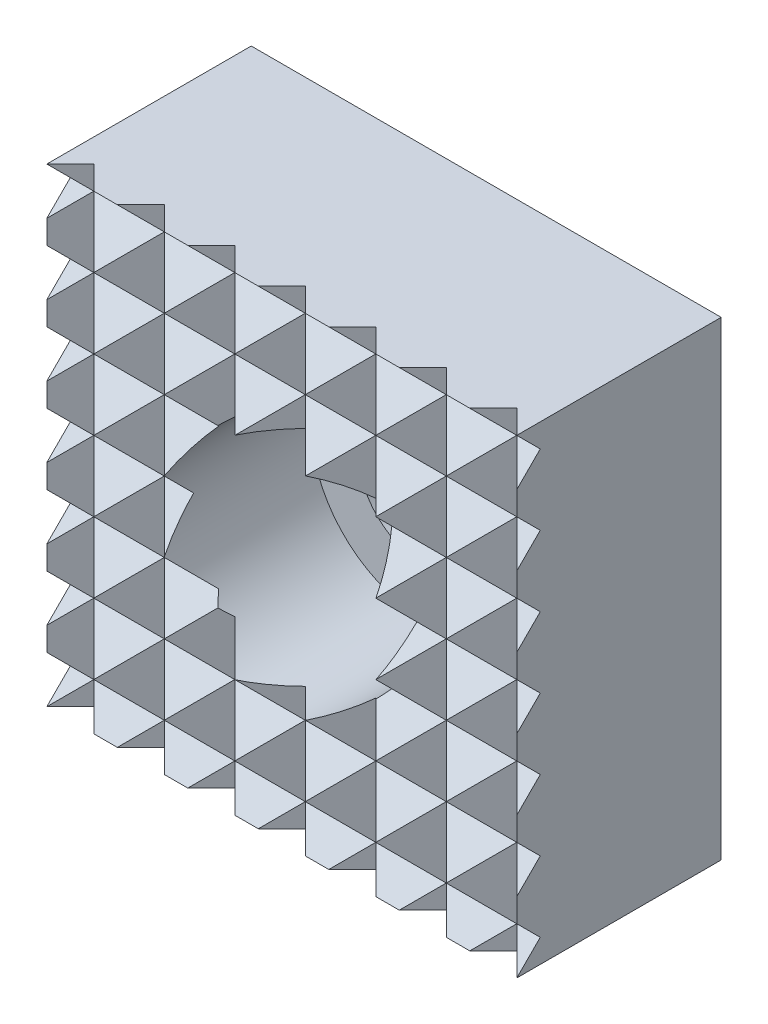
ISO-10303-21;
HEADER;
FILE_DESCRIPTION(('STEP AP214'),'2;1');
FILE_NAME('part.step','',(''),(''),'','','');
FILE_SCHEMA(('AUTOMOTIVE_DESIGN { 1 0 10303 214 1 1 1 1 }'));
ENDSEC;
DATA;
#1=APPLICATION_CONTEXT('core data for automotive mechanical design processes');
#2=APPLICATION_PROTOCOL_DEFINITION('international standard','automotive_design',2000,#1);
#3=PRODUCT_CONTEXT('',#1,'mechanical');
#4=PRODUCT('Part','Part','',(#3));
#5=PRODUCT_RELATED_PRODUCT_CATEGORY('part','',(#4));
#6=PRODUCT_DEFINITION_FORMATION('','',#4);
#7=PRODUCT_DEFINITION_CONTEXT('part definition',#1,'design');
#8=PRODUCT_DEFINITION('design','',#6,#7);
#9=PRODUCT_DEFINITION_SHAPE('','',#8);
#10=(LENGTH_UNIT() NAMED_UNIT(*) SI_UNIT(.MILLI.,.METRE.));
#11=(NAMED_UNIT(*) PLANE_ANGLE_UNIT() SI_UNIT($,.RADIAN.));
#12=(NAMED_UNIT(*) SI_UNIT($,.STERADIAN.) SOLID_ANGLE_UNIT());
#13=UNCERTAINTY_MEASURE_WITH_UNIT(LENGTH_MEASURE(1.E-05),#10,'distance_accuracy_value','');
#14=(GEOMETRIC_REPRESENTATION_CONTEXT(3) GLOBAL_UNCERTAINTY_ASSIGNED_CONTEXT((#13)) GLOBAL_UNIT_ASSIGNED_CONTEXT((#10,
#11,#12)) REPRESENTATION_CONTEXT('',''));
#15=CARTESIAN_POINT('',(0.,0.,0.));
#16=DIRECTION('',(0.,0.,1.));
#17=DIRECTION('',(1.,0.,0.));
#18=AXIS2_PLACEMENT_3D('',#15,#16,#17);
#19=CARTESIAN_POINT('',(-15.,-6.,8.5));
#20=DIRECTION('',(0.,-0.707106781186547,-0.707106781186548));
#21=DIRECTION('',(0.,0.707106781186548,-0.707106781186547));
#22=AXIS2_PLACEMENT_3D('',#19,#20,#21);
#23=PLANE('',#22);
#24=DIRECTION('',(1.,0.,0.));
#25=VECTOR('',#24,1.);
#26=CARTESIAN_POINT('',(-15.,-6.,8.5));
#27=LINE('',#26,#25);
#28=CARTESIAN_POINT('',(9.,-6.,8.5));
#29=VERTEX_POINT('',#28);
#30=CARTESIAN_POINT('',(10.,-6.,8.5));
#31=VERTEX_POINT('',#30);
#32=EDGE_CURVE('E1129',#29,#31,#27,.T.);
#33=ORIENTED_EDGE('',*,*,#32,.F.);
#34=DIRECTION('',(0.577350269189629,-0.577350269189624,0.577350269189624));
#35=VECTOR('',#34,1.);
#36=CARTESIAN_POINT('',(0.999999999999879,2.,0.499999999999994));
#37=LINE('',#36,#35);
#38=CARTESIAN_POINT('',(10.,-7.,9.5));
#39=VERTEX_POINT('',#38);
#40=EDGE_CURVE('E1439',#29,#39,#37,.T.);
#41=ORIENTED_EDGE('',*,*,#40,.T.);
#42=DIRECTION('',(0.,-0.707106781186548,0.707106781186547));
#43=VECTOR('',#42,1.);
#44=CARTESIAN_POINT('',(10.,-8.75,11.25));
#45=LINE('',#44,#43);
#46=EDGE_CURVE('E1300',#31,#39,#45,.T.);
#47=ORIENTED_EDGE('',*,*,#46,.F.);
#48=EDGE_LOOP('',(#33,#41,#47));
#49=FACE_BOUND('',#48,.T.);
#50=ADVANCED_FACE('F15',(#49),#23,.F.);
#51=DIRECTION('',(0.577350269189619,-0.577350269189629,0.577350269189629));
#52=VECTOR('',#51,1.);
#53=CARTESIAN_POINT('',(-4.99999999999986,-1.00000000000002,3.5));
#54=LINE('',#53,#52);
#55=CARTESIAN_POINT('',(0.,-6.,8.5));
#56=VERTEX_POINT('',#55);
#57=CARTESIAN_POINT('',(1.5,-7.5,10.));
#58=VERTEX_POINT('',#57);
#59=EDGE_CURVE('E1042',#56,#58,#54,.T.);
#60=ORIENTED_EDGE('',*,*,#59,.T.);
#61=DIRECTION('',(0.577350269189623,0.577350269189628,-0.577350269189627));
#62=VECTOR('',#61,1.);
#63=CARTESIAN_POINT('',(-2.99999999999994,-12.,14.5));
#64=LINE('',#63,#62);
#65=CARTESIAN_POINT('',(3.,-6.,8.5));
#66=VERTEX_POINT('',#65);
#67=EDGE_CURVE('E30',#58,#66,#64,.T.);
#68=ORIENTED_EDGE('',*,*,#67,.T.);
#69=EDGE_CURVE('E2007',#56,#66,#27,.T.);
#70=ORIENTED_EDGE('',*,*,#69,.F.);
#71=EDGE_LOOP('',(#60,#68,#70));
#72=FACE_BOUND('',#71,.T.);
#73=ADVANCED_FACE('F1755',(#72),#23,.F.);
#74=DIRECTION('',(0.,0.707106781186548,-0.707106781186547));
#75=VECTOR('',#74,1.);
#76=CARTESIAN_POINT('',(-10.,1.25,1.25));
#77=LINE('',#76,#75);
#78=CARTESIAN_POINT('',(-10.,-7.,9.5));
#79=VERTEX_POINT('',#78);
#80=CARTESIAN_POINT('',(-10.,-6.,8.5));
#81=VERTEX_POINT('',#80);
#82=EDGE_CURVE('E1212',#79,#81,#77,.T.);
#83=ORIENTED_EDGE('',*,*,#82,.F.);
#84=DIRECTION('',(0.577350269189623,0.577350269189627,-0.577350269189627));
#85=VECTOR('',#84,1.);
#86=CARTESIAN_POINT('',(-11.,-8.,10.5));
#87=LINE('',#86,#85);
#88=CARTESIAN_POINT('',(-9.,-6.,8.5));
#89=VERTEX_POINT('',#88);
#90=EDGE_CURVE('E986',#79,#89,#87,.T.);
#91=ORIENTED_EDGE('',*,*,#90,.T.);
#92=EDGE_CURVE('E1124',#81,#89,#27,.T.);
#93=ORIENTED_EDGE('',*,*,#92,.F.);
#94=EDGE_LOOP('',(#83,#91,#93));
#95=FACE_BOUND('',#94,.T.);
#96=ADVANCED_FACE('F1762',(#95),#23,.F.);
#97=DIRECTION('',(0.577350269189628,-0.577350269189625,0.577350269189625));
#98=VECTOR('',#97,1.);
#99=CARTESIAN_POINT('',(-7.,-2.,4.5));
#100=LINE('',#99,#98);
#101=CARTESIAN_POINT('',(-3.,-6.,8.5));
#102=VERTEX_POINT('',#101);
#103=CARTESIAN_POINT('',(-1.49999999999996,-7.5,10.));
#104=VERTEX_POINT('',#103);
#105=EDGE_CURVE('E1100',#102,#104,#100,.T.);
#106=ORIENTED_EDGE('',*,*,#105,.T.);
#107=DIRECTION('',(0.577350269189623,0.577350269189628,-0.577350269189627));
#108=VECTOR('',#107,1.);
#109=CARTESIAN_POINT('',(-4.99999999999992,-11.,13.5));
#110=LINE('',#109,#108);
#111=EDGE_CURVE('E1071',#104,#56,#110,.T.);
#112=ORIENTED_EDGE('',*,*,#111,.T.);
#113=EDGE_CURVE('E2022',#102,#56,#27,.T.);
#114=ORIENTED_EDGE('',*,*,#113,.F.);
#115=EDGE_LOOP('',(#106,#112,#114));
#116=FACE_BOUND('',#115,.T.);
#117=ADVANCED_FACE('F1773',(#116),#23,.F.);
#118=CARTESIAN_POINT('',(-15.,-7.5,10.));
#119=DIRECTION('',(0.,0.707106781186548,-0.707106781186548));
#120=DIRECTION('',(0.,0.707106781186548,0.707106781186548));
#121=AXIS2_PLACEMENT_3D('',#118,#119,#120);
#122=PLANE('',#121);
#123=DIRECTION('',(0.,-0.707106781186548,-0.707106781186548));
#124=VECTOR('',#123,1.);
#125=CARTESIAN_POINT('',(10.,-8.75,8.75));
#126=LINE('',#125,#124);
#127=CARTESIAN_POINT('',(10.,-8.,9.5));
#128=VERTEX_POINT('',#127);
#129=CARTESIAN_POINT('',(10.,-9.,8.5));
#130=VERTEX_POINT('',#129);
#131=EDGE_CURVE('E1303',#128,#130,#126,.T.);
#132=ORIENTED_EDGE('',*,*,#131,.F.);
#133=DIRECTION('',(-0.577350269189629,-0.577350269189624,-0.577350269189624));
#134=VECTOR('',#133,1.);
#135=CARTESIAN_POINT('',(1.99999999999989,-16.,1.49999999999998));
#136=LINE('',#135,#134);
#137=CARTESIAN_POINT('',(9.,-9.,8.5));
#138=VERTEX_POINT('',#137);
#139=EDGE_CURVE('E619',#128,#138,#136,.T.);
#140=ORIENTED_EDGE('',*,*,#139,.T.);
#141=DIRECTION('',(1.,0.,0.));
#142=VECTOR('',#141,1.);
#143=CARTESIAN_POINT('',(-15.,-9.,8.5));
#144=LINE('',#143,#142);
#145=EDGE_CURVE('E1134',#138,#130,#144,.T.);
#146=ORIENTED_EDGE('',*,*,#145,.T.);
#147=EDGE_LOOP('',(#132,#140,#146));
#148=FACE_BOUND('',#147,.T.);
#149=ADVANCED_FACE('F1782',(#148),#122,.F.);
#150=CARTESIAN_POINT('',(6.,-9.,8.5));
#151=VERTEX_POINT('',#150);
#152=EDGE_CURVE('E1550',#151,#138,#144,.T.);
#153=ORIENTED_EDGE('',*,*,#152,.T.);
#154=DIRECTION('',(-0.577350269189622,0.577350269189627,0.577350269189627));
#155=VECTOR('',#154,1.);
#156=CARTESIAN_POINT('',(0.,0.,17.5));
#157=LINE('',#156,#155);
#158=CARTESIAN_POINT('',(7.5,-7.5,10.));
#159=VERTEX_POINT('',#158);
#160=EDGE_CURVE('E654',#138,#159,#157,.T.);
#161=ORIENTED_EDGE('',*,*,#160,.T.);
#162=DIRECTION('',(-0.577350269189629,-0.577350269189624,-0.577350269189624));
#163=VECTOR('',#162,1.);
#164=CARTESIAN_POINT('',(0.,-15.,2.5));
#165=LINE('',#164,#163);
#166=EDGE_CURVE('E692',#159,#151,#165,.T.);
#167=ORIENTED_EDGE('',*,*,#166,.T.);
#168=EDGE_LOOP('',(#153,#161,#167));
#169=FACE_BOUND('',#168,.T.);
#170=ADVANCED_FACE('F1549',(#169),#122,.F.);
#171=CARTESIAN_POINT('',(3.,-9.,8.5));
#172=VERTEX_POINT('',#171);
#173=EDGE_CURVE('E1552',#172,#151,#144,.T.);
#174=ORIENTED_EDGE('',*,*,#173,.T.);
#175=DIRECTION('',(-0.577350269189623,0.577350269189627,0.577350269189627));
#176=VECTOR('',#175,1.);
#177=CARTESIAN_POINT('',(-1.99999999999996,-1.00000000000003,16.5));
#178=LINE('',#177,#176);
#179=CARTESIAN_POINT('',(4.5,-7.5,10.));
#180=VERTEX_POINT('',#179);
#181=EDGE_CURVE('E737',#151,#180,#178,.T.);
#182=ORIENTED_EDGE('',*,*,#181,.T.);
#183=DIRECTION('',(-0.57735026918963,-0.577350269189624,-0.577350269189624));
#184=VECTOR('',#183,1.);
#185=CARTESIAN_POINT('',(-2.00000000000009,-14.,3.5));
#186=LINE('',#185,#184);
#187=EDGE_CURVE('E771',#180,#172,#186,.T.);
#188=ORIENTED_EDGE('',*,*,#187,.T.);
#189=EDGE_LOOP('',(#174,#182,#188));
#190=FACE_BOUND('',#189,.T.);
#191=ADVANCED_FACE('F1903',(#190),#122,.F.);
#192=CARTESIAN_POINT('',(0.,-9.,8.5));
#193=VERTEX_POINT('',#192);
#194=EDGE_CURVE('E1895',#193,#172,#144,.T.);
#195=ORIENTED_EDGE('',*,*,#194,.T.);
#196=DIRECTION('',(-0.577350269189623,0.577350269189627,0.577350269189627));
#197=VECTOR('',#196,1.);
#198=CARTESIAN_POINT('',(-3.99999999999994,-2.,15.5));
#199=LINE('',#198,#197);
#200=EDGE_CURVE('E1016',#172,#58,#199,.T.);
#201=ORIENTED_EDGE('',*,*,#200,.T.);
#202=DIRECTION('',(-0.577350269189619,-0.577350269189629,-0.577350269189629));
#203=VECTOR('',#202,1.);
#204=CARTESIAN_POINT('',(-3.99999999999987,-13.,4.5));
#205=LINE('',#204,#203);
#206=EDGE_CURVE('E1045',#58,#193,#205,.T.);
#207=ORIENTED_EDGE('',*,*,#206,.T.);
#208=EDGE_LOOP('',(#195,#201,#207));
#209=FACE_BOUND('',#208,.T.);
#210=ADVANCED_FACE('F2067',(#209),#122,.F.);
#211=CARTESIAN_POINT('',(-10.,-9.,8.5));
#212=VERTEX_POINT('',#211);
#213=CARTESIAN_POINT('',(-9.,-9.,8.5));
#214=VERTEX_POINT('',#213);
#215=EDGE_CURVE('E1130',#212,#214,#144,.T.);
#216=ORIENTED_EDGE('',*,*,#215,.T.);
#217=DIRECTION('',(-0.577350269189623,0.577350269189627,0.577350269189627));
#218=VECTOR('',#217,1.);
#219=CARTESIAN_POINT('',(-12.,-6.,11.5));
#220=LINE('',#219,#218);
#221=CARTESIAN_POINT('',(-10.,-8.,9.5));
#222=VERTEX_POINT('',#221);
#223=EDGE_CURVE('E989',#214,#222,#220,.T.);
#224=ORIENTED_EDGE('',*,*,#223,.T.);
#225=DIRECTION('',(0.,0.707106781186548,0.707106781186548));
#226=VECTOR('',#225,1.);
#227=CARTESIAN_POINT('',(-10.,1.25,18.75));
#228=LINE('',#227,#226);
#229=EDGE_CURVE('E1209',#212,#222,#228,.T.);
#230=ORIENTED_EDGE('',*,*,#229,.F.);
#231=EDGE_LOOP('',(#216,#224,#230));
#232=FACE_BOUND('',#231,.T.);
#233=ADVANCED_FACE('F1879',(#232),#122,.F.);
#234=DIRECTION('',(-0.577350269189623,0.577350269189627,0.577350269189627));
#235=VECTOR('',#234,1.);
#236=CARTESIAN_POINT('',(-10.,-5.,12.5));
#237=LINE('',#236,#235);
#238=CARTESIAN_POINT('',(-6.,-9.,8.5));
#239=VERTEX_POINT('',#238);
#240=CARTESIAN_POINT('',(-7.5,-7.5,10.));
#241=VERTEX_POINT('',#240);
#242=EDGE_CURVE('E895',#239,#241,#237,.T.);
#243=ORIENTED_EDGE('',*,*,#242,.T.);
#244=DIRECTION('',(-0.577350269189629,-0.577350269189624,-0.577350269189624));
#245=VECTOR('',#244,1.);
#246=CARTESIAN_POINT('',(-10.,-10.,7.5));
#247=LINE('',#246,#245);
#248=EDGE_CURVE('E938',#241,#214,#247,.T.);
#249=ORIENTED_EDGE('',*,*,#248,.T.);
#250=EDGE_CURVE('E1133',#214,#239,#144,.T.);
#251=ORIENTED_EDGE('',*,*,#250,.T.);
#252=EDGE_LOOP('',(#243,#249,#251));
#253=FACE_BOUND('',#252,.T.);
#254=ADVANCED_FACE('F1886',(#253),#122,.F.);
#255=CARTESIAN_POINT('',(-3.,-9.,8.5));
#256=VERTEX_POINT('',#255);
#257=EDGE_CURVE('E1891',#256,#193,#144,.T.);
#258=ORIENTED_EDGE('',*,*,#257,.T.);
#259=DIRECTION('',(-0.577350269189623,0.577350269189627,0.577350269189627));
#260=VECTOR('',#259,1.);
#261=CARTESIAN_POINT('',(-5.99999999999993,-3.,14.5));
#262=LINE('',#261,#260);
#263=EDGE_CURVE('E1074',#193,#104,#262,.T.);
#264=ORIENTED_EDGE('',*,*,#263,.T.);
#265=DIRECTION('',(-0.577350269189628,-0.577350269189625,-0.577350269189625));
#266=VECTOR('',#265,1.);
#267=CARTESIAN_POINT('',(-6.,-12.,5.5));
#268=LINE('',#267,#266);
#269=EDGE_CURVE('E1103',#104,#256,#268,.T.);
#270=ORIENTED_EDGE('',*,*,#269,.T.);
#271=EDGE_LOOP('',(#258,#264,#270));
#272=FACE_BOUND('',#271,.T.);
#273=ADVANCED_FACE('F2045',(#272),#122,.F.);
#274=CARTESIAN_POINT('',(-15.,-9.,8.5));
#275=DIRECTION('',(0.,-0.707106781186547,-0.707106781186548));
#276=DIRECTION('',(0.,0.707106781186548,-0.707106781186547));
#277=AXIS2_PLACEMENT_3D('',#274,#275,#276);
#278=PLANE('',#277);
#279=DIRECTION('',(1.,0.,0.));
#280=VECTOR('',#279,1.);
#281=CARTESIAN_POINT('',(10.,-10.,9.5));
#282=LINE('',#281,#280);
#283=CARTESIAN_POINT('',(-1.99999999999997,-10.,9.5));
#284=VERTEX_POINT('',#283);
#285=CARTESIAN_POINT('',(-0.999999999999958,-10.,9.5));
#286=VERTEX_POINT('',#285);
#287=EDGE_CURVE('E3673',#284,#286,#282,.T.);
#288=ORIENTED_EDGE('',*,*,#287,.T.);
#289=DIRECTION('',(0.577350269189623,0.577350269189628,-0.577350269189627));
#290=VECTOR('',#289,1.);
#291=CARTESIAN_POINT('',(-4.99999999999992,-14.,13.5));
#292=LINE('',#291,#290);
#293=EDGE_CURVE('E1077',#286,#193,#292,.T.);
#294=ORIENTED_EDGE('',*,*,#293,.T.);
#295=ORIENTED_EDGE('',*,*,#257,.F.);
#296=DIRECTION('',(0.577350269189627,-0.577350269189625,0.577350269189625));
#297=VECTOR('',#296,1.);
#298=CARTESIAN_POINT('',(-7.,-5.,4.5));
#299=LINE('',#298,#297);
#300=EDGE_CURVE('E1106',#256,#284,#299,.T.);
#301=ORIENTED_EDGE('',*,*,#300,.T.);
#302=EDGE_LOOP('',(#288,#294,#295,#301));
#303=FACE_BOUND('',#302,.T.);
#304=ADVANCED_FACE('F2052',(#303),#278,.F.);
#305=ORIENTED_EDGE('',*,*,#194,.F.);
#306=DIRECTION('',(0.577350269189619,-0.57735026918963,0.577350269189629));
#307=VECTOR('',#306,1.);
#308=CARTESIAN_POINT('',(-4.99999999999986,-4.,3.5));
#309=LINE('',#308,#307);
#310=CARTESIAN_POINT('',(1.00000000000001,-10.,9.5));
#311=VERTEX_POINT('',#310);
#312=EDGE_CURVE('E1048',#193,#311,#309,.T.);
#313=ORIENTED_EDGE('',*,*,#312,.T.);
#314=CARTESIAN_POINT('',(2.,-10.,9.5));
#315=VERTEX_POINT('',#314);
#316=EDGE_CURVE('E3676',#311,#315,#282,.T.);
#317=ORIENTED_EDGE('',*,*,#316,.T.);
#318=DIRECTION('',(0.577350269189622,0.577350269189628,-0.577350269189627));
#319=VECTOR('',#318,1.);
#320=CARTESIAN_POINT('',(-2.99999999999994,-15.,14.5));
#321=LINE('',#320,#319);
#322=EDGE_CURVE('E1019',#315,#172,#321,.T.);
#323=ORIENTED_EDGE('',*,*,#322,.T.);
#324=EDGE_LOOP('',(#305,#313,#317,#323));
#325=FACE_BOUND('',#324,.T.);
#326=ADVANCED_FACE('F2062',(#325),#278,.F.);
#327=ORIENTED_EDGE('',*,*,#173,.F.);
#328=DIRECTION('',(0.577350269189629,-0.577350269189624,0.577350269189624));
#329=VECTOR('',#328,1.);
#330=CARTESIAN_POINT('',(-3.00000000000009,-3.,2.5));
#331=LINE('',#330,#329);
#332=CARTESIAN_POINT('',(4.,-10.,9.5));
#333=VERTEX_POINT('',#332);
#334=EDGE_CURVE('E774',#172,#333,#331,.T.);
#335=ORIENTED_EDGE('',*,*,#334,.T.);
#336=CARTESIAN_POINT('',(5.,-10.,9.5));
#337=VERTEX_POINT('',#336);
#338=EDGE_CURVE('E1204',#333,#337,#282,.T.);
#339=ORIENTED_EDGE('',*,*,#338,.T.);
#340=DIRECTION('',(0.577350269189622,0.577350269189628,-0.577350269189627));
#341=VECTOR('',#340,1.);
#342=CARTESIAN_POINT('',(-0.999999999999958,-16.,15.5));
#343=LINE('',#342,#341);
#344=EDGE_CURVE('E740',#337,#151,#343,.T.);
#345=ORIENTED_EDGE('',*,*,#344,.T.);
#346=EDGE_LOOP('',(#327,#335,#339,#345));
#347=FACE_BOUND('',#346,.T.);
#348=ADVANCED_FACE('F1905',(#347),#278,.F.);
#349=ORIENTED_EDGE('',*,*,#152,.F.);
#350=DIRECTION('',(0.577350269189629,-0.577350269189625,0.577350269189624));
#351=VECTOR('',#350,1.);
#352=CARTESIAN_POINT('',(-1.00000000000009,-2.,1.5));
#353=LINE('',#352,#351);
#354=CARTESIAN_POINT('',(7.,-10.,9.5));
#355=VERTEX_POINT('',#354);
#356=EDGE_CURVE('E695',#151,#355,#353,.T.);
#357=ORIENTED_EDGE('',*,*,#356,.T.);
#358=CARTESIAN_POINT('',(8.,-10.,9.5));
#359=VERTEX_POINT('',#358);
#360=EDGE_CURVE('E1202',#355,#359,#282,.T.);
#361=ORIENTED_EDGE('',*,*,#360,.T.);
#362=DIRECTION('',(0.577350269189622,0.577350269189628,-0.577350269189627));
#363=VECTOR('',#362,1.);
#364=CARTESIAN_POINT('',(1.00000000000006,-17.,16.5));
#365=LINE('',#364,#363);
#366=EDGE_CURVE('E592',#359,#138,#365,.T.);
#367=ORIENTED_EDGE('',*,*,#366,.T.);
#368=EDGE_LOOP('',(#349,#357,#361,#367));
#369=FACE_BOUND('',#368,.T.);
#370=ADVANCED_FACE('F1553',(#369),#278,.F.);
#371=DIRECTION('',(0.,0.707106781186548,-0.707106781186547));
#372=VECTOR('',#371,1.);
#373=CARTESIAN_POINT('',(-10.,-0.249999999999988,-0.25));
#374=LINE('',#373,#372);
#375=CARTESIAN_POINT('',(-10.,-10.,9.5));
#376=VERTEX_POINT('',#375);
#377=EDGE_CURVE('E1206',#376,#212,#374,.T.);
#378=ORIENTED_EDGE('',*,*,#377,.F.);
#379=DIRECTION('',(0.577350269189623,0.577350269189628,-0.577350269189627));
#380=VECTOR('',#379,1.);
#381=CARTESIAN_POINT('',(-11.,-11.,10.5));
#382=LINE('',#381,#380);
#383=EDGE_CURVE('E992',#376,#214,#382,.T.);
#384=ORIENTED_EDGE('',*,*,#383,.T.);
#385=ORIENTED_EDGE('',*,*,#215,.F.);
#386=EDGE_LOOP('',(#378,#384,#385));
#387=FACE_BOUND('',#386,.T.);
#388=ADVANCED_FACE('F1882',(#387),#278,.F.);
#389=ORIENTED_EDGE('',*,*,#250,.F.);
#390=DIRECTION('',(0.577350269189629,-0.577350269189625,0.577350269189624));
#391=VECTOR('',#390,1.);
#392=CARTESIAN_POINT('',(-11.,-7.,6.5));
#393=LINE('',#392,#391);
#394=CARTESIAN_POINT('',(-8.,-10.,9.5));
#395=VERTEX_POINT('',#394);
#396=EDGE_CURVE('E941',#214,#395,#393,.T.);
#397=ORIENTED_EDGE('',*,*,#396,.T.);
#398=CARTESIAN_POINT('',(-7.,-10.,9.5));
#399=VERTEX_POINT('',#398);
#400=EDGE_CURVE('E1205',#395,#399,#282,.T.);
#401=ORIENTED_EDGE('',*,*,#400,.T.);
#402=DIRECTION('',(0.577350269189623,0.577350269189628,-0.577350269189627));
#403=VECTOR('',#402,1.);
#404=CARTESIAN_POINT('',(-9.,-12.,11.5));
#405=LINE('',#404,#403);
#406=EDGE_CURVE('E898',#399,#239,#405,.T.);
#407=ORIENTED_EDGE('',*,*,#406,.T.);
#408=EDGE_LOOP('',(#389,#397,#401,#407));
#409=FACE_BOUND('',#408,.T.);
#410=ADVANCED_FACE('F1888',(#409),#278,.F.);
#411=ORIENTED_EDGE('',*,*,#145,.F.);
#412=DIRECTION('',(0.577350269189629,-0.577350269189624,0.577350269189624));
#413=VECTOR('',#412,1.);
#414=CARTESIAN_POINT('',(0.999999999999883,-0.999999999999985,0.5));
#415=LINE('',#414,#413);
#416=CARTESIAN_POINT('',(10.,-10.,9.5));
#417=VERTEX_POINT('',#416);
#418=EDGE_CURVE('E603',#138,#417,#415,.T.);
#419=ORIENTED_EDGE('',*,*,#418,.T.);
#420=DIRECTION('',(0.,-0.707106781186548,0.707106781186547));
#421=VECTOR('',#420,1.);
#422=CARTESIAN_POINT('',(10.,-10.25,9.75));
#423=LINE('',#422,#421);
#424=EDGE_CURVE('E1305',#130,#417,#423,.T.);
#425=ORIENTED_EDGE('',*,*,#424,.F.);
#426=EDGE_LOOP('',(#411,#419,#425));
#427=FACE_BOUND('',#426,.T.);
#428=ADVANCED_FACE('F2053',(#427),#278,.F.);
#429=CARTESIAN_POINT('',(-15.,9.,8.5));
#430=DIRECTION('',(0.,-0.707106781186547,-0.707106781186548));
#431=DIRECTION('',(0.,0.707106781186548,-0.707106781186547));
#432=AXIS2_PLACEMENT_3D('',#429,#430,#431);
#433=PLANE('',#432);
#434=DIRECTION('',(1.,0.,0.));
#435=VECTOR('',#434,1.);
#436=CARTESIAN_POINT('',(-15.,9.,8.5));
#437=LINE('',#436,#435);
#438=CARTESIAN_POINT('',(9.,9.,8.5));
#439=VERTEX_POINT('',#438);
#440=CARTESIAN_POINT('',(10.,9.,8.5));
#441=VERTEX_POINT('',#440);
#442=EDGE_CURVE('E1139',#439,#441,#437,.T.);
#443=ORIENTED_EDGE('',*,*,#442,.F.);
#444=DIRECTION('',(0.577350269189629,-0.577350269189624,0.577350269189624));
#445=VECTOR('',#444,1.);
#446=CARTESIAN_POINT('',(0.999999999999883,17.,0.5));
#447=LINE('',#446,#445);
#448=CARTESIAN_POINT('',(10.,8.,9.5));
#449=VERTEX_POINT('',#448);
#450=EDGE_CURVE('E1420',#439,#449,#447,.T.);
#451=ORIENTED_EDGE('',*,*,#450,.T.);
#452=DIRECTION('',(0.,-0.707106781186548,0.707106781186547));
#453=VECTOR('',#452,1.);
#454=CARTESIAN_POINT('',(10.,-1.25,18.75));
#455=LINE('',#454,#453);
#456=EDGE_CURVE('E1297',#441,#449,#455,.T.);
#457=ORIENTED_EDGE('',*,*,#456,.F.);
#458=EDGE_LOOP('',(#443,#451,#457));
#459=FACE_BOUND('',#458,.T.);
#460=ADVANCED_FACE('F3021',(#459),#433,.F.);
#461=DIRECTION('',(0.577350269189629,-0.577350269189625,0.577350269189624));
#462=VECTOR('',#461,1.);
#463=CARTESIAN_POINT('',(-1.00000000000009,16.,1.5));
#464=LINE('',#463,#462);
#465=CARTESIAN_POINT('',(6.,9.,8.5));
#466=VERTEX_POINT('',#465);
#467=CARTESIAN_POINT('',(7.5,7.5,10.));
#468=VERTEX_POINT('',#467);
#469=EDGE_CURVE('E666',#466,#468,#464,.T.);
#470=ORIENTED_EDGE('',*,*,#469,.T.);
#471=DIRECTION('',(0.577350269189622,0.577350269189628,-0.577350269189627));
#472=VECTOR('',#471,1.);
#473=CARTESIAN_POINT('',(1.00000000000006,1.00000000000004,16.5));
#474=LINE('',#473,#472);
#475=EDGE_CURVE('E628',#468,#439,#474,.T.);
#476=ORIENTED_EDGE('',*,*,#475,.T.);
#477=EDGE_CURVE('E1591',#466,#439,#437,.T.);
#478=ORIENTED_EDGE('',*,*,#477,.F.);
#479=EDGE_LOOP('',(#470,#476,#478));
#480=FACE_BOUND('',#479,.T.);
#481=ADVANCED_FACE('F1592',(#480),#433,.F.);
#482=DIRECTION('',(0.577350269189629,-0.577350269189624,0.577350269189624));
#483=VECTOR('',#482,1.);
#484=CARTESIAN_POINT('',(-3.00000000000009,15.,2.5));
#485=LINE('',#484,#483);
#486=CARTESIAN_POINT('',(3.,9.,8.5));
#487=VERTEX_POINT('',#486);
#488=CARTESIAN_POINT('',(4.5,7.5,10.));
#489=VERTEX_POINT('',#488);
#490=EDGE_CURVE('E751',#487,#489,#485,.T.);
#491=ORIENTED_EDGE('',*,*,#490,.T.);
#492=DIRECTION('',(0.577350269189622,0.577350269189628,-0.577350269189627));
#493=VECTOR('',#492,1.);
#494=CARTESIAN_POINT('',(-0.999999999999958,2.00000000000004,15.5));
#495=LINE('',#494,#493);
#496=EDGE_CURVE('E709',#489,#466,#495,.T.);
#497=ORIENTED_EDGE('',*,*,#496,.T.);
#498=EDGE_CURVE('E1595',#487,#466,#437,.T.);
#499=ORIENTED_EDGE('',*,*,#498,.F.);
#500=EDGE_LOOP('',(#491,#497,#499));
#501=FACE_BOUND('',#500,.T.);
#502=ADVANCED_FACE('F1604',(#501),#433,.F.);
#503=DIRECTION('',(0.577350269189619,-0.57735026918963,0.577350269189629));
#504=VECTOR('',#503,1.);
#505=CARTESIAN_POINT('',(-4.99999999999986,14.,3.5));
#506=LINE('',#505,#504);
#507=CARTESIAN_POINT('',(0.,9.,8.5));
#508=VERTEX_POINT('',#507);
#509=CARTESIAN_POINT('',(1.5,7.5,10.));
#510=VERTEX_POINT('',#509);
#511=EDGE_CURVE('E1027',#508,#510,#506,.T.);
#512=ORIENTED_EDGE('',*,*,#511,.T.);
#513=DIRECTION('',(0.577350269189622,0.577350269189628,-0.577350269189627));
#514=VECTOR('',#513,1.);
#515=CARTESIAN_POINT('',(-2.99999999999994,3.,14.5));
#516=LINE('',#515,#514);
#517=EDGE_CURVE('E1000',#510,#487,#516,.T.);
#518=ORIENTED_EDGE('',*,*,#517,.T.);
#519=EDGE_CURVE('E1611',#508,#487,#437,.T.);
#520=ORIENTED_EDGE('',*,*,#519,.F.);
#521=EDGE_LOOP('',(#512,#518,#520));
#522=FACE_BOUND('',#521,.T.);
#523=ADVANCED_FACE('F1697',(#522),#433,.F.);
#524=DIRECTION('',(0.,0.707106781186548,-0.707106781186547));
#525=VECTOR('',#524,1.);
#526=CARTESIAN_POINT('',(-10.,8.75,8.75));
#527=LINE('',#526,#525);
#528=CARTESIAN_POINT('',(-10.,8.,9.5));
#529=VERTEX_POINT('',#528);
#530=CARTESIAN_POINT('',(-10.,9.,8.5));
#531=VERTEX_POINT('',#530);
#532=EDGE_CURVE('E1200',#529,#531,#527,.T.);
#533=ORIENTED_EDGE('',*,*,#532,.F.);
#534=DIRECTION('',(0.577350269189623,0.577350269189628,-0.577350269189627));
#535=VECTOR('',#534,1.);
#536=CARTESIAN_POINT('',(-11.,7.,10.5));
#537=LINE('',#536,#535);
#538=CARTESIAN_POINT('',(-9.,9.,8.5));
#539=VERTEX_POINT('',#538);
#540=EDGE_CURVE('E967',#529,#539,#537,.T.);
#541=ORIENTED_EDGE('',*,*,#540,.T.);
#542=EDGE_CURVE('E1135',#531,#539,#437,.T.);
#543=ORIENTED_EDGE('',*,*,#542,.F.);
#544=EDGE_LOOP('',(#533,#541,#543));
#545=FACE_BOUND('',#544,.T.);
#546=ADVANCED_FACE('F3163',(#545),#433,.F.);
#547=CARTESIAN_POINT('',(-6.,9.,8.5));
#548=VERTEX_POINT('',#547);
#549=EDGE_CURVE('E1138',#539,#548,#437,.T.);
#550=ORIENTED_EDGE('',*,*,#549,.F.);
#551=DIRECTION('',(0.577350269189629,-0.577350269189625,0.577350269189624));
#552=VECTOR('',#551,1.);
#553=CARTESIAN_POINT('',(-11.,11.,6.5));
#554=LINE('',#553,#552);
#555=CARTESIAN_POINT('',(-7.5,7.5,10.));
#556=VERTEX_POINT('',#555);
#557=EDGE_CURVE('E912',#539,#556,#554,.T.);
#558=ORIENTED_EDGE('',*,*,#557,.T.);
#559=DIRECTION('',(0.577350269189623,0.577350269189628,-0.577350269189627));
#560=VECTOR('',#559,1.);
#561=CARTESIAN_POINT('',(-9.,6.,11.5));
#562=LINE('',#561,#560);
#563=EDGE_CURVE('E869',#556,#548,#562,.T.);
#564=ORIENTED_EDGE('',*,*,#563,.T.);
#565=EDGE_LOOP('',(#550,#558,#564));
#566=FACE_BOUND('',#565,.T.);
#567=ADVANCED_FACE('F1630',(#566),#433,.F.);
#568=DIRECTION('',(0.577350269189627,-0.577350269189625,0.577350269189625));
#569=VECTOR('',#568,1.);
#570=CARTESIAN_POINT('',(-7.,13.,4.5));
#571=LINE('',#570,#569);
#572=CARTESIAN_POINT('',(-3.,9.,8.5));
#573=VERTEX_POINT('',#572);
#574=CARTESIAN_POINT('',(-1.49999999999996,7.5,10.));
#575=VERTEX_POINT('',#574);
#576=EDGE_CURVE('E1085',#573,#575,#571,.T.);
#577=ORIENTED_EDGE('',*,*,#576,.T.);
#578=DIRECTION('',(0.577350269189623,0.577350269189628,-0.577350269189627));
#579=VECTOR('',#578,1.);
#580=CARTESIAN_POINT('',(-4.99999999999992,4.,13.5));
#581=LINE('',#580,#579);
#582=EDGE_CURVE('E1056',#575,#508,#581,.T.);
#583=ORIENTED_EDGE('',*,*,#582,.T.);
#584=EDGE_CURVE('E1613',#573,#508,#437,.T.);
#585=ORIENTED_EDGE('',*,*,#584,.F.);
#586=EDGE_LOOP('',(#577,#583,#585));
#587=FACE_BOUND('',#586,.T.);
#588=ADVANCED_FACE('F1672',(#587),#433,.F.);
#589=CARTESIAN_POINT('',(-15.,7.5,10.));
#590=DIRECTION('',(0.,0.707106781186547,-0.707106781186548));
#591=DIRECTION('',(0.,0.707106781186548,0.707106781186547));
#592=AXIS2_PLACEMENT_3D('',#589,#590,#591);
#593=PLANE('',#592);
#594=DIRECTION('',(0.,-0.707106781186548,-0.707106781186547));
#595=VECTOR('',#594,1.);
#596=CARTESIAN_POINT('',(10.,-1.25,1.25));
#597=LINE('',#596,#595);
#598=CARTESIAN_POINT('',(10.,7.,9.5));
#599=VERTEX_POINT('',#598);
#600=CARTESIAN_POINT('',(10.,6.,8.5));
#601=VERTEX_POINT('',#600);
#602=EDGE_CURVE('E1295',#599,#601,#597,.T.);
#603=ORIENTED_EDGE('',*,*,#602,.F.);
#604=DIRECTION('',(-0.577350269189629,-0.577350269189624,-0.577350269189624));
#605=VECTOR('',#604,1.);
#606=CARTESIAN_POINT('',(1.99999999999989,-1.00000000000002,1.49999999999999));
#607=LINE('',#606,#605);
#608=CARTESIAN_POINT('',(9.,6.,8.5));
#609=VERTEX_POINT('',#608);
#610=EDGE_CURVE('E1413',#599,#609,#607,.T.);
#611=ORIENTED_EDGE('',*,*,#610,.T.);
#612=DIRECTION('',(1.,0.,0.));
#613=VECTOR('',#612,1.);
#614=CARTESIAN_POINT('',(-15.,6.,8.5));
#615=LINE('',#614,#613);
#616=EDGE_CURVE('E1144',#609,#601,#615,.T.);
#617=ORIENTED_EDGE('',*,*,#616,.T.);
#618=EDGE_LOOP('',(#603,#611,#617));
#619=FACE_BOUND('',#618,.T.);
#620=ADVANCED_FACE('F2861',(#619),#593,.F.);
#621=CARTESIAN_POINT('',(0.,6.,8.5));
#622=VERTEX_POINT('',#621);
#623=CARTESIAN_POINT('',(3.,6.,8.5));
#624=VERTEX_POINT('',#623);
#625=EDGE_CURVE('E1351',#622,#624,#615,.T.);
#626=ORIENTED_EDGE('',*,*,#625,.T.);
#627=DIRECTION('',(-0.577350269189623,0.577350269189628,0.577350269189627));
#628=VECTOR('',#627,1.);
#629=CARTESIAN_POINT('',(-3.99999999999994,13.,15.5));
#630=LINE('',#629,#628);
#631=EDGE_CURVE('E997',#624,#510,#630,.T.);
#632=ORIENTED_EDGE('',*,*,#631,.T.);
#633=DIRECTION('',(-0.577350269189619,-0.577350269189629,-0.577350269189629));
#634=VECTOR('',#633,1.);
#635=CARTESIAN_POINT('',(-3.99999999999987,2.00000000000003,4.5));
#636=LINE('',#635,#634);
#637=EDGE_CURVE('E1024',#510,#622,#636,.T.);
#638=ORIENTED_EDGE('',*,*,#637,.T.);
#639=EDGE_LOOP('',(#626,#632,#638));
#640=FACE_BOUND('',#639,.T.);
#641=ADVANCED_FACE('F1744',(#640),#593,.F.);
#642=CARTESIAN_POINT('',(-10.,6.,8.5));
#643=VERTEX_POINT('',#642);
#644=CARTESIAN_POINT('',(-9.,6.,8.5));
#645=VERTEX_POINT('',#644);
#646=EDGE_CURVE('E1140',#643,#645,#615,.T.);
#647=ORIENTED_EDGE('',*,*,#646,.T.);
#648=DIRECTION('',(-0.577350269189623,0.577350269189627,0.577350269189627));
#649=VECTOR('',#648,1.);
#650=CARTESIAN_POINT('',(-12.,9.,11.5));
#651=LINE('',#650,#649);
#652=CARTESIAN_POINT('',(-10.,7.,9.5));
#653=VERTEX_POINT('',#652);
#654=EDGE_CURVE('E960',#645,#653,#651,.T.);
#655=ORIENTED_EDGE('',*,*,#654,.T.);
#656=DIRECTION('',(0.,0.707106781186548,0.707106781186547));
#657=VECTOR('',#656,1.);
#658=CARTESIAN_POINT('',(-10.,8.75,11.25));
#659=LINE('',#658,#657);
#660=EDGE_CURVE('E1197',#643,#653,#659,.T.);
#661=ORIENTED_EDGE('',*,*,#660,.F.);
#662=EDGE_LOOP('',(#647,#655,#661));
#663=FACE_BOUND('',#662,.T.);
#664=ADVANCED_FACE('F2860',(#663),#593,.F.);
#665=CARTESIAN_POINT('',(-2.99999999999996,6.,8.5));
#666=VERTEX_POINT('',#665);
#667=EDGE_CURVE('E3637',#666,#622,#615,.T.);
#668=ORIENTED_EDGE('',*,*,#667,.T.);
#669=DIRECTION('',(-0.577350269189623,0.577350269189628,0.577350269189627));
#670=VECTOR('',#669,1.);
#671=CARTESIAN_POINT('',(-5.99999999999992,12.,14.5));
#672=LINE('',#671,#670);
#673=EDGE_CURVE('E1053',#622,#575,#672,.T.);
#674=ORIENTED_EDGE('',*,*,#673,.T.);
#675=DIRECTION('',(-0.577350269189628,-0.577350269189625,-0.577350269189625));
#676=VECTOR('',#675,1.);
#677=CARTESIAN_POINT('',(-6.,3.,5.5));
#678=LINE('',#677,#676);
#679=EDGE_CURVE('E1082',#575,#666,#678,.T.);
#680=ORIENTED_EDGE('',*,*,#679,.T.);
#681=EDGE_LOOP('',(#668,#674,#680));
#682=FACE_BOUND('',#681,.T.);
#683=ADVANCED_FACE('F2870',(#682),#593,.F.);
#684=CARTESIAN_POINT('',(-15.,10.5,10.));
#685=DIRECTION('',(0.,0.707106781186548,-0.707106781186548));
#686=DIRECTION('',(0.,0.707106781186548,0.707106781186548));
#687=AXIS2_PLACEMENT_3D('',#684,#685,#686);
#688=PLANE('',#687);
#689=ORIENTED_EDGE('',*,*,#584,.T.);
#690=DIRECTION('',(-0.577350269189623,0.577350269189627,0.577350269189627));
#691=VECTOR('',#690,1.);
#692=CARTESIAN_POINT('',(-5.99999999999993,15.,14.5));
#693=LINE('',#692,#691);
#694=CARTESIAN_POINT('',(-0.999999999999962,10.,9.5));
#695=VERTEX_POINT('',#694);
#696=EDGE_CURVE('E1062',#508,#695,#693,.T.);
#697=ORIENTED_EDGE('',*,*,#696,.T.);
#698=DIRECTION('',(-1.,0.,0.));
#699=VECTOR('',#698,1.);
#700=CARTESIAN_POINT('',(-10.,10.,9.5));
#701=LINE('',#700,#699);
#702=CARTESIAN_POINT('',(-1.99999999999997,10.,9.5));
#703=VERTEX_POINT('',#702);
#704=EDGE_CURVE('E1677',#695,#703,#701,.T.);
#705=ORIENTED_EDGE('',*,*,#704,.T.);
#706=DIRECTION('',(-0.577350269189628,-0.577350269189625,-0.577350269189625));
#707=VECTOR('',#706,1.);
#708=CARTESIAN_POINT('',(-6.,6.,5.5));
#709=LINE('',#708,#707);
#710=EDGE_CURVE('E1091',#703,#573,#709,.T.);
#711=ORIENTED_EDGE('',*,*,#710,.T.);
#712=EDGE_LOOP('',(#689,#697,#705,#711));
#713=FACE_BOUND('',#712,.T.);
#714=ADVANCED_FACE('F1675',(#713),#688,.F.);
#715=CARTESIAN_POINT('',(2.,10.,9.5));
#716=VERTEX_POINT('',#715);
#717=CARTESIAN_POINT('',(1.00000000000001,10.,9.5));
#718=VERTEX_POINT('',#717);
#719=EDGE_CURVE('E1702',#716,#718,#701,.T.);
#720=ORIENTED_EDGE('',*,*,#719,.T.);
#721=DIRECTION('',(-0.577350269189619,-0.577350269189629,-0.577350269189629));
#722=VECTOR('',#721,1.);
#723=CARTESIAN_POINT('',(-3.99999999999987,5.,4.5));
#724=LINE('',#723,#722);
#725=EDGE_CURVE('E1033',#718,#508,#724,.T.);
#726=ORIENTED_EDGE('',*,*,#725,.T.);
#727=ORIENTED_EDGE('',*,*,#519,.T.);
#728=DIRECTION('',(-0.577350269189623,0.577350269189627,0.577350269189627));
#729=VECTOR('',#728,1.);
#730=CARTESIAN_POINT('',(-3.99999999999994,16.,15.5));
#731=LINE('',#730,#729);
#732=EDGE_CURVE('E1006',#487,#716,#731,.T.);
#733=ORIENTED_EDGE('',*,*,#732,.T.);
#734=EDGE_LOOP('',(#720,#726,#727,#733));
#735=FACE_BOUND('',#734,.T.);
#736=ADVANCED_FACE('F1700',(#735),#688,.F.);
#737=CARTESIAN_POINT('',(5.,10.,9.5));
#738=VERTEX_POINT('',#737);
#739=CARTESIAN_POINT('',(4.,10.,9.5));
#740=VERTEX_POINT('',#739);
#741=EDGE_CURVE('E3734',#738,#740,#701,.T.);
#742=ORIENTED_EDGE('',*,*,#741,.T.);
#743=DIRECTION('',(-0.57735026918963,-0.577350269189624,-0.577350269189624));
#744=VECTOR('',#743,1.);
#745=CARTESIAN_POINT('',(-2.00000000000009,4.,3.5));
#746=LINE('',#745,#744);
#747=EDGE_CURVE('E757',#740,#487,#746,.T.);
#748=ORIENTED_EDGE('',*,*,#747,.T.);
#749=ORIENTED_EDGE('',*,*,#498,.T.);
#750=DIRECTION('',(-0.577350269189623,0.577350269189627,0.577350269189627));
#751=VECTOR('',#750,1.);
#752=CARTESIAN_POINT('',(-1.99999999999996,17.,16.5));
#753=LINE('',#752,#751);
#754=EDGE_CURVE('E719',#466,#738,#753,.T.);
#755=ORIENTED_EDGE('',*,*,#754,.T.);
#756=EDGE_LOOP('',(#742,#748,#749,#755));
#757=FACE_BOUND('',#756,.T.);
#758=ADVANCED_FACE('F1608',(#757),#688,.F.);
#759=CARTESIAN_POINT('',(8.,10.,9.5));
#760=VERTEX_POINT('',#759);
#761=CARTESIAN_POINT('',(7.,10.,9.5));
#762=VERTEX_POINT('',#761);
#763=EDGE_CURVE('E1294',#760,#762,#701,.T.);
#764=ORIENTED_EDGE('',*,*,#763,.T.);
#765=DIRECTION('',(-0.577350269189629,-0.577350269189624,-0.577350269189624));
#766=VECTOR('',#765,1.);
#767=CARTESIAN_POINT('',(0.,3.,2.5));
#768=LINE('',#767,#766);
#769=EDGE_CURVE('E672',#762,#466,#768,.T.);
#770=ORIENTED_EDGE('',*,*,#769,.T.);
#771=ORIENTED_EDGE('',*,*,#477,.T.);
#772=DIRECTION('',(-0.577350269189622,0.577350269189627,0.577350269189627));
#773=VECTOR('',#772,1.);
#774=CARTESIAN_POINT('',(0.,18.,17.5));
#775=LINE('',#774,#773);
#776=EDGE_CURVE('E634',#439,#760,#775,.T.);
#777=ORIENTED_EDGE('',*,*,#776,.T.);
#778=EDGE_LOOP('',(#764,#770,#771,#777));
#779=FACE_BOUND('',#778,.T.);
#780=ADVANCED_FACE('F1597',(#779),#688,.F.);
#781=ORIENTED_EDGE('',*,*,#542,.T.);
#782=DIRECTION('',(-0.577350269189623,0.577350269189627,0.577350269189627));
#783=VECTOR('',#782,1.);
#784=CARTESIAN_POINT('',(-12.,12.,11.5));
#785=LINE('',#784,#783);
#786=CARTESIAN_POINT('',(-10.,10.,9.5));
#787=VERTEX_POINT('',#786);
#788=EDGE_CURVE('E974',#539,#787,#785,.T.);
#789=ORIENTED_EDGE('',*,*,#788,.T.);
#790=DIRECTION('',(0.,0.707106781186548,0.707106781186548));
#791=VECTOR('',#790,1.);
#792=CARTESIAN_POINT('',(-10.,10.25,9.75));
#793=LINE('',#792,#791);
#794=EDGE_CURVE('E1194',#531,#787,#793,.T.);
#795=ORIENTED_EDGE('',*,*,#794,.F.);
#796=EDGE_LOOP('',(#781,#789,#795));
#797=FACE_BOUND('',#796,.T.);
#798=ADVANCED_FACE('F3083',(#797),#688,.F.);
#799=CARTESIAN_POINT('',(-7.,10.,9.5));
#800=VERTEX_POINT('',#799);
#801=CARTESIAN_POINT('',(-8.,10.,9.5));
#802=VERTEX_POINT('',#801);
#803=EDGE_CURVE('E1290',#800,#802,#701,.T.);
#804=ORIENTED_EDGE('',*,*,#803,.T.);
#805=DIRECTION('',(-0.577350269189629,-0.577350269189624,-0.577350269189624));
#806=VECTOR('',#805,1.);
#807=CARTESIAN_POINT('',(-10.,8.,7.5));
#808=LINE('',#807,#806);
#809=EDGE_CURVE('E918',#802,#539,#808,.T.);
#810=ORIENTED_EDGE('',*,*,#809,.T.);
#811=ORIENTED_EDGE('',*,*,#549,.T.);
#812=DIRECTION('',(-0.577350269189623,0.577350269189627,0.577350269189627));
#813=VECTOR('',#812,1.);
#814=CARTESIAN_POINT('',(-10.,13.,12.5));
#815=LINE('',#814,#813);
#816=EDGE_CURVE('E875',#548,#800,#815,.T.);
#817=ORIENTED_EDGE('',*,*,#816,.T.);
#818=EDGE_LOOP('',(#804,#810,#811,#817));
#819=FACE_BOUND('',#818,.T.);
#820=ADVANCED_FACE('F1626',(#819),#688,.F.);
#821=DIRECTION('',(0.,-0.707106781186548,-0.707106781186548));
#822=VECTOR('',#821,1.);
#823=CARTESIAN_POINT('',(10.,0.25,-0.25));
#824=LINE('',#823,#822);
#825=CARTESIAN_POINT('',(10.,10.,9.5));
#826=VERTEX_POINT('',#825);
#827=EDGE_CURVE('E1191',#826,#441,#824,.T.);
#828=ORIENTED_EDGE('',*,*,#827,.F.);
#829=DIRECTION('',(-0.577350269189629,-0.577350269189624,-0.577350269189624));
#830=VECTOR('',#829,1.);
#831=CARTESIAN_POINT('',(1.99999999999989,2.,1.49999999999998));
#832=LINE('',#831,#830);
#833=EDGE_CURVE('E1427',#826,#439,#832,.T.);
#834=ORIENTED_EDGE('',*,*,#833,.T.);
#835=ORIENTED_EDGE('',*,*,#442,.T.);
#836=EDGE_LOOP('',(#828,#834,#835));
#837=FACE_BOUND('',#836,.T.);
#838=ADVANCED_FACE('F3045',(#837),#688,.F.);
#839=CARTESIAN_POINT('',(-15.,3.,8.5));
#840=DIRECTION('',(0.,-0.707106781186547,-0.707106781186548));
#841=DIRECTION('',(0.,0.707106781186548,-0.707106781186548));
#842=AXIS2_PLACEMENT_3D('',#839,#840,#841);
#843=PLANE('',#842);
#844=DIRECTION('',(0.,0.707106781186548,-0.707106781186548));
#845=VECTOR('',#844,1.);
#846=CARTESIAN_POINT('',(-10.,5.75,5.75));
#847=LINE('',#846,#845);
#848=CARTESIAN_POINT('',(-10.,1.99999999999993,9.5));
#849=VERTEX_POINT('',#848);
#850=CARTESIAN_POINT('',(-10.,3.,8.5));
#851=VERTEX_POINT('',#850);
#852=EDGE_CURVE('E1189',#849,#851,#847,.T.);
#853=ORIENTED_EDGE('',*,*,#852,.F.);
#854=DIRECTION('',(0.577350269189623,0.577350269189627,-0.577350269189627));
#855=VECTOR('',#854,1.);
#856=CARTESIAN_POINT('',(-11.,0.999999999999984,10.5));
#857=LINE('',#856,#855);
#858=CARTESIAN_POINT('',(-9.,3.,8.5));
#859=VERTEX_POINT('',#858);
#860=EDGE_CURVE('E946',#849,#859,#857,.T.);
#861=ORIENTED_EDGE('',*,*,#860,.T.);
#862=DIRECTION('',(1.,0.,0.));
#863=VECTOR('',#862,1.);
#864=CARTESIAN_POINT('',(-15.,3.,8.5));
#865=LINE('',#864,#863);
#866=EDGE_CURVE('E1150',#851,#859,#865,.T.);
#867=ORIENTED_EDGE('',*,*,#866,.F.);
#868=EDGE_LOOP('',(#853,#861,#867));
#869=FACE_BOUND('',#868,.T.);
#870=ADVANCED_FACE('F2923',(#869),#843,.F.);
#871=CARTESIAN_POINT('',(0.,0.,11.5));
#872=DIRECTION('',(0.,-0.707106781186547,-0.707106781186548));
#873=DIRECTION('',(0.,-0.707106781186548,0.707106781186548));
#874=AXIS2_PLACEMENT_3D('',#871,#872,#873);
#875=ELLIPSE('',#874,6.7175144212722,4.75);
#876=CARTESIAN_POINT('',(4.50520382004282,1.50520382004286,9.99479617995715));
#877=VERTEX_POINT('',#876);
#878=CARTESIAN_POINT('',(3.68272996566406,3.,8.5));
#879=VERTEX_POINT('',#878);
#880=EDGE_CURVE('E1269',#877,#879,#875,.F.);
#881=ORIENTED_EDGE('',*,*,#880,.F.);
#882=DIRECTION('',(0.577350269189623,0.577350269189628,-0.577350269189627));
#883=VECTOR('',#882,1.);
#884=CARTESIAN_POINT('',(-0.999999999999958,-4.,15.5));
#885=LINE('',#884,#883);
#886=CARTESIAN_POINT('',(6.,3.,8.5));
#887=VERTEX_POINT('',#886);
#888=EDGE_CURVE('E703',#877,#887,#885,.T.);
#889=ORIENTED_EDGE('',*,*,#888,.T.);
#890=EDGE_CURVE('E1145',#879,#887,#865,.T.);
#891=ORIENTED_EDGE('',*,*,#890,.F.);
#892=EDGE_LOOP('',(#881,#889,#891));
#893=FACE_BOUND('',#892,.T.);
#894=ADVANCED_FACE('F3074',(#893),#843,.F.);
#895=CARTESIAN_POINT('',(-15.,1.5,10.));
#896=DIRECTION('',(0.,0.707106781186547,-0.707106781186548));
#897=DIRECTION('',(0.,0.707106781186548,0.707106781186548));
#898=AXIS2_PLACEMENT_3D('',#895,#896,#897);
#899=PLANE('',#898);
#900=DIRECTION('',(1.,0.,0.));
#901=VECTOR('',#900,1.);
#902=CARTESIAN_POINT('',(-15.,0.,8.5));
#903=LINE('',#902,#901);
#904=CARTESIAN_POINT('',(-10.,0.,8.5));
#905=VERTEX_POINT('',#904);
#906=CARTESIAN_POINT('',(-9.,0.,8.5));
#907=VERTEX_POINT('',#906);
#908=EDGE_CURVE('E1117',#905,#907,#903,.T.);
#909=ORIENTED_EDGE('',*,*,#908,.T.);
#910=DIRECTION('',(-0.577350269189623,0.577350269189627,0.577350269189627));
#911=VECTOR('',#910,1.);
#912=CARTESIAN_POINT('',(-12.,3.,11.5));
#913=LINE('',#912,#911);
#914=CARTESIAN_POINT('',(-10.,1.00000000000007,9.5));
#915=VERTEX_POINT('',#914);
#916=EDGE_CURVE('E957',#907,#915,#913,.T.);
#917=ORIENTED_EDGE('',*,*,#916,.T.);
#918=DIRECTION('',(0.,0.707106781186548,0.707106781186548));
#919=VECTOR('',#918,1.);
#920=CARTESIAN_POINT('',(-10.,5.75,14.25));
#921=LINE('',#920,#919);
#922=EDGE_CURVE('E1183',#905,#915,#921,.T.);
#923=ORIENTED_EDGE('',*,*,#922,.F.);
#924=EDGE_LOOP('',(#909,#917,#923));
#925=FACE_BOUND('',#924,.T.);
#926=ADVANCED_FACE('F2422',(#925),#899,.F.);
#927=CARTESIAN_POINT('',(4.75,0.,8.5));
#928=VERTEX_POINT('',#927);
#929=CARTESIAN_POINT('',(6.,0.,8.5));
#930=VERTEX_POINT('',#929);
#931=EDGE_CURVE('E1112',#928,#930,#903,.T.);
#932=ORIENTED_EDGE('',*,*,#931,.T.);
#933=DIRECTION('',(-0.577350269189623,0.577350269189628,0.577350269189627));
#934=VECTOR('',#933,1.);
#935=CARTESIAN_POINT('',(-1.99999999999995,8.,16.5));
#936=LINE('',#935,#934);
#937=CARTESIAN_POINT('',(4.51038074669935,1.48961925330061,9.98961925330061));
#938=VERTEX_POINT('',#937);
#939=EDGE_CURVE('E715',#930,#938,#936,.T.);
#940=ORIENTED_EDGE('',*,*,#939,.T.);
#941=CARTESIAN_POINT('',(0.,0.,8.5));
#942=DIRECTION('',(0.,0.707106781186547,-0.707106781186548));
#943=DIRECTION('',(0.,0.707106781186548,0.707106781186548));
#944=AXIS2_PLACEMENT_3D('',#941,#942,#943);
#945=ELLIPSE('',#944,6.7175144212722,4.75);
#946=EDGE_CURVE('E1272',#928,#938,#945,.F.);
#947=ORIENTED_EDGE('',*,*,#946,.F.);
#948=EDGE_LOOP('',(#932,#940,#947));
#949=FACE_BOUND('',#948,.T.);
#950=ADVANCED_FACE('F2403',(#949),#899,.F.);
#951=CARTESIAN_POINT('',(-15.,0.,8.5));
#952=DIRECTION('',(0.,-0.707106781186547,-0.707106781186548));
#953=DIRECTION('',(0.,0.707106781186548,-0.707106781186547));
#954=AXIS2_PLACEMENT_3D('',#951,#952,#953);
#955=PLANE('',#954);
#956=DIRECTION('',(0.,0.707106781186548,-0.707106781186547));
#957=VECTOR('',#956,1.);
#958=CARTESIAN_POINT('',(-10.,4.25,4.25));
#959=LINE('',#958,#957);
#960=CARTESIAN_POINT('',(-10.,-1.00000000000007,9.5));
#961=VERTEX_POINT('',#960);
#962=EDGE_CURVE('E1179',#961,#905,#959,.T.);
#963=ORIENTED_EDGE('',*,*,#962,.F.);
#964=DIRECTION('',(0.577350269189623,0.577350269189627,-0.577350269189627));
#965=VECTOR('',#964,1.);
#966=CARTESIAN_POINT('',(-11.,-2.,10.5));
#967=LINE('',#966,#965);
#968=EDGE_CURVE('E964',#961,#907,#967,.T.);
#969=ORIENTED_EDGE('',*,*,#968,.T.);
#970=ORIENTED_EDGE('',*,*,#908,.F.);
#971=EDGE_LOOP('',(#963,#969,#970));
#972=FACE_BOUND('',#971,.T.);
#973=ADVANCED_FACE('F2413',(#972),#955,.F.);
#974=CARTESIAN_POINT('',(0.,0.,8.5));
#975=DIRECTION('',(0.,-0.707106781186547,-0.707106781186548));
#976=DIRECTION('',(0.,-0.707106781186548,0.707106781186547));
#977=AXIS2_PLACEMENT_3D('',#974,#975,#976);
#978=ELLIPSE('',#977,6.7175144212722,4.75);
#979=CARTESIAN_POINT('',(4.51038074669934,-1.48961925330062,9.98961925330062));
#980=VERTEX_POINT('',#979);
#981=EDGE_CURVE('E1276',#980,#928,#978,.F.);
#982=ORIENTED_EDGE('',*,*,#981,.F.);
#983=DIRECTION('',(0.577350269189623,0.577350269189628,-0.577350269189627));
#984=VECTOR('',#983,1.);
#985=CARTESIAN_POINT('',(-0.999999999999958,-7.,15.5));
#986=LINE('',#985,#984);
#987=EDGE_CURVE('E724',#980,#930,#986,.T.);
#988=ORIENTED_EDGE('',*,*,#987,.T.);
#989=ORIENTED_EDGE('',*,*,#931,.F.);
#990=EDGE_LOOP('',(#982,#988,#989));
#991=FACE_BOUND('',#990,.T.);
#992=ADVANCED_FACE('F2393',(#991),#955,.F.);
#993=CARTESIAN_POINT('',(-15.,-1.5,10.));
#994=DIRECTION('',(0.,0.707106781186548,-0.707106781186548));
#995=DIRECTION('',(0.,0.707106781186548,0.707106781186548));
#996=AXIS2_PLACEMENT_3D('',#993,#994,#995);
#997=PLANE('',#996);
#998=DIRECTION('',(1.,0.,0.));
#999=VECTOR('',#998,1.);
#1000=CARTESIAN_POINT('',(-15.,-3.,8.5));
#1001=LINE('',#1000,#999);
#1002=CARTESIAN_POINT('',(-10.,-3.,8.5));
#1003=VERTEX_POINT('',#1002);
#1004=CARTESIAN_POINT('',(-9.,-3.00000000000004,8.5));
#1005=VERTEX_POINT('',#1004);
#1006=EDGE_CURVE('E1123',#1003,#1005,#1001,.T.);
#1007=ORIENTED_EDGE('',*,*,#1006,.T.);
#1008=DIRECTION('',(-0.577350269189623,0.577350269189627,0.577350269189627));
#1009=VECTOR('',#1008,1.);
#1010=CARTESIAN_POINT('',(-12.,0.,11.5));
#1011=LINE('',#1010,#1009);
#1012=CARTESIAN_POINT('',(-10.,-1.99999999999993,9.5));
#1013=VERTEX_POINT('',#1012);
#1014=EDGE_CURVE('E971',#1005,#1013,#1011,.T.);
#1015=ORIENTED_EDGE('',*,*,#1014,.T.);
#1016=DIRECTION('',(0.,0.707106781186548,0.707106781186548));
#1017=VECTOR('',#1016,1.);
#1018=CARTESIAN_POINT('',(-10.,4.25,15.75));
#1019=LINE('',#1018,#1017);
#1020=EDGE_CURVE('E1173',#1003,#1013,#1019,.T.);
#1021=ORIENTED_EDGE('',*,*,#1020,.F.);
#1022=EDGE_LOOP('',(#1007,#1015,#1021));
#1023=FACE_BOUND('',#1022,.T.);
#1024=ADVANCED_FACE('F1847',(#1023),#997,.F.);
#1025=CARTESIAN_POINT('',(3.68272996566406,-3.,8.5));
#1026=VERTEX_POINT('',#1025);
#1027=CARTESIAN_POINT('',(6.,-3.,8.5));
#1028=VERTEX_POINT('',#1027);
#1029=EDGE_CURVE('E1118',#1026,#1028,#1001,.T.);
#1030=ORIENTED_EDGE('',*,*,#1029,.T.);
#1031=DIRECTION('',(-0.577350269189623,0.577350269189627,0.577350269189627));
#1032=VECTOR('',#1031,1.);
#1033=CARTESIAN_POINT('',(-1.99999999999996,5.,16.5));
#1034=LINE('',#1033,#1032);
#1035=CARTESIAN_POINT('',(4.50520382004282,-1.50520382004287,9.99479617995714));
#1036=VERTEX_POINT('',#1035);
#1037=EDGE_CURVE('E727',#1028,#1036,#1034,.T.);
#1038=ORIENTED_EDGE('',*,*,#1037,.T.);
#1039=CARTESIAN_POINT('',(0.,0.,11.5));
#1040=DIRECTION('',(0.,0.707106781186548,-0.707106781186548));
#1041=DIRECTION('',(0.,0.707106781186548,0.707106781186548));
#1042=AXIS2_PLACEMENT_3D('',#1039,#1040,#1041);
#1043=ELLIPSE('',#1042,6.7175144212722,4.75);
#1044=EDGE_CURVE('E1279',#1026,#1036,#1043,.F.);
#1045=ORIENTED_EDGE('',*,*,#1044,.F.);
#1046=EDGE_LOOP('',(#1030,#1038,#1045));
#1047=FACE_BOUND('',#1046,.T.);
#1048=ADVANCED_FACE('F1993',(#1047),#997,.F.);
#1049=CARTESIAN_POINT('',(-15.,-3.,8.5));
#1050=DIRECTION('',(0.,-0.707106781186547,-0.707106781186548));
#1051=DIRECTION('',(0.,0.707106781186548,-0.707106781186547));
#1052=AXIS2_PLACEMENT_3D('',#1049,#1050,#1051);
#1053=PLANE('',#1052);
#1054=DIRECTION('',(0.,0.707106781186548,-0.707106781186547));
#1055=VECTOR('',#1054,1.);
#1056=CARTESIAN_POINT('',(-10.,2.75,2.75));
#1057=LINE('',#1056,#1055);
#1058=CARTESIAN_POINT('',(-10.,-4.00000000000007,9.5));
#1059=VERTEX_POINT('',#1058);
#1060=EDGE_CURVE('E1169',#1059,#1003,#1057,.T.);
#1061=ORIENTED_EDGE('',*,*,#1060,.F.);
#1062=DIRECTION('',(0.577350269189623,0.577350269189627,-0.577350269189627));
#1063=VECTOR('',#1062,1.);
#1064=CARTESIAN_POINT('',(-11.,-5.,10.5));
#1065=LINE('',#1064,#1063);
#1066=EDGE_CURVE('E979',#1059,#1005,#1065,.T.);
#1067=ORIENTED_EDGE('',*,*,#1066,.T.);
#1068=ORIENTED_EDGE('',*,*,#1006,.F.);
#1069=EDGE_LOOP('',(#1061,#1067,#1068));
#1070=FACE_BOUND('',#1069,.T.);
#1071=ADVANCED_FACE('F1842',(#1070),#1053,.F.);
#1072=CARTESIAN_POINT('',(0.,0.,5.5));
#1073=DIRECTION('',(0.,-0.707106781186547,-0.707106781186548));
#1074=DIRECTION('',(0.,-0.707106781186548,0.707106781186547));
#1075=AXIS2_PLACEMENT_3D('',#1072,#1073,#1074);
#1076=ELLIPSE('',#1075,6.7175144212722,4.75);
#1077=CARTESIAN_POINT('',(3.35875721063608,-3.35875721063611,8.85875721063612));
#1078=VERTEX_POINT('',#1077);
#1079=EDGE_CURVE('E1283',#1078,#1026,#1076,.F.);
#1080=ORIENTED_EDGE('',*,*,#1079,.F.);
#1081=DIRECTION('',(0.577350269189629,-0.577350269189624,0.577350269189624));
#1082=VECTOR('',#1081,1.);
#1083=CARTESIAN_POINT('',(-3.0000000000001,3.,2.5));
#1084=LINE('',#1083,#1082);
#1085=CARTESIAN_POINT('',(4.49999999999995,-4.5,10.));
#1086=VERTEX_POINT('',#1085);
#1087=EDGE_CURVE('E766',#1078,#1086,#1084,.T.);
#1088=ORIENTED_EDGE('',*,*,#1087,.T.);
#1089=DIRECTION('',(0.577350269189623,0.577350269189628,-0.577350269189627));
#1090=VECTOR('',#1089,1.);
#1091=CARTESIAN_POINT('',(-0.999999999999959,-10.,15.5));
#1092=LINE('',#1091,#1090);
#1093=EDGE_CURVE('E730',#1086,#1028,#1092,.T.);
#1094=ORIENTED_EDGE('',*,*,#1093,.T.);
#1095=ORIENTED_EDGE('',*,*,#1029,.F.);
#1096=EDGE_LOOP('',(#1080,#1088,#1094,#1095));
#1097=FACE_BOUND('',#1096,.T.);
#1098=ADVANCED_FACE('F2000',(#1097),#1053,.F.);
#1099=CARTESIAN_POINT('',(-15.,-4.5,10.));
#1100=DIRECTION('',(0.,0.707106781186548,-0.707106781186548));
#1101=DIRECTION('',(0.,0.707106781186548,0.707106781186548));
#1102=AXIS2_PLACEMENT_3D('',#1099,#1100,#1101);
#1103=PLANE('',#1102);
#1104=ORIENTED_EDGE('',*,*,#113,.T.);
#1105=DIRECTION('',(-0.577350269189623,0.577350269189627,0.577350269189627));
#1106=VECTOR('',#1105,1.);
#1107=CARTESIAN_POINT('',(-5.99999999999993,0.,14.5));
#1108=LINE('',#1107,#1106);
#1109=CARTESIAN_POINT('',(-1.48961925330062,-4.51038074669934,9.98961925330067));
#1110=VERTEX_POINT('',#1109);
#1111=EDGE_CURVE('E1068',#56,#1110,#1108,.T.);
#1112=ORIENTED_EDGE('',*,*,#1111,.T.);
#1113=CARTESIAN_POINT('',(0.,0.,14.5));
#1114=DIRECTION('',(0.,0.707106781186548,-0.707106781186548));
#1115=DIRECTION('',(0.,0.707106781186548,0.707106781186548));
#1116=AXIS2_PLACEMENT_3D('',#1113,#1114,#1115);
#1117=ELLIPSE('',#1116,6.7175144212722,4.75);
#1118=CARTESIAN_POINT('',(-1.50520382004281,-4.50520382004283,9.99479617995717));
#1119=VERTEX_POINT('',#1118);
#1120=EDGE_CURVE('E1289',#1119,#1110,#1117,.F.);
#1121=ORIENTED_EDGE('',*,*,#1120,.F.);
#1122=DIRECTION('',(-0.577350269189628,-0.577350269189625,-0.577350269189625));
#1123=VECTOR('',#1122,1.);
#1124=CARTESIAN_POINT('',(-6.,-9.,5.5));
#1125=LINE('',#1124,#1123);
#1126=EDGE_CURVE('E1097',#1119,#102,#1125,.T.);
#1127=ORIENTED_EDGE('',*,*,#1126,.T.);
#1128=EDGE_LOOP('',(#1104,#1112,#1121,#1127));
#1129=FACE_BOUND('',#1128,.T.);
#1130=ADVANCED_FACE('F1778',(#1129),#1103,.F.);
#1131=CARTESIAN_POINT('',(1.48961925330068,-4.51038074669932,9.98961925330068));
#1132=VERTEX_POINT('',#1131);
#1133=CARTESIAN_POINT('',(1.50520382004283,-4.50520382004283,9.99479617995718));
#1134=VERTEX_POINT('',#1133);
#1135=EDGE_CURVE('E1286',#1132,#1134,#1117,.F.);
#1136=ORIENTED_EDGE('',*,*,#1135,.F.);
#1137=DIRECTION('',(-0.577350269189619,-0.577350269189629,-0.577350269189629));
#1138=VECTOR('',#1137,1.);
#1139=CARTESIAN_POINT('',(-3.99999999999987,-10.,4.5));
#1140=LINE('',#1139,#1138);
#1141=EDGE_CURVE('E1039',#1132,#56,#1140,.T.);
#1142=ORIENTED_EDGE('',*,*,#1141,.T.);
#1143=ORIENTED_EDGE('',*,*,#69,.T.);
#1144=DIRECTION('',(-0.577350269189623,0.577350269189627,0.577350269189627));
#1145=VECTOR('',#1144,1.);
#1146=CARTESIAN_POINT('',(-3.99999999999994,0.999999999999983,15.5));
#1147=LINE('',#1146,#1145);
#1148=EDGE_CURVE('E1012',#66,#1134,#1147,.T.);
#1149=ORIENTED_EDGE('',*,*,#1148,.T.);
#1150=EDGE_LOOP('',(#1136,#1142,#1143,#1149));
#1151=FACE_BOUND('',#1150,.T.);
#1152=ADVANCED_FACE('F2016',(#1151),#1103,.F.);
#1153=ORIENTED_EDGE('',*,*,#92,.T.);
#1154=DIRECTION('',(-0.577350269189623,0.577350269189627,0.577350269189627));
#1155=VECTOR('',#1154,1.);
#1156=CARTESIAN_POINT('',(-12.,-3.,11.5));
#1157=LINE('',#1156,#1155);
#1158=CARTESIAN_POINT('',(-10.,-4.99999999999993,9.5));
#1159=VERTEX_POINT('',#1158);
#1160=EDGE_CURVE('E983',#89,#1159,#1157,.T.);
#1161=ORIENTED_EDGE('',*,*,#1160,.T.);
#1162=DIRECTION('',(0.,0.707106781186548,0.707106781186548));
#1163=VECTOR('',#1162,1.);
#1164=CARTESIAN_POINT('',(-10.,2.75,17.25));
#1165=LINE('',#1164,#1163);
#1166=EDGE_CURVE('E1163',#81,#1159,#1165,.T.);
#1167=ORIENTED_EDGE('',*,*,#1166,.F.);
#1168=EDGE_LOOP('',(#1153,#1161,#1167));
#1169=FACE_BOUND('',#1168,.T.);
#1170=ADVANCED_FACE('F1806',(#1169),#1103,.F.);
#1171=DIRECTION('',(0.,-0.707106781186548,-0.707106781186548));
#1172=VECTOR('',#1171,1.);
#1173=CARTESIAN_POINT('',(10.,-7.25,7.25));
#1174=LINE('',#1173,#1172);
#1175=CARTESIAN_POINT('',(10.,-5.,9.5));
#1176=VERTEX_POINT('',#1175);
#1177=EDGE_CURVE('E1161',#1176,#31,#1174,.T.);
#1178=ORIENTED_EDGE('',*,*,#1177,.F.);
#1179=DIRECTION('',(-0.577350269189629,-0.577350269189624,-0.577350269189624));
#1180=VECTOR('',#1179,1.);
#1181=CARTESIAN_POINT('',(1.99999999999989,-13.,1.49999999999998));
#1182=LINE('',#1181,#1180);
#1183=EDGE_CURVE('E1436',#1176,#29,#1182,.T.);
#1184=ORIENTED_EDGE('',*,*,#1183,.T.);
#1185=ORIENTED_EDGE('',*,*,#32,.T.);
#1186=EDGE_LOOP('',(#1178,#1184,#1185));
#1187=FACE_BOUND('',#1186,.T.);
#1188=ADVANCED_FACE('F1779',(#1187),#1103,.F.);
#1189=CARTESIAN_POINT('',(-15.,6.,8.5));
#1190=DIRECTION('',(0.,-0.707106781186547,-0.707106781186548));
#1191=DIRECTION('',(0.,0.707106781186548,-0.707106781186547));
#1192=AXIS2_PLACEMENT_3D('',#1189,#1190,#1191);
#1193=PLANE('',#1192);
#1194=CARTESIAN_POINT('',(0.,0.,14.5));
#1195=DIRECTION('',(0.,-0.707106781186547,-0.707106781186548));
#1196=DIRECTION('',(0.,-0.707106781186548,0.707106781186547));
#1197=AXIS2_PLACEMENT_3D('',#1194,#1195,#1196);
#1198=ELLIPSE('',#1197,6.7175144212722,4.75);
#1199=CARTESIAN_POINT('',(-1.48961925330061,4.51038074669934,9.98961925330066));
#1200=VERTEX_POINT('',#1199);
#1201=CARTESIAN_POINT('',(-1.50520382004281,4.50520382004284,9.99479617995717));
#1202=VERTEX_POINT('',#1201);
#1203=EDGE_CURVE('E1264',#1200,#1202,#1198,.F.);
#1204=ORIENTED_EDGE('',*,*,#1203,.F.);
#1205=DIRECTION('',(0.577350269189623,0.577350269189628,-0.577350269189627));
#1206=VECTOR('',#1205,1.);
#1207=CARTESIAN_POINT('',(-4.99999999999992,1.,13.5));
#1208=LINE('',#1207,#1206);
#1209=EDGE_CURVE('E9',#1200,#622,#1208,.T.);
#1210=ORIENTED_EDGE('',*,*,#1209,.T.);
#1211=ORIENTED_EDGE('',*,*,#667,.F.);
#1212=DIRECTION('',(0.577350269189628,-0.577350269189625,0.577350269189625));
#1213=VECTOR('',#1212,1.);
#1214=CARTESIAN_POINT('',(-7.,10.,4.5));
#1215=LINE('',#1214,#1213);
#1216=EDGE_CURVE('E1338',#666,#1202,#1215,.T.);
#1217=ORIENTED_EDGE('',*,*,#1216,.T.);
#1218=EDGE_LOOP('',(#1204,#1210,#1211,#1217));
#1219=FACE_BOUND('',#1218,.T.);
#1220=ADVANCED_FACE('F2899',(#1219),#1193,.F.);
#1221=ORIENTED_EDGE('',*,*,#625,.F.);
#1222=DIRECTION('',(0.577350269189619,-0.577350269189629,0.577350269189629));
#1223=VECTOR('',#1222,1.);
#1224=CARTESIAN_POINT('',(-4.99999999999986,11.,3.5));
#1225=LINE('',#1224,#1223);
#1226=CARTESIAN_POINT('',(1.48961925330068,4.51038074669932,9.98961925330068));
#1227=VERTEX_POINT('',#1226);
#1228=EDGE_CURVE('E23',#622,#1227,#1225,.T.);
#1229=ORIENTED_EDGE('',*,*,#1228,.T.);
#1230=CARTESIAN_POINT('',(1.50520382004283,4.50520382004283,9.99479617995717));
#1231=VERTEX_POINT('',#1230);
#1232=EDGE_CURVE('E1268',#1231,#1227,#1198,.F.);
#1233=ORIENTED_EDGE('',*,*,#1232,.F.);
#1234=DIRECTION('',(0.577350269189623,0.577350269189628,-0.577350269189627));
#1235=VECTOR('',#1234,1.);
#1236=CARTESIAN_POINT('',(-2.99999999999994,0.,14.5));
#1237=LINE('',#1236,#1235);
#1238=EDGE_CURVE('E1341',#1231,#624,#1237,.T.);
#1239=ORIENTED_EDGE('',*,*,#1238,.T.);
#1240=EDGE_LOOP('',(#1221,#1229,#1233,#1239));
#1241=FACE_BOUND('',#1240,.T.);
#1242=ADVANCED_FACE('F1349',(#1241),#1193,.F.);
#1243=DIRECTION('',(0.,0.707106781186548,-0.707106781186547));
#1244=VECTOR('',#1243,1.);
#1245=CARTESIAN_POINT('',(-10.,7.25,7.25));
#1246=LINE('',#1245,#1244);
#1247=CARTESIAN_POINT('',(-10.,4.99999999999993,9.5));
#1248=VERTEX_POINT('',#1247);
#1249=EDGE_CURVE('E1159',#1248,#643,#1246,.T.);
#1250=ORIENTED_EDGE('',*,*,#1249,.F.);
#1251=DIRECTION('',(0.577350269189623,0.577350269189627,-0.577350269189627));
#1252=VECTOR('',#1251,1.);
#1253=CARTESIAN_POINT('',(-11.,4.,10.5));
#1254=LINE('',#1253,#1252);
#1255=EDGE_CURVE('E954',#1248,#645,#1254,.T.);
#1256=ORIENTED_EDGE('',*,*,#1255,.T.);
#1257=ORIENTED_EDGE('',*,*,#646,.F.);
#1258=EDGE_LOOP('',(#1250,#1256,#1257));
#1259=FACE_BOUND('',#1258,.T.);
#1260=ADVANCED_FACE('F3091',(#1259),#1193,.F.);
#1261=ORIENTED_EDGE('',*,*,#616,.F.);
#1262=DIRECTION('',(0.577350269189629,-0.577350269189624,0.577350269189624));
#1263=VECTOR('',#1262,1.);
#1264=CARTESIAN_POINT('',(0.999999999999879,14.,0.499999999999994));
#1265=LINE('',#1264,#1263);
#1266=CARTESIAN_POINT('',(10.,5.,9.5));
#1267=VERTEX_POINT('',#1266);
#1268=EDGE_CURVE('E1407',#609,#1267,#1265,.T.);
#1269=ORIENTED_EDGE('',*,*,#1268,.T.);
#1270=DIRECTION('',(0.,-0.707106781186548,0.707106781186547));
#1271=VECTOR('',#1270,1.);
#1272=CARTESIAN_POINT('',(10.,-2.75,17.25));
#1273=LINE('',#1272,#1271);
#1274=EDGE_CURVE('E1156',#601,#1267,#1273,.T.);
#1275=ORIENTED_EDGE('',*,*,#1274,.F.);
#1276=EDGE_LOOP('',(#1261,#1269,#1275));
#1277=FACE_BOUND('',#1276,.T.);
#1278=ADVANCED_FACE('F2900',(#1277),#1193,.F.);
#1279=CARTESIAN_POINT('',(-15.,4.5,10.));
#1280=DIRECTION('',(0.,0.707106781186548,-0.707106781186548));
#1281=DIRECTION('',(0.,0.707106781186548,0.707106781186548));
#1282=AXIS2_PLACEMENT_3D('',#1279,#1280,#1281);
#1283=PLANE('',#1282);
#1284=ORIENTED_EDGE('',*,*,#866,.T.);
#1285=DIRECTION('',(-0.577350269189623,0.577350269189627,0.577350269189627));
#1286=VECTOR('',#1285,1.);
#1287=CARTESIAN_POINT('',(-12.,6.,11.5));
#1288=LINE('',#1287,#1286);
#1289=CARTESIAN_POINT('',(-10.,4.00000000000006,9.5));
#1290=VERTEX_POINT('',#1289);
#1291=EDGE_CURVE('E1335',#859,#1290,#1288,.T.);
#1292=ORIENTED_EDGE('',*,*,#1291,.T.);
#1293=DIRECTION('',(0.,0.707106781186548,0.707106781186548));
#1294=VECTOR('',#1293,1.);
#1295=CARTESIAN_POINT('',(-10.,7.25,12.75));
#1296=LINE('',#1295,#1294);
#1297=EDGE_CURVE('E1153',#851,#1290,#1296,.T.);
#1298=ORIENTED_EDGE('',*,*,#1297,.F.);
#1299=EDGE_LOOP('',(#1284,#1292,#1298));
#1300=FACE_BOUND('',#1299,.T.);
#1301=ADVANCED_FACE('F2911',(#1300),#1283,.F.);
#1302=DIRECTION('',(-0.577350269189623,0.577350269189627,0.577350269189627));
#1303=VECTOR('',#1302,1.);
#1304=CARTESIAN_POINT('',(-1.99999999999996,11.,16.5));
#1305=LINE('',#1304,#1303);
#1306=CARTESIAN_POINT('',(4.5,4.5,10.));
#1307=VERTEX_POINT('',#1306);
#1308=EDGE_CURVE('E1317',#887,#1307,#1305,.T.);
#1309=ORIENTED_EDGE('',*,*,#1308,.T.);
#1310=DIRECTION('',(-0.57735026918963,-0.577350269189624,-0.577350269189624));
#1311=VECTOR('',#1310,1.);
#1312=CARTESIAN_POINT('',(-2.00000000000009,-2.,3.5));
#1313=LINE('',#1312,#1311);
#1314=CARTESIAN_POINT('',(3.35875721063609,3.35875721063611,8.85875721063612));
#1315=VERTEX_POINT('',#1314);
#1316=EDGE_CURVE('E1320',#1307,#1315,#1313,.T.);
#1317=ORIENTED_EDGE('',*,*,#1316,.T.);
#1318=CARTESIAN_POINT('',(0.,0.,5.5));
#1319=DIRECTION('',(0.,0.707106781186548,-0.707106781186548));
#1320=DIRECTION('',(0.,0.707106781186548,0.707106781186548));
#1321=AXIS2_PLACEMENT_3D('',#1318,#1319,#1320);
#1322=ELLIPSE('',#1321,6.7175144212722,4.75);
#1323=EDGE_CURVE('E1252',#879,#1315,#1322,.F.);
#1324=ORIENTED_EDGE('',*,*,#1323,.F.);
#1325=ORIENTED_EDGE('',*,*,#890,.T.);
#1326=EDGE_LOOP('',(#1309,#1317,#1324,#1325));
#1327=FACE_BOUND('',#1326,.T.);
#1328=ADVANCED_FACE('F2961',(#1327),#1283,.F.);
#1329=CARTESIAN_POINT('',(-10.,-10.,0.));
#1330=DIRECTION('',(0.,0.,-1.));
#1331=DIRECTION('',(-1.,0.,0.));
#1332=AXIS2_PLACEMENT_3D('',#1329,#1330,#1331);
#1333=PLANE('',#1332);
#1334=DIRECTION('',(-1.,0.,0.));
#1335=VECTOR('',#1334,1.);
#1336=CARTESIAN_POINT('',(-10.,-9.2,0.));
#1337=LINE('',#1336,#1335);
#1338=CARTESIAN_POINT('',(9.2,-9.2,0.));
#1339=VERTEX_POINT('',#1338);
#1340=CARTESIAN_POINT('',(-9.2,-9.2,0.));
#1341=VERTEX_POINT('',#1340);
#1342=EDGE_CURVE('E1239',#1339,#1341,#1337,.T.);
#1343=ORIENTED_EDGE('',*,*,#1342,.T.);
#1344=DIRECTION('',(0.,1.,0.));
#1345=VECTOR('',#1344,1.);
#1346=CARTESIAN_POINT('',(-9.2,10.,0.));
#1347=LINE('',#1346,#1345);
#1348=CARTESIAN_POINT('',(-9.2,9.2,0.));
#1349=VERTEX_POINT('',#1348);
#1350=EDGE_CURVE('E1241',#1341,#1349,#1347,.T.);
#1351=ORIENTED_EDGE('',*,*,#1350,.T.);
#1352=DIRECTION('',(1.,0.,0.));
#1353=VECTOR('',#1352,1.);
#1354=CARTESIAN_POINT('',(-10.,9.2,0.));
#1355=LINE('',#1354,#1353);
#1356=CARTESIAN_POINT('',(9.2,9.2,0.));
#1357=VERTEX_POINT('',#1356);
#1358=EDGE_CURVE('E1235',#1349,#1357,#1355,.T.);
#1359=ORIENTED_EDGE('',*,*,#1358,.T.);
#1360=DIRECTION('',(0.,-1.,0.));
#1361=VECTOR('',#1360,1.);
#1362=CARTESIAN_POINT('',(9.2,-10.,0.));
#1363=LINE('',#1362,#1361);
#1364=EDGE_CURVE('E1237',#1357,#1339,#1363,.T.);
#1365=ORIENTED_EDGE('',*,*,#1364,.T.);
#1366=EDGE_LOOP('',(#1343,#1351,#1359,#1365));
#1367=FACE_BOUND('',#1366,.T.);
#1368=CARTESIAN_POINT('',(0.,0.,0.));
#1369=DIRECTION('',(0.,0.,-1.));
#1370=DIRECTION('',(-1.,0.,0.));
#1371=AXIS2_PLACEMENT_3D('',#1368,#1369,#1370);
#1372=CIRCLE('',#1371,2.75);
#1373=CARTESIAN_POINT('',(-2.75,0.,0.));
#1374=VERTEX_POINT('',#1373);
#1375=EDGE_CURVE('E1222',#1374,#1374,#1372,.F.);
#1376=ORIENTED_EDGE('',*,*,#1375,.T.);
#1377=EDGE_LOOP('',(#1376));
#1378=FACE_BOUND('',#1377,.T.);
#1379=ADVANCED_FACE('F2956',(#1367,#1378),#1333,.T.);
#1380=CARTESIAN_POINT('',(-10.,10.,10.));
#1381=DIRECTION('',(1.,0.,0.));
#1382=DIRECTION('',(0.,1.,0.));
#1383=AXIS2_PLACEMENT_3D('',#1380,#1381,#1382);
#1384=PLANE('',#1383);
#1385=ORIENTED_EDGE('',*,*,#229,.T.);
#1386=DIRECTION('',(0.,1.,0.));
#1387=VECTOR('',#1386,1.);
#1388=CARTESIAN_POINT('',(-10.,10.,9.5));
#1389=LINE('',#1388,#1387);
#1390=EDGE_CURVE('E953',#222,#79,#1389,.T.);
#1391=ORIENTED_EDGE('',*,*,#1390,.T.);
#1392=ORIENTED_EDGE('',*,*,#82,.T.);
#1393=ORIENTED_EDGE('',*,*,#1166,.T.);
#1394=EDGE_CURVE('E982',#1159,#1059,#1389,.T.);
#1395=ORIENTED_EDGE('',*,*,#1394,.T.);
#1396=ORIENTED_EDGE('',*,*,#1060,.T.);
#1397=ORIENTED_EDGE('',*,*,#1020,.T.);
#1398=EDGE_CURVE('E970',#1013,#961,#1389,.T.);
#1399=ORIENTED_EDGE('',*,*,#1398,.T.);
#1400=ORIENTED_EDGE('',*,*,#962,.T.);
#1401=ORIENTED_EDGE('',*,*,#922,.T.);
#1402=EDGE_CURVE('E952',#915,#849,#1389,.T.);
#1403=ORIENTED_EDGE('',*,*,#1402,.T.);
#1404=ORIENTED_EDGE('',*,*,#852,.T.);
#1405=ORIENTED_EDGE('',*,*,#1297,.T.);
#1406=EDGE_CURVE('E949',#1290,#1248,#1389,.T.);
#1407=ORIENTED_EDGE('',*,*,#1406,.T.);
#1408=ORIENTED_EDGE('',*,*,#1249,.T.);
#1409=ORIENTED_EDGE('',*,*,#660,.T.);
#1410=EDGE_CURVE('E963',#653,#529,#1389,.T.);
#1411=ORIENTED_EDGE('',*,*,#1410,.T.);
#1412=ORIENTED_EDGE('',*,*,#532,.T.);
#1413=ORIENTED_EDGE('',*,*,#794,.T.);
#1414=DIRECTION('',(0.,0.,-1.));
#1415=VECTOR('',#1414,1.);
#1416=CARTESIAN_POINT('',(-10.,10.,10.));
#1417=LINE('',#1416,#1415);
#1418=CARTESIAN_POINT('',(-10.,10.,0.8));
#1419=VERTEX_POINT('',#1418);
#1420=EDGE_CURVE('E1223',#787,#1419,#1417,.T.);
#1421=ORIENTED_EDGE('',*,*,#1420,.T.);
#1422=DIRECTION('',(0.,-1.,0.));
#1423=VECTOR('',#1422,1.);
#1424=CARTESIAN_POINT('',(-10.,-10.,0.8));
#1425=LINE('',#1424,#1423);
#1426=CARTESIAN_POINT('',(-10.,-10.,0.8));
#1427=VERTEX_POINT('',#1426);
#1428=EDGE_CURVE('E1230',#1419,#1427,#1425,.T.);
#1429=ORIENTED_EDGE('',*,*,#1428,.T.);
#1430=DIRECTION('',(0.,0.,-1.));
#1431=VECTOR('',#1430,1.);
#1432=CARTESIAN_POINT('',(-10.,-10.,10.));
#1433=LINE('',#1432,#1431);
#1434=EDGE_CURVE('E1228',#376,#1427,#1433,.T.);
#1435=ORIENTED_EDGE('',*,*,#1434,.F.);
#1436=ORIENTED_EDGE('',*,*,#377,.T.);
#1437=EDGE_LOOP('',(#1385,#1391,#1392,#1393,#1395,#1396,#1397,#1399,#1400,#1401,#1403,#1404,
#1405,#1407,#1408,#1409,#1411,#1412,#1413,#1421,#1429,#1435,#1436));
#1438=FACE_BOUND('',#1437,.T.);
#1439=ADVANCED_FACE('F1850',(#1438),#1384,.F.);
#1440=CARTESIAN_POINT('',(10.,-10.,10.));
#1441=DIRECTION('',(0.,-1.,0.));
#1442=DIRECTION('',(0.,0.,-1.));
#1443=AXIS2_PLACEMENT_3D('',#1440,#1441,#1442);
#1444=PLANE('',#1443);
#1445=DIRECTION('',(0.707106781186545,0.,-0.70710678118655));
#1446=VECTOR('',#1445,1.);
#1447=CARTESIAN_POINT('',(4.25,-10.,4.25));
#1448=LINE('',#1447,#1446);
#1449=CARTESIAN_POINT('',(0.,-10.,8.5));
#1450=VERTEX_POINT('',#1449);
#1451=EDGE_CURVE('E1080',#286,#1450,#1448,.T.);
#1452=ORIENTED_EDGE('',*,*,#1451,.F.);
#1453=ORIENTED_EDGE('',*,*,#287,.F.);
#1454=DIRECTION('',(0.707106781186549,0.,0.707106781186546));
#1455=VECTOR('',#1454,1.);
#1456=CARTESIAN_POINT('',(4.25,-10.,15.75));
#1457=LINE('',#1456,#1455);
#1458=CARTESIAN_POINT('',(-3.,-10.,8.5));
#1459=VERTEX_POINT('',#1458);
#1460=EDGE_CURVE('E1109',#1459,#284,#1457,.T.);
#1461=ORIENTED_EDGE('',*,*,#1460,.F.);
#1462=DIRECTION('',(0.707106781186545,0.,-0.70710678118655));
#1463=VECTOR('',#1462,1.);
#1464=CARTESIAN_POINT('',(2.75,-10.,2.75));
#1465=LINE('',#1464,#1463);
#1466=CARTESIAN_POINT('',(-3.99999999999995,-10.,9.5));
#1467=VERTEX_POINT('',#1466);
#1468=EDGE_CURVE('E812',#1467,#1459,#1465,.T.);
#1469=ORIENTED_EDGE('',*,*,#1468,.F.);
#1470=CARTESIAN_POINT('',(-5.,-10.,9.5));
#1471=VERTEX_POINT('',#1470);
#1472=EDGE_CURVE('E3675',#1471,#1467,#282,.T.);
#1473=ORIENTED_EDGE('',*,*,#1472,.F.);
#1474=DIRECTION('',(0.707106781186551,0.,0.707106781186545));
#1475=VECTOR('',#1474,1.);
#1476=CARTESIAN_POINT('',(2.75000000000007,-10.,17.25));
#1477=LINE('',#1476,#1475);
#1478=CARTESIAN_POINT('',(-6.,-10.,8.5));
#1479=VERTEX_POINT('',#1478);
#1480=EDGE_CURVE('E858',#1479,#1471,#1477,.T.);
#1481=ORIENTED_EDGE('',*,*,#1480,.F.);
#1482=DIRECTION('',(0.707106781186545,0.,-0.70710678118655));
#1483=VECTOR('',#1482,1.);
#1484=CARTESIAN_POINT('',(1.24999999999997,-10.,1.25000000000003));
#1485=LINE('',#1484,#1483);
#1486=EDGE_CURVE('E901',#399,#1479,#1485,.T.);
#1487=ORIENTED_EDGE('',*,*,#1486,.F.);
#1488=ORIENTED_EDGE('',*,*,#400,.F.);
#1489=DIRECTION('',(0.70710678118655,0.,0.707106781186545));
#1490=VECTOR('',#1489,1.);
#1491=CARTESIAN_POINT('',(1.25000000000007,-10.,18.75));
#1492=LINE('',#1491,#1490);
#1493=CARTESIAN_POINT('',(-9.,-10.,8.5));
#1494=VERTEX_POINT('',#1493);
#1495=EDGE_CURVE('E944',#1494,#395,#1492,.T.);
#1496=ORIENTED_EDGE('',*,*,#1495,.F.);
#1497=DIRECTION('',(0.707106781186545,0.,-0.70710678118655));
#1498=VECTOR('',#1497,1.);
#1499=CARTESIAN_POINT('',(-0.250000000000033,-10.,-0.249999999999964));
#1500=LINE('',#1499,#1498);
#1501=EDGE_CURVE('E995',#376,#1494,#1500,.T.);
#1502=ORIENTED_EDGE('',*,*,#1501,.F.);
#1503=ORIENTED_EDGE('',*,*,#1434,.T.);
#1504=DIRECTION('',(1.,0.,0.));
#1505=VECTOR('',#1504,1.);
#1506=CARTESIAN_POINT('',(10.,-10.,0.8));
#1507=LINE('',#1506,#1505);
#1508=CARTESIAN_POINT('',(10.,-10.,0.8));
#1509=VERTEX_POINT('',#1508);
#1510=EDGE_CURVE('E1244',#1427,#1509,#1507,.T.);
#1511=ORIENTED_EDGE('',*,*,#1510,.T.);
#1512=DIRECTION('',(0.,0.,-1.));
#1513=VECTOR('',#1512,1.);
#1514=CARTESIAN_POINT('',(10.,-10.,10.));
#1515=LINE('',#1514,#1513);
#1516=EDGE_CURVE('E613',#417,#1509,#1515,.T.);
#1517=ORIENTED_EDGE('',*,*,#1516,.F.);
#1518=DIRECTION('',(0.707106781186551,0.,0.707106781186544));
#1519=VECTOR('',#1518,1.);
#1520=CARTESIAN_POINT('',(10.25,-10.,9.75));
#1521=LINE('',#1520,#1519);
#1522=CARTESIAN_POINT('',(9.,-10.,8.5));
#1523=VERTEX_POINT('',#1522);
#1524=EDGE_CURVE('E601',#1523,#417,#1521,.T.);
#1525=ORIENTED_EDGE('',*,*,#1524,.F.);
#1526=DIRECTION('',(0.707106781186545,0.,-0.707106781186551));
#1527=VECTOR('',#1526,1.);
#1528=CARTESIAN_POINT('',(8.75,-10.,8.75));
#1529=LINE('',#1528,#1527);
#1530=EDGE_CURVE('E586',#359,#1523,#1529,.T.);
#1531=ORIENTED_EDGE('',*,*,#1530,.F.);
#1532=ORIENTED_EDGE('',*,*,#360,.F.);
#1533=DIRECTION('',(0.70710678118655,0.,0.707106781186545));
#1534=VECTOR('',#1533,1.);
#1535=CARTESIAN_POINT('',(8.75,-10.,11.25));
#1536=LINE('',#1535,#1534);
#1537=CARTESIAN_POINT('',(6.,-10.,8.5));
#1538=VERTEX_POINT('',#1537);
#1539=EDGE_CURVE('E698',#1538,#355,#1536,.T.);
#1540=ORIENTED_EDGE('',*,*,#1539,.F.);
#1541=DIRECTION('',(0.707106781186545,0.,-0.707106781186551));
#1542=VECTOR('',#1541,1.);
#1543=CARTESIAN_POINT('',(7.25,-10.,7.25));
#1544=LINE('',#1543,#1542);
#1545=EDGE_CURVE('E743',#337,#1538,#1544,.T.);
#1546=ORIENTED_EDGE('',*,*,#1545,.F.);
#1547=ORIENTED_EDGE('',*,*,#338,.F.);
#1548=DIRECTION('',(0.707106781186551,0.,0.707106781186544));
#1549=VECTOR('',#1548,1.);
#1550=CARTESIAN_POINT('',(7.25,-10.,12.75));
#1551=LINE('',#1550,#1549);
#1552=CARTESIAN_POINT('',(3.,-10.,8.5));
#1553=VERTEX_POINT('',#1552);
#1554=EDGE_CURVE('E777',#1553,#333,#1551,.T.);
#1555=ORIENTED_EDGE('',*,*,#1554,.F.);
#1556=DIRECTION('',(0.707106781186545,0.,-0.707106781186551));
#1557=VECTOR('',#1556,1.);
#1558=CARTESIAN_POINT('',(5.75,-10.,5.75));
#1559=LINE('',#1558,#1557);
#1560=EDGE_CURVE('E1022',#315,#1553,#1559,.T.);
#1561=ORIENTED_EDGE('',*,*,#1560,.F.);
#1562=ORIENTED_EDGE('',*,*,#316,.F.);
#1563=DIRECTION('',(0.707106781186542,0.,0.707106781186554));
#1564=VECTOR('',#1563,1.);
#1565=CARTESIAN_POINT('',(5.74999999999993,-10.,14.25));
#1566=LINE('',#1565,#1564);
#1567=EDGE_CURVE('E1051',#1450,#311,#1566,.T.);
#1568=ORIENTED_EDGE('',*,*,#1567,.F.);
#1569=EDGE_LOOP('',(#1452,#1453,#1461,#1469,#1473,#1481,#1487,#1488,#1496,#1502,#1503,#1511,
#1517,#1525,#1531,#1532,#1540,#1546,#1547,#1555,#1561,#1562,#1568));
#1570=FACE_BOUND('',#1569,.T.);
#1571=ADVANCED_FACE('F611',(#1570),#1444,.T.);
#1572=CARTESIAN_POINT('',(10.,-10.,10.));
#1573=DIRECTION('',(-1.,0.,0.));
#1574=DIRECTION('',(0.,0.,1.));
#1575=AXIS2_PLACEMENT_3D('',#1572,#1573,#1574);
#1576=PLANE('',#1575);
#1577=ORIENTED_EDGE('',*,*,#456,.T.);
#1578=DIRECTION('',(0.,-1.,0.));
#1579=VECTOR('',#1578,1.);
#1580=CARTESIAN_POINT('',(10.,-10.,9.5));
#1581=LINE('',#1580,#1579);
#1582=EDGE_CURVE('E1416',#449,#599,#1581,.T.);
#1583=ORIENTED_EDGE('',*,*,#1582,.T.);
#1584=ORIENTED_EDGE('',*,*,#602,.T.);
#1585=ORIENTED_EDGE('',*,*,#1274,.T.);
#1586=CARTESIAN_POINT('',(10.,4.,9.5));
#1587=VERTEX_POINT('',#1586);
#1588=EDGE_CURVE('E1405',#1267,#1587,#1581,.T.);
#1589=ORIENTED_EDGE('',*,*,#1588,.T.);
#1590=DIRECTION('',(0.,-0.707106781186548,-0.707106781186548));
#1591=VECTOR('',#1590,1.);
#1592=CARTESIAN_POINT('',(10.,-2.75,2.75));
#1593=LINE('',#1592,#1591);
#1594=CARTESIAN_POINT('',(10.,3.,8.5));
#1595=VERTEX_POINT('',#1594);
#1596=EDGE_CURVE('E1151',#1587,#1595,#1593,.T.);
#1597=ORIENTED_EDGE('',*,*,#1596,.T.);
#1598=DIRECTION('',(0.,-0.707106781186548,0.707106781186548));
#1599=VECTOR('',#1598,1.);
#1600=CARTESIAN_POINT('',(10.,-4.25,15.75));
#1601=LINE('',#1600,#1599);
#1602=CARTESIAN_POINT('',(10.,1.99999999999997,9.5));
#1603=VERTEX_POINT('',#1602);
#1604=EDGE_CURVE('E1186',#1595,#1603,#1601,.T.);
#1605=ORIENTED_EDGE('',*,*,#1604,.T.);
#1606=CARTESIAN_POINT('',(10.,1.00000000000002,9.5));
#1607=VERTEX_POINT('',#1606);
#1608=EDGE_CURVE('E1401',#1603,#1607,#1581,.T.);
#1609=ORIENTED_EDGE('',*,*,#1608,.T.);
#1610=DIRECTION('',(0.,-0.707106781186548,-0.707106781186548));
#1611=VECTOR('',#1610,1.);
#1612=CARTESIAN_POINT('',(10.,-4.25,4.25));
#1613=LINE('',#1612,#1611);
#1614=CARTESIAN_POINT('',(10.,0.,8.5));
#1615=VERTEX_POINT('',#1614);
#1616=EDGE_CURVE('E1181',#1607,#1615,#1613,.T.);
#1617=ORIENTED_EDGE('',*,*,#1616,.T.);
#1618=DIRECTION('',(0.,-0.707106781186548,0.707106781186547));
#1619=VECTOR('',#1618,1.);
#1620=CARTESIAN_POINT('',(10.,-5.75,14.25));
#1621=LINE('',#1620,#1619);
#1622=CARTESIAN_POINT('',(10.,-1.00000000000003,9.5));
#1623=VERTEX_POINT('',#1622);
#1624=EDGE_CURVE('E1176',#1615,#1623,#1621,.T.);
#1625=ORIENTED_EDGE('',*,*,#1624,.T.);
#1626=CARTESIAN_POINT('',(10.,-2.,9.5));
#1627=VERTEX_POINT('',#1626);
#1628=EDGE_CURVE('E1423',#1623,#1627,#1581,.T.);
#1629=ORIENTED_EDGE('',*,*,#1628,.T.);
#1630=DIRECTION('',(0.,-0.707106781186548,-0.707106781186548));
#1631=VECTOR('',#1630,1.);
#1632=CARTESIAN_POINT('',(10.,-5.75,5.75));
#1633=LINE('',#1632,#1631);
#1634=CARTESIAN_POINT('',(10.,-3.,8.5));
#1635=VERTEX_POINT('',#1634);
#1636=EDGE_CURVE('E1171',#1627,#1635,#1633,.T.);
#1637=ORIENTED_EDGE('',*,*,#1636,.T.);
#1638=DIRECTION('',(0.,-0.707106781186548,0.707106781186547));
#1639=VECTOR('',#1638,1.);
#1640=CARTESIAN_POINT('',(10.,-7.25,12.75));
#1641=LINE('',#1640,#1639);
#1642=CARTESIAN_POINT('',(10.,-4.,9.5));
#1643=VERTEX_POINT('',#1642);
#1644=EDGE_CURVE('E1166',#1635,#1643,#1641,.T.);
#1645=ORIENTED_EDGE('',*,*,#1644,.T.);
#1646=EDGE_CURVE('E1435',#1643,#1176,#1581,.T.);
#1647=ORIENTED_EDGE('',*,*,#1646,.T.);
#1648=ORIENTED_EDGE('',*,*,#1177,.T.);
#1649=ORIENTED_EDGE('',*,*,#46,.T.);
#1650=EDGE_CURVE('E1406',#39,#128,#1581,.T.);
#1651=ORIENTED_EDGE('',*,*,#1650,.T.);
#1652=ORIENTED_EDGE('',*,*,#131,.T.);
#1653=ORIENTED_EDGE('',*,*,#424,.T.);
#1654=ORIENTED_EDGE('',*,*,#1516,.T.);
#1655=DIRECTION('',(0.,1.,0.));
#1656=VECTOR('',#1655,1.);
#1657=CARTESIAN_POINT('',(10.,10.,0.8));
#1658=LINE('',#1657,#1656);
#1659=CARTESIAN_POINT('',(10.,10.,0.8));
#1660=VERTEX_POINT('',#1659);
#1661=EDGE_CURVE('E1246',#1509,#1660,#1658,.T.);
#1662=ORIENTED_EDGE('',*,*,#1661,.T.);
#1663=DIRECTION('',(0.,0.,-1.));
#1664=VECTOR('',#1663,1.);
#1665=CARTESIAN_POINT('',(10.,10.,10.));
#1666=LINE('',#1665,#1664);
#1667=EDGE_CURVE('E1225',#826,#1660,#1666,.T.);
#1668=ORIENTED_EDGE('',*,*,#1667,.F.);
#1669=ORIENTED_EDGE('',*,*,#827,.T.);
#1670=EDGE_LOOP('',(#1577,#1583,#1584,#1585,#1589,#1597,#1605,#1609,#1617,#1625,#1629,#1637,
#1645,#1647,#1648,#1649,#1651,#1652,#1653,#1654,#1662,#1668,#1669));
#1671=FACE_BOUND('',#1670,.T.);
#1672=ADVANCED_FACE('F1456',(#1671),#1576,.F.);
#1673=CARTESIAN_POINT('',(-10.,10.,10.));
#1674=DIRECTION('',(0.,1.,0.));
#1675=DIRECTION('',(0.,0.,1.));
#1676=AXIS2_PLACEMENT_3D('',#1673,#1674,#1675);
#1677=PLANE('',#1676);
#1678=DIRECTION('',(-0.707106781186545,0.,0.70710678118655));
#1679=VECTOR('',#1678,1.);
#1680=CARTESIAN_POINT('',(-5.75,10.,14.25));
#1681=LINE('',#1680,#1679);
#1682=CARTESIAN_POINT('',(0.,10.,8.5));
#1683=VERTEX_POINT('',#1682);
#1684=EDGE_CURVE('E1066',#1683,#695,#1681,.T.);
#1685=ORIENTED_EDGE('',*,*,#1684,.F.);
#1686=DIRECTION('',(-0.707106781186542,0.,-0.707106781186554));
#1687=VECTOR('',#1686,1.);
#1688=CARTESIAN_POINT('',(-4.2499999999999,10.,4.25));
#1689=LINE('',#1688,#1687);
#1690=EDGE_CURVE('E1037',#718,#1683,#1689,.T.);
#1691=ORIENTED_EDGE('',*,*,#1690,.F.);
#1692=ORIENTED_EDGE('',*,*,#719,.F.);
#1693=DIRECTION('',(-0.707106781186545,0.,0.707106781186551));
#1694=VECTOR('',#1693,1.);
#1695=CARTESIAN_POINT('',(-4.24999999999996,10.,15.75));
#1696=LINE('',#1695,#1694);
#1697=CARTESIAN_POINT('',(3.,10.,8.5));
#1698=VERTEX_POINT('',#1697);
#1699=EDGE_CURVE('E1010',#1698,#716,#1696,.T.);
#1700=ORIENTED_EDGE('',*,*,#1699,.F.);
#1701=DIRECTION('',(-0.707106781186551,0.,-0.707106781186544));
#1702=VECTOR('',#1701,1.);
#1703=CARTESIAN_POINT('',(-2.75000000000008,10.,2.75));
#1704=LINE('',#1703,#1702);
#1705=EDGE_CURVE('E761',#740,#1698,#1704,.T.);
#1706=ORIENTED_EDGE('',*,*,#1705,.F.);
#1707=ORIENTED_EDGE('',*,*,#741,.F.);
#1708=DIRECTION('',(-0.707106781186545,0.,0.707106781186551));
#1709=VECTOR('',#1708,1.);
#1710=CARTESIAN_POINT('',(-2.74999999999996,10.,17.25));
#1711=LINE('',#1710,#1709);
#1712=CARTESIAN_POINT('',(6.,10.,8.5));
#1713=VERTEX_POINT('',#1712);
#1714=EDGE_CURVE('E722',#1713,#738,#1711,.T.);
#1715=ORIENTED_EDGE('',*,*,#1714,.F.);
#1716=DIRECTION('',(-0.70710678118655,0.,-0.707106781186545));
#1717=VECTOR('',#1716,1.);
#1718=CARTESIAN_POINT('',(-1.25000000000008,10.,1.25));
#1719=LINE('',#1718,#1717);
#1720=EDGE_CURVE('E675',#762,#1713,#1719,.T.);
#1721=ORIENTED_EDGE('',*,*,#1720,.F.);
#1722=ORIENTED_EDGE('',*,*,#763,.F.);
#1723=DIRECTION('',(-0.707106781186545,0.,0.707106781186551));
#1724=VECTOR('',#1723,1.);
#1725=CARTESIAN_POINT('',(-1.24999999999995,10.,18.75));
#1726=LINE('',#1725,#1724);
#1727=CARTESIAN_POINT('',(9.,10.,8.5));
#1728=VERTEX_POINT('',#1727);
#1729=EDGE_CURVE('E637',#1728,#760,#1726,.T.);
#1730=ORIENTED_EDGE('',*,*,#1729,.F.);
#1731=DIRECTION('',(-0.707106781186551,0.,-0.707106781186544));
#1732=VECTOR('',#1731,1.);
#1733=CARTESIAN_POINT('',(0.249999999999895,10.,-0.249999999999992));
#1734=LINE('',#1733,#1732);
#1735=EDGE_CURVE('E1430',#826,#1728,#1734,.T.);
#1736=ORIENTED_EDGE('',*,*,#1735,.F.);
#1737=ORIENTED_EDGE('',*,*,#1667,.T.);
#1738=DIRECTION('',(-1.,0.,0.));
#1739=VECTOR('',#1738,1.);
#1740=CARTESIAN_POINT('',(-10.,10.,0.8));
#1741=LINE('',#1740,#1739);
#1742=EDGE_CURVE('E1249',#1660,#1419,#1741,.T.);
#1743=ORIENTED_EDGE('',*,*,#1742,.T.);
#1744=ORIENTED_EDGE('',*,*,#1420,.F.);
#1745=DIRECTION('',(-0.707106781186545,0.,0.70710678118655));
#1746=VECTOR('',#1745,1.);
#1747=CARTESIAN_POINT('',(-10.25,10.,9.75));
#1748=LINE('',#1747,#1746);
#1749=CARTESIAN_POINT('',(-9.,10.,8.5));
#1750=VERTEX_POINT('',#1749);
#1751=EDGE_CURVE('E977',#1750,#787,#1748,.T.);
#1752=ORIENTED_EDGE('',*,*,#1751,.F.);
#1753=DIRECTION('',(-0.70710678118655,0.,-0.707106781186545));
#1754=VECTOR('',#1753,1.);
#1755=CARTESIAN_POINT('',(-8.75,10.,8.75));
#1756=LINE('',#1755,#1754);
#1757=EDGE_CURVE('E921',#802,#1750,#1756,.T.);
#1758=ORIENTED_EDGE('',*,*,#1757,.F.);
#1759=ORIENTED_EDGE('',*,*,#803,.F.);
#1760=DIRECTION('',(-0.707106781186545,0.,0.70710678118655));
#1761=VECTOR('',#1760,1.);
#1762=CARTESIAN_POINT('',(-8.75,10.,11.25));
#1763=LINE('',#1762,#1761);
#1764=CARTESIAN_POINT('',(-6.,10.,8.5));
#1765=VERTEX_POINT('',#1764);
#1766=EDGE_CURVE('E878',#1765,#800,#1763,.T.);
#1767=ORIENTED_EDGE('',*,*,#1766,.F.);
#1768=DIRECTION('',(-0.707106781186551,0.,-0.707106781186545));
#1769=VECTOR('',#1768,1.);
#1770=CARTESIAN_POINT('',(-7.25,10.,7.25));
#1771=LINE('',#1770,#1769);
#1772=CARTESIAN_POINT('',(-5.,10.,9.5));
#1773=VERTEX_POINT('',#1772);
#1774=EDGE_CURVE('E836',#1773,#1765,#1771,.T.);
#1775=ORIENTED_EDGE('',*,*,#1774,.F.);
#1776=CARTESIAN_POINT('',(-3.99999999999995,10.,9.5));
#1777=VERTEX_POINT('',#1776);
#1778=EDGE_CURVE('E1293',#1777,#1773,#701,.T.);
#1779=ORIENTED_EDGE('',*,*,#1778,.F.);
#1780=DIRECTION('',(-0.707106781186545,0.,0.70710678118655));
#1781=VECTOR('',#1780,1.);
#1782=CARTESIAN_POINT('',(-7.25,10.,12.75));
#1783=LINE('',#1782,#1781);
#1784=CARTESIAN_POINT('',(-3.,10.,8.5));
#1785=VERTEX_POINT('',#1784);
#1786=EDGE_CURVE('E795',#1785,#1777,#1783,.T.);
#1787=ORIENTED_EDGE('',*,*,#1786,.F.);
#1788=DIRECTION('',(-0.707106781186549,0.,-0.707106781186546));
#1789=VECTOR('',#1788,1.);
#1790=CARTESIAN_POINT('',(-5.75,10.,5.75));
#1791=LINE('',#1790,#1789);
#1792=EDGE_CURVE('E1095',#703,#1785,#1791,.T.);
#1793=ORIENTED_EDGE('',*,*,#1792,.F.);
#1794=ORIENTED_EDGE('',*,*,#704,.F.);
#1795=EDGE_LOOP('',(#1685,#1691,#1692,#1700,#1706,#1707,#1715,#1721,#1722,#1730,#1736,#1737,
#1743,#1744,#1752,#1758,#1759,#1767,#1775,#1779,#1787,#1793,#1794));
#1796=FACE_BOUND('',#1795,.T.);
#1797=ADVANCED_FACE('F1654',(#1796),#1677,.T.);
#1798=CARTESIAN_POINT('',(2.75,0.,3.5));
#1799=DIRECTION('',(0.,0.,1.));
#1800=DIRECTION('',(1.,0.,0.));
#1801=AXIS2_PLACEMENT_3D('',#1798,#1799,#1800);
#1802=PLANE('',#1801);
#1803=CARTESIAN_POINT('',(0.,0.,3.5));
#1804=DIRECTION('',(0.,0.,1.));
#1805=DIRECTION('',(1.,0.,0.));
#1806=AXIS2_PLACEMENT_3D('',#1803,#1804,#1805);
#1807=CIRCLE('',#1806,2.75);
#1808=CARTESIAN_POINT('',(2.75,0.,3.5));
#1809=VERTEX_POINT('',#1808);
#1810=EDGE_CURVE('E1218',#1809,#1809,#1807,.T.);
#1811=ORIENTED_EDGE('',*,*,#1810,.F.);
#1812=EDGE_LOOP('',(#1811));
#1813=FACE_BOUND('',#1812,.T.);
#1814=CARTESIAN_POINT('',(0.,0.,3.5));
#1815=DIRECTION('',(0.,0.,1.));
#1816=DIRECTION('',(1.,0.,0.));
#1817=AXIS2_PLACEMENT_3D('',#1814,#1815,#1816);
#1818=CIRCLE('',#1817,4.75);
#1819=CARTESIAN_POINT('',(4.75,0.,3.5));
#1820=VERTEX_POINT('',#1819);
#1821=EDGE_CURVE('E1215',#1820,#1820,#1818,.F.);
#1822=ORIENTED_EDGE('',*,*,#1821,.F.);
#1823=EDGE_LOOP('',(#1822));
#1824=FACE_BOUND('',#1823,.T.);
#1825=ADVANCED_FACE('F2942',(#1813,#1824),#1802,.T.);
#1826=CARTESIAN_POINT('',(0.,0.,10.));
#1827=DIRECTION('',(0.,0.,1.));
#1828=DIRECTION('',(1.,0.,0.));
#1829=AXIS2_PLACEMENT_3D('',#1826,#1827,#1828);
#1830=CYLINDRICAL_SURFACE('',#1829,2.75);
#1831=ORIENTED_EDGE('',*,*,#1375,.F.);
#1832=EDGE_LOOP('',(#1831));
#1833=FACE_BOUND('',#1832,.T.);
#1834=ORIENTED_EDGE('',*,*,#1810,.T.);
#1835=EDGE_LOOP('',(#1834));
#1836=FACE_BOUND('',#1835,.T.);
#1837=ADVANCED_FACE('F2932',(#1833,#1836),#1830,.F.);
#1838=CARTESIAN_POINT('',(0.,0.,-9.9350288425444));
#1839=DIRECTION('',(0.,0.,1.));
#1840=DIRECTION('',(1.,0.,0.));
#1841=AXIS2_PLACEMENT_3D('',#1838,#1839,#1840);
#1842=CYLINDRICAL_SURFACE('',#1841,4.75);
#1843=ORIENTED_EDGE('',*,*,#1821,.T.);
#1844=EDGE_LOOP('',(#1843));
#1845=FACE_BOUND('',#1844,.T.);
#1846=CARTESIAN_POINT('',(0.,0.,8.5));
#1847=DIRECTION('',(0.707106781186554,0.,-0.707106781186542));
#1848=DIRECTION('',(0.707106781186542,0.,0.707106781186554));
#1849=AXIS2_PLACEMENT_3D('',#1846,#1847,#1848);
#1850=ELLIPSE('',#1849,6.71751442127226,4.75);
#1851=CARTESIAN_POINT('',(0.,4.75,8.5));
#1852=VERTEX_POINT('',#1851);
#1853=EDGE_CURVE('E1030',#1227,#1852,#1850,.F.);
#1854=ORIENTED_EDGE('',*,*,#1853,.T.);
#1855=CARTESIAN_POINT('',(0.,0.,8.5));
#1856=DIRECTION('',(-0.70710678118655,0.,-0.707106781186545));
#1857=DIRECTION('',(-0.707106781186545,0.,0.70710678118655));
#1858=AXIS2_PLACEMENT_3D('',#1855,#1856,#1857);
#1859=ELLIPSE('',#1858,6.71751442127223,4.75);
#1860=EDGE_CURVE('E1059',#1852,#1200,#1859,.F.);
#1861=ORIENTED_EDGE('',*,*,#1860,.T.);
#1862=ORIENTED_EDGE('',*,*,#1203,.T.);
#1863=CARTESIAN_POINT('',(0.,0.,11.5));
#1864=DIRECTION('',(0.707106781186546,0.,-0.707106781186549));
#1865=DIRECTION('',(0.707106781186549,0.,0.707106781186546));
#1866=AXIS2_PLACEMENT_3D('',#1863,#1864,#1865);
#1867=ELLIPSE('',#1866,6.71751442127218,4.75);
#1868=CARTESIAN_POINT('',(-3.,3.68272996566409,8.5));
#1869=VERTEX_POINT('',#1868);
#1870=EDGE_CURVE('E1088',#1202,#1869,#1867,.F.);
#1871=ORIENTED_EDGE('',*,*,#1870,.T.);
#1872=CARTESIAN_POINT('',(0.,0.,5.5));
#1873=DIRECTION('',(-0.70710678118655,0.,-0.707106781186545));
#1874=DIRECTION('',(-0.707106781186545,0.,0.70710678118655));
#1875=AXIS2_PLACEMENT_3D('',#1872,#1873,#1874);
#1876=ELLIPSE('',#1875,6.71751442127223,4.75);
#1877=CARTESIAN_POINT('',(-3.35875721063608,3.35875721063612,8.85875721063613));
#1878=VERTEX_POINT('',#1877);
#1879=EDGE_CURVE('E788',#1869,#1878,#1876,.F.);
#1880=ORIENTED_EDGE('',*,*,#1879,.T.);
#1881=CARTESIAN_POINT('',(-3.68272996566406,3.,8.5));
#1882=VERTEX_POINT('',#1881);
#1883=EDGE_CURVE('E1265',#1878,#1882,#1322,.F.);
#1884=ORIENTED_EDGE('',*,*,#1883,.T.);
#1885=CARTESIAN_POINT('',(-4.50520382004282,1.50520382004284,9.99479617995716));
#1886=VERTEX_POINT('',#1885);
#1887=EDGE_CURVE('E1271',#1882,#1886,#875,.F.);
#1888=ORIENTED_EDGE('',*,*,#1887,.T.);
#1889=CARTESIAN_POINT('',(0.,0.,14.5));
#1890=DIRECTION('',(0.707106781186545,0.,-0.707106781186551));
#1891=DIRECTION('',(0.707106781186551,0.,0.707106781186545));
#1892=AXIS2_PLACEMENT_3D('',#1889,#1890,#1891);
#1893=ELLIPSE('',#1892,6.71751442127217,4.75);
#1894=CARTESIAN_POINT('',(-4.51038074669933,1.48961925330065,9.98961925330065));
#1895=VERTEX_POINT('',#1894);
#1896=EDGE_CURVE('E826',#1886,#1895,#1893,.F.);
#1897=ORIENTED_EDGE('',*,*,#1896,.T.);
#1898=CARTESIAN_POINT('',(-4.75,0.,8.5));
#1899=VERTEX_POINT('',#1898);
#1900=EDGE_CURVE('E1275',#1895,#1899,#945,.F.);
#1901=ORIENTED_EDGE('',*,*,#1900,.T.);
#1902=CARTESIAN_POINT('',(-4.51038074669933,-1.48961925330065,9.98961925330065));
#1903=VERTEX_POINT('',#1902);
#1904=EDGE_CURVE('E1278',#1899,#1903,#978,.F.);
#1905=ORIENTED_EDGE('',*,*,#1904,.T.);
#1906=CARTESIAN_POINT('',(-4.50520382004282,-1.50520382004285,9.99479617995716));
#1907=VERTEX_POINT('',#1906);
#1908=EDGE_CURVE('E830',#1903,#1907,#1893,.F.);
#1909=ORIENTED_EDGE('',*,*,#1908,.T.);
#1910=CARTESIAN_POINT('',(-3.68272996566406,-3.,8.5));
#1911=VERTEX_POINT('',#1910);
#1912=EDGE_CURVE('E1282',#1907,#1911,#1043,.F.);
#1913=ORIENTED_EDGE('',*,*,#1912,.T.);
#1914=CARTESIAN_POINT('',(-3.35875721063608,-3.35875721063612,8.85875721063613));
#1915=VERTEX_POINT('',#1914);
#1916=EDGE_CURVE('E1285',#1911,#1915,#1076,.F.);
#1917=ORIENTED_EDGE('',*,*,#1916,.T.);
#1918=CARTESIAN_POINT('',(-3.,-3.68272996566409,8.5));
#1919=VERTEX_POINT('',#1918);
#1920=EDGE_CURVE('E792',#1915,#1919,#1876,.F.);
#1921=ORIENTED_EDGE('',*,*,#1920,.T.);
#1922=EDGE_CURVE('E1092',#1919,#1119,#1867,.F.);
#1923=ORIENTED_EDGE('',*,*,#1922,.T.);
#1924=ORIENTED_EDGE('',*,*,#1120,.T.);
#1925=CARTESIAN_POINT('',(0.,-4.75,8.5));
#1926=VERTEX_POINT('',#1925);
#1927=EDGE_CURVE('E1063',#1110,#1926,#1859,.F.);
#1928=ORIENTED_EDGE('',*,*,#1927,.T.);
#1929=EDGE_CURVE('E1034',#1926,#1132,#1850,.F.);
#1930=ORIENTED_EDGE('',*,*,#1929,.T.);
#1931=ORIENTED_EDGE('',*,*,#1135,.T.);
#1932=CARTESIAN_POINT('',(0.,0.,11.5));
#1933=DIRECTION('',(-0.70710678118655,0.,-0.707106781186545));
#1934=DIRECTION('',(-0.707106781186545,0.,0.707106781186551));
#1935=AXIS2_PLACEMENT_3D('',#1932,#1933,#1934);
#1936=ELLIPSE('',#1935,6.71751442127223,4.75);
#1937=CARTESIAN_POINT('',(3.,-3.68272996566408,8.5));
#1938=VERTEX_POINT('',#1937);
#1939=EDGE_CURVE('E1007',#1134,#1938,#1936,.F.);
#1940=ORIENTED_EDGE('',*,*,#1939,.T.);
#1941=CARTESIAN_POINT('',(0.,0.,5.5));
#1942=DIRECTION('',(0.707106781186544,0.,-0.707106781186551));
#1943=DIRECTION('',(0.707106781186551,0.,0.707106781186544));
#1944=AXIS2_PLACEMENT_3D('',#1941,#1942,#1943);
#1945=ELLIPSE('',#1944,6.71751442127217,4.75);
#1946=EDGE_CURVE('E758',#1938,#1078,#1945,.F.);
#1947=ORIENTED_EDGE('',*,*,#1946,.T.);
#1948=ORIENTED_EDGE('',*,*,#1079,.T.);
#1949=ORIENTED_EDGE('',*,*,#1044,.T.);
#1950=CARTESIAN_POINT('',(0.,0.,14.5));
#1951=DIRECTION('',(-0.70710678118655,0.,-0.707106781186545));
#1952=DIRECTION('',(-0.707106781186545,0.,0.707106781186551));
#1953=AXIS2_PLACEMENT_3D('',#1950,#1951,#1952);
#1954=ELLIPSE('',#1953,6.71751442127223,4.75);
#1955=EDGE_CURVE('E716',#1036,#980,#1954,.F.);
#1956=ORIENTED_EDGE('',*,*,#1955,.T.);
#1957=ORIENTED_EDGE('',*,*,#981,.T.);
#1958=ORIENTED_EDGE('',*,*,#946,.T.);
#1959=EDGE_CURVE('E712',#938,#877,#1954,.F.);
#1960=ORIENTED_EDGE('',*,*,#1959,.T.);
#1961=ORIENTED_EDGE('',*,*,#880,.T.);
#1962=ORIENTED_EDGE('',*,*,#1323,.T.);
#1963=CARTESIAN_POINT('',(3.,3.68272996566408,8.5));
#1964=VERTEX_POINT('',#1963);
#1965=EDGE_CURVE('E754',#1315,#1964,#1945,.F.);
#1966=ORIENTED_EDGE('',*,*,#1965,.T.);
#1967=EDGE_CURVE('E1003',#1964,#1231,#1936,.F.);
#1968=ORIENTED_EDGE('',*,*,#1967,.T.);
#1969=ORIENTED_EDGE('',*,*,#1232,.T.);
#1970=EDGE_LOOP('',(#1854,#1861,#1862,#1871,#1880,#1884,#1888,#1897,#1901,#1905,#1909,#1913,
#1917,#1921,#1923,#1924,#1928,#1930,#1931,#1940,#1947,#1948,#1949,#1956,#1957,#1958,#1960,#1961,
#1962,#1966,#1968,#1969));
#1971=FACE_BOUND('',#1970,.T.);
#1972=ADVANCED_FACE('F1356',(#1845,#1971),#1842,.F.);
#1973=CARTESIAN_POINT('',(10.,-10.,0.8));
#1974=DIRECTION('',(0.707106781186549,0.,-0.707106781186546));
#1975=DIRECTION('',(-0.707106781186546,0.,-0.707106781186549));
#1976=AXIS2_PLACEMENT_3D('',#1973,#1974,#1975);
#1977=PLANE('',#1976);
#1978=DIRECTION('',(0.577350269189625,-0.577350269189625,0.577350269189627));
#1979=VECTOR('',#1978,1.);
#1980=CARTESIAN_POINT('',(10.,-10.,0.8));
#1981=LINE('',#1980,#1979);
#1982=EDGE_CURVE('E1257',#1339,#1509,#1981,.T.);
#1983=ORIENTED_EDGE('',*,*,#1982,.F.);
#1984=ORIENTED_EDGE('',*,*,#1364,.F.);
#1985=DIRECTION('',(0.577350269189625,0.577350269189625,0.577350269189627));
#1986=VECTOR('',#1985,1.);
#1987=CARTESIAN_POINT('',(2.8,2.8,-6.4));
#1988=LINE('',#1987,#1986);
#1989=EDGE_CURVE('E1219',#1660,#1357,#1988,.F.);
#1990=ORIENTED_EDGE('',*,*,#1989,.F.);
#1991=ORIENTED_EDGE('',*,*,#1661,.F.);
#1992=EDGE_LOOP('',(#1983,#1984,#1990,#1991));
#1993=FACE_BOUND('',#1992,.T.);
#1994=ADVANCED_FACE('F17',(#1993),#1977,.T.);
#1995=CARTESIAN_POINT('',(-10.,9.2,0.));
#1996=DIRECTION('',(0.,-0.707106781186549,0.707106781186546));
#1997=DIRECTION('',(0.,-0.707106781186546,-0.707106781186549));
#1998=AXIS2_PLACEMENT_3D('',#1995,#1996,#1997);
#1999=PLANE('',#1998);
#2000=ORIENTED_EDGE('',*,*,#1989,.T.);
#2001=ORIENTED_EDGE('',*,*,#1358,.F.);
#2002=DIRECTION('',(0.577350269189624,-0.577350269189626,-0.577350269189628));
#2003=VECTOR('',#2002,1.);
#2004=CARTESIAN_POINT('',(-9.46666666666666,9.46666666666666,0.266666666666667));
#2005=LINE('',#2004,#2003);
#2006=EDGE_CURVE('E1255',#1419,#1349,#2005,.T.);
#2007=ORIENTED_EDGE('',*,*,#2006,.F.);
#2008=ORIENTED_EDGE('',*,*,#1742,.F.);
#2009=EDGE_LOOP('',(#2000,#2001,#2007,#2008));
#2010=FACE_BOUND('',#2009,.T.);
#2011=ADVANCED_FACE('F2998',(#2010),#1999,.F.);
#2012=CARTESIAN_POINT('',(-10.,-9.2,0.));
#2013=DIRECTION('',(0.,0.707106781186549,0.707106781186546));
#2014=DIRECTION('',(0.,-0.707106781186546,0.707106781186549));
#2015=AXIS2_PLACEMENT_3D('',#2012,#2013,#2014);
#2016=PLANE('',#2015);
#2017=ORIENTED_EDGE('',*,*,#1982,.T.);
#2018=ORIENTED_EDGE('',*,*,#1510,.F.);
#2019=DIRECTION('',(-0.577350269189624,-0.577350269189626,0.577350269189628));
#2020=VECTOR('',#2019,1.);
#2021=CARTESIAN_POINT('',(-9.46666666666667,-9.46666666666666,0.266666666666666));
#2022=LINE('',#2021,#2020);
#2023=EDGE_CURVE('E1214',#1341,#1427,#2022,.T.);
#2024=ORIENTED_EDGE('',*,*,#2023,.F.);
#2025=ORIENTED_EDGE('',*,*,#1342,.F.);
#2026=EDGE_LOOP('',(#2017,#2018,#2024,#2025));
#2027=FACE_BOUND('',#2026,.T.);
#2028=ADVANCED_FACE('F2054',(#2027),#2016,.F.);
#2029=CARTESIAN_POINT('',(-10.,10.,0.8));
#2030=DIRECTION('',(-0.70710678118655,0.,-0.707106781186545));
#2031=DIRECTION('',(-0.707106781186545,0.,0.70710678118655));
#2032=AXIS2_PLACEMENT_3D('',#2029,#2030,#2031);
#2033=PLANE('',#2032);
#2034=ORIENTED_EDGE('',*,*,#2006,.T.);
#2035=ORIENTED_EDGE('',*,*,#1350,.F.);
#2036=ORIENTED_EDGE('',*,*,#2023,.T.);
#2037=ORIENTED_EDGE('',*,*,#1428,.F.);
#2038=EDGE_LOOP('',(#2034,#2035,#2036,#2037));
#2039=FACE_BOUND('',#2038,.T.);
#2040=ADVANCED_FACE('F2044',(#2039),#2033,.T.);
#2041=DIRECTION('',(-0.577350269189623,0.577350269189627,0.577350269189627));
#2042=VECTOR('',#2041,1.);
#2043=CARTESIAN_POINT('',(-8.,-4.,13.5));
#2044=LINE('',#2043,#2042);
#2045=CARTESIAN_POINT('',(-4.5,-7.5,10.));
#2046=VERTEX_POINT('',#2045);
#2047=EDGE_CURVE('E806',#256,#2046,#2044,.T.);
#2048=ORIENTED_EDGE('',*,*,#2047,.T.);
#2049=DIRECTION('',(-0.577350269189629,-0.577350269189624,-0.577350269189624));
#2050=VECTOR('',#2049,1.);
#2051=CARTESIAN_POINT('',(-8.,-11.,6.5));
#2052=LINE('',#2051,#2050);
#2053=EDGE_CURVE('E852',#2046,#239,#2052,.T.);
#2054=ORIENTED_EDGE('',*,*,#2053,.T.);
#2055=EDGE_CURVE('E1889',#239,#256,#144,.T.);
#2056=ORIENTED_EDGE('',*,*,#2055,.T.);
#2057=EDGE_LOOP('',(#2048,#2054,#2056));
#2058=FACE_BOUND('',#2057,.T.);
#2059=ADVANCED_FACE('F1789',(#2058),#122,.F.);
#2060=ORIENTED_EDGE('',*,*,#2055,.F.);
#2061=DIRECTION('',(0.577350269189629,-0.577350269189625,0.577350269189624));
#2062=VECTOR('',#2061,1.);
#2063=CARTESIAN_POINT('',(-9.,-6.,5.5));
#2064=LINE('',#2063,#2062);
#2065=EDGE_CURVE('E855',#239,#1471,#2064,.T.);
#2066=ORIENTED_EDGE('',*,*,#2065,.T.);
#2067=ORIENTED_EDGE('',*,*,#1472,.T.);
#2068=DIRECTION('',(0.577350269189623,0.577350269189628,-0.577350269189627));
#2069=VECTOR('',#2068,1.);
#2070=CARTESIAN_POINT('',(-7.,-13.,12.5));
#2071=LINE('',#2070,#2069);
#2072=EDGE_CURVE('E809',#1467,#256,#2071,.T.);
#2073=ORIENTED_EDGE('',*,*,#2072,.T.);
#2074=EDGE_LOOP('',(#2060,#2066,#2067,#2073));
#2075=FACE_BOUND('',#2074,.T.);
#2076=ADVANCED_FACE('F2043',(#2075),#278,.F.);
#2077=EDGE_CURVE('E1617',#548,#573,#437,.T.);
#2078=ORIENTED_EDGE('',*,*,#2077,.F.);
#2079=DIRECTION('',(0.577350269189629,-0.577350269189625,0.577350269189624));
#2080=VECTOR('',#2079,1.);
#2081=CARTESIAN_POINT('',(-9.,12.,5.5));
#2082=LINE('',#2081,#2080);
#2083=CARTESIAN_POINT('',(-4.5,7.5,10.));
#2084=VERTEX_POINT('',#2083);
#2085=EDGE_CURVE('E823',#548,#2084,#2082,.T.);
#2086=ORIENTED_EDGE('',*,*,#2085,.T.);
#2087=DIRECTION('',(0.577350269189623,0.577350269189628,-0.577350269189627));
#2088=VECTOR('',#2087,1.);
#2089=CARTESIAN_POINT('',(-7.,5.,12.5));
#2090=LINE('',#2089,#2088);
#2091=EDGE_CURVE('E785',#2084,#573,#2090,.T.);
#2092=ORIENTED_EDGE('',*,*,#2091,.T.);
#2093=EDGE_LOOP('',(#2078,#2086,#2092));
#2094=FACE_BOUND('',#2093,.T.);
#2095=ADVANCED_FACE('F1643',(#2094),#433,.F.);
#2096=ORIENTED_EDGE('',*,*,#1778,.T.);
#2097=DIRECTION('',(-0.577350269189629,-0.577350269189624,-0.577350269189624));
#2098=VECTOR('',#2097,1.);
#2099=CARTESIAN_POINT('',(-8.,7.,6.5));
#2100=LINE('',#2099,#2098);
#2101=EDGE_CURVE('E833',#1773,#548,#2100,.T.);
#2102=ORIENTED_EDGE('',*,*,#2101,.T.);
#2103=ORIENTED_EDGE('',*,*,#2077,.T.);
#2104=DIRECTION('',(-0.577350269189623,0.577350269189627,0.577350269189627));
#2105=VECTOR('',#2104,1.);
#2106=CARTESIAN_POINT('',(-8.,14.,13.5));
#2107=LINE('',#2106,#2105);
#2108=EDGE_CURVE('E791',#573,#1777,#2107,.T.);
#2109=ORIENTED_EDGE('',*,*,#2108,.T.);
#2110=EDGE_LOOP('',(#2096,#2102,#2103,#2109));
#2111=FACE_BOUND('',#2110,.T.);
#2112=ADVANCED_FACE('F1646',(#2111),#688,.F.);
#2113=CARTESIAN_POINT('',(-6.,3.,8.5));
#2114=VERTEX_POINT('',#2113);
#2115=EDGE_CURVE('E1148',#2114,#1882,#865,.T.);
#2116=ORIENTED_EDGE('',*,*,#2115,.F.);
#2117=DIRECTION('',(0.577350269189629,-0.577350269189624,0.577350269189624));
#2118=VECTOR('',#2117,1.);
#2119=CARTESIAN_POINT('',(-9.,6.,5.5));
#2120=LINE('',#2119,#2118);
#2121=EDGE_CURVE('E817',#2114,#1886,#2120,.T.);
#2122=ORIENTED_EDGE('',*,*,#2121,.T.);
#2123=ORIENTED_EDGE('',*,*,#1887,.F.);
#2124=EDGE_LOOP('',(#2116,#2122,#2123));
#2125=FACE_BOUND('',#2124,.T.);
#2126=ADVANCED_FACE('F2916',(#2125),#843,.F.);
#2127=CARTESIAN_POINT('',(9.,3.,8.5));
#2128=VERTEX_POINT('',#2127);
#2129=EDGE_CURVE('E1111',#2128,#1595,#865,.T.);
#2130=ORIENTED_EDGE('',*,*,#2129,.F.);
#2131=DIRECTION('',(0.577350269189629,-0.577350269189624,0.577350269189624));
#2132=VECTOR('',#2131,1.);
#2133=CARTESIAN_POINT('',(0.999999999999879,11.,0.499999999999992));
#2134=LINE('',#2133,#2132);
#2135=EDGE_CURVE('E1398',#2128,#1603,#2134,.T.);
#2136=ORIENTED_EDGE('',*,*,#2135,.T.);
#2137=ORIENTED_EDGE('',*,*,#1604,.F.);
#2138=EDGE_LOOP('',(#2130,#2136,#2137));
#2139=FACE_BOUND('',#2138,.T.);
#2140=ADVANCED_FACE('F1468',(#2139),#843,.F.);
#2141=ORIENTED_EDGE('',*,*,#1900,.F.);
#2142=DIRECTION('',(-0.577350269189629,-0.577350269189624,-0.577350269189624));
#2143=VECTOR('',#2142,1.);
#2144=CARTESIAN_POINT('',(-8.,-2.,6.5));
#2145=LINE('',#2144,#2143);
#2146=CARTESIAN_POINT('',(-6.,0.,8.5));
#2147=VERTEX_POINT('',#2146);
#2148=EDGE_CURVE('E829',#1895,#2147,#2145,.T.);
#2149=ORIENTED_EDGE('',*,*,#2148,.T.);
#2150=EDGE_CURVE('E1115',#2147,#1899,#903,.T.);
#2151=ORIENTED_EDGE('',*,*,#2150,.T.);
#2152=EDGE_LOOP('',(#2141,#2149,#2151));
#2153=FACE_BOUND('',#2152,.T.);
#2154=ADVANCED_FACE('F3312',(#2153),#899,.F.);
#2155=ORIENTED_EDGE('',*,*,#1616,.F.);
#2156=DIRECTION('',(-0.577350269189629,-0.577350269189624,-0.577350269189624));
#2157=VECTOR('',#2156,1.);
#2158=CARTESIAN_POINT('',(1.99999999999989,-7.,1.49999999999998));
#2159=LINE('',#2158,#2157);
#2160=CARTESIAN_POINT('',(9.,0.,8.5));
#2161=VERTEX_POINT('',#2160);
#2162=EDGE_CURVE('E1410',#1607,#2161,#2159,.T.);
#2163=ORIENTED_EDGE('',*,*,#2162,.T.);
#2164=EDGE_CURVE('E1475',#2161,#1615,#903,.T.);
#2165=ORIENTED_EDGE('',*,*,#2164,.T.);
#2166=EDGE_LOOP('',(#2155,#2163,#2165));
#2167=FACE_BOUND('',#2166,.T.);
#2168=ADVANCED_FACE('F1473',(#2167),#899,.F.);
#2169=ORIENTED_EDGE('',*,*,#2150,.F.);
#2170=DIRECTION('',(0.577350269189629,-0.577350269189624,0.577350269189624));
#2171=VECTOR('',#2170,1.);
#2172=CARTESIAN_POINT('',(-9.,3.,5.5));
#2173=LINE('',#2172,#2171);
#2174=EDGE_CURVE('E838',#2147,#1903,#2173,.T.);
#2175=ORIENTED_EDGE('',*,*,#2174,.T.);
#2176=ORIENTED_EDGE('',*,*,#1904,.F.);
#2177=EDGE_LOOP('',(#2169,#2175,#2176));
#2178=FACE_BOUND('',#2177,.T.);
#2179=ADVANCED_FACE('F3297',(#2178),#955,.F.);
#2180=ORIENTED_EDGE('',*,*,#2164,.F.);
#2181=DIRECTION('',(0.577350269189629,-0.577350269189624,0.577350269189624));
#2182=VECTOR('',#2181,1.);
#2183=CARTESIAN_POINT('',(0.999999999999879,8.,0.499999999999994));
#2184=LINE('',#2183,#2182);
#2185=EDGE_CURVE('E1417',#2161,#1623,#2184,.T.);
#2186=ORIENTED_EDGE('',*,*,#2185,.T.);
#2187=ORIENTED_EDGE('',*,*,#1624,.F.);
#2188=EDGE_LOOP('',(#2180,#2186,#2187));
#2189=FACE_BOUND('',#2188,.T.);
#2190=ADVANCED_FACE('F1479',(#2189),#955,.F.);
#2191=ORIENTED_EDGE('',*,*,#1912,.F.);
#2192=DIRECTION('',(-0.577350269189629,-0.577350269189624,-0.577350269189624));
#2193=VECTOR('',#2192,1.);
#2194=CARTESIAN_POINT('',(-8.,-5.,6.5));
#2195=LINE('',#2194,#2193);
#2196=CARTESIAN_POINT('',(-6.,-3.,8.5));
#2197=VERTEX_POINT('',#2196);
#2198=EDGE_CURVE('E841',#1907,#2197,#2195,.T.);
#2199=ORIENTED_EDGE('',*,*,#2198,.T.);
#2200=EDGE_CURVE('E1121',#2197,#1911,#1001,.T.);
#2201=ORIENTED_EDGE('',*,*,#2200,.T.);
#2202=EDGE_LOOP('',(#2191,#2199,#2201));
#2203=FACE_BOUND('',#2202,.T.);
#2204=ADVANCED_FACE('F3282',(#2203),#997,.F.);
#2205=ORIENTED_EDGE('',*,*,#1636,.F.);
#2206=DIRECTION('',(-0.577350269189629,-0.577350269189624,-0.577350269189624));
#2207=VECTOR('',#2206,1.);
#2208=CARTESIAN_POINT('',(1.99999999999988,-10.,1.49999999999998));
#2209=LINE('',#2208,#2207);
#2210=CARTESIAN_POINT('',(9.,-3.,8.5));
#2211=VERTEX_POINT('',#2210);
#2212=EDGE_CURVE('E1424',#1627,#2211,#2209,.T.);
#2213=ORIENTED_EDGE('',*,*,#2212,.T.);
#2214=EDGE_CURVE('E1127',#2211,#1635,#1001,.T.);
#2215=ORIENTED_EDGE('',*,*,#2214,.T.);
#2216=EDGE_LOOP('',(#2205,#2213,#2215));
#2217=FACE_BOUND('',#2216,.T.);
#2218=ADVANCED_FACE('F2317',(#2217),#997,.F.);
#2219=ORIENTED_EDGE('',*,*,#2200,.F.);
#2220=DIRECTION('',(0.577350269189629,-0.577350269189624,0.577350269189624));
#2221=VECTOR('',#2220,1.);
#2222=CARTESIAN_POINT('',(-9.,0.,5.5));
#2223=LINE('',#2222,#2221);
#2224=CARTESIAN_POINT('',(-4.49999999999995,-4.5,10.));
#2225=VERTEX_POINT('',#2224);
#2226=EDGE_CURVE('E844',#2197,#2225,#2223,.T.);
#2227=ORIENTED_EDGE('',*,*,#2226,.T.);
#2228=DIRECTION('',(0.577350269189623,0.577350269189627,-0.577350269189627));
#2229=VECTOR('',#2228,1.);
#2230=CARTESIAN_POINT('',(-7.,-7.,12.5));
#2231=LINE('',#2230,#2229);
#2232=EDGE_CURVE('E800',#2225,#1915,#2231,.T.);
#2233=ORIENTED_EDGE('',*,*,#2232,.T.);
#2234=ORIENTED_EDGE('',*,*,#1916,.F.);
#2235=EDGE_LOOP('',(#2219,#2227,#2233,#2234));
#2236=FACE_BOUND('',#2235,.T.);
#2237=ADVANCED_FACE('F3269',(#2236),#1053,.F.);
#2238=ORIENTED_EDGE('',*,*,#2214,.F.);
#2239=DIRECTION('',(0.577350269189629,-0.577350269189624,0.577350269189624));
#2240=VECTOR('',#2239,1.);
#2241=CARTESIAN_POINT('',(0.999999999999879,5.,0.499999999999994));
#2242=LINE('',#2241,#2240);
#2243=EDGE_CURVE('E1432',#2211,#1643,#2242,.T.);
#2244=ORIENTED_EDGE('',*,*,#2243,.T.);
#2245=ORIENTED_EDGE('',*,*,#1644,.F.);
#2246=EDGE_LOOP('',(#2238,#2244,#2245));
#2247=FACE_BOUND('',#2246,.T.);
#2248=ADVANCED_FACE('F2308',(#2247),#1053,.F.);
#2249=DIRECTION('',(-0.577350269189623,0.577350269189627,0.577350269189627));
#2250=VECTOR('',#2249,1.);
#2251=CARTESIAN_POINT('',(-8.,8.,13.5));
#2252=LINE('',#2251,#2250);
#2253=CARTESIAN_POINT('',(-4.5,4.5,10.));
#2254=VERTEX_POINT('',#2253);
#2255=EDGE_CURVE('E1323',#1878,#2254,#2252,.T.);
#2256=ORIENTED_EDGE('',*,*,#2255,.T.);
#2257=DIRECTION('',(-0.577350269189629,-0.577350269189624,-0.577350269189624));
#2258=VECTOR('',#2257,1.);
#2259=CARTESIAN_POINT('',(-8.,0.999999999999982,6.5));
#2260=LINE('',#2259,#2258);
#2261=EDGE_CURVE('E1326',#2254,#2114,#2260,.T.);
#2262=ORIENTED_EDGE('',*,*,#2261,.T.);
#2263=ORIENTED_EDGE('',*,*,#2115,.T.);
#2264=ORIENTED_EDGE('',*,*,#1883,.F.);
#2265=EDGE_LOOP('',(#2256,#2262,#2263,#2264));
#2266=FACE_BOUND('',#2265,.T.);
#2267=ADVANCED_FACE('F2904',(#2266),#1283,.F.);
#2268=ORIENTED_EDGE('',*,*,#1596,.F.);
#2269=DIRECTION('',(-0.577350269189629,-0.577350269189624,-0.577350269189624));
#2270=VECTOR('',#2269,1.);
#2271=CARTESIAN_POINT('',(1.99999999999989,-4.,1.49999999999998));
#2272=LINE('',#2271,#2270);
#2273=EDGE_CURVE('E1308',#1587,#2128,#2272,.T.);
#2274=ORIENTED_EDGE('',*,*,#2273,.T.);
#2275=ORIENTED_EDGE('',*,*,#2129,.T.);
#2276=EDGE_LOOP('',(#2268,#2274,#2275));
#2277=FACE_BOUND('',#2276,.T.);
#2278=ADVANCED_FACE('F1462',(#2277),#1283,.F.);
#2279=CARTESIAN_POINT('',(9.,-15.,8.5));
#2280=DIRECTION('',(0.707106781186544,0.,-0.707106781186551));
#2281=DIRECTION('',(-0.707106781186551,0.,-0.707106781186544));
#2282=AXIS2_PLACEMENT_3D('',#2279,#2280,#2281);
#2283=PLANE('',#2282);
#2284=DIRECTION('',(0.,1.,0.));
#2285=VECTOR('',#2284,1.);
#2286=CARTESIAN_POINT('',(9.,-15.,8.5));
#2287=LINE('',#2286,#2285);
#2288=EDGE_CURVE('E1497',#2128,#609,#2287,.T.);
#2289=ORIENTED_EDGE('',*,*,#2288,.F.);
#2290=ORIENTED_EDGE('',*,*,#2273,.F.);
#2291=ORIENTED_EDGE('',*,*,#1588,.F.);
#2292=ORIENTED_EDGE('',*,*,#1268,.F.);
#2293=EDGE_LOOP('',(#2289,#2290,#2291,#2292));
#2294=FACE_BOUND('',#2293,.T.);
#2295=ADVANCED_FACE('F2430',(#2294),#2283,.F.);
#2296=CARTESIAN_POINT('',(7.5,-15.,10.));
#2297=DIRECTION('',(-0.707106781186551,0.,-0.707106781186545));
#2298=DIRECTION('',(-0.707106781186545,0.,0.707106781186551));
#2299=AXIS2_PLACEMENT_3D('',#2296,#2297,#2298);
#2300=PLANE('',#2299);
#2301=DIRECTION('',(-0.577350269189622,0.577350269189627,0.577350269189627));
#2302=VECTOR('',#2301,1.);
#2303=CARTESIAN_POINT('',(0.,12.,17.5));
#2304=LINE('',#2303,#2302);
#2305=CARTESIAN_POINT('',(7.5,4.5,10.));
#2306=VERTEX_POINT('',#2305);
#2307=EDGE_CURVE('E1311',#2128,#2306,#2304,.T.);
#2308=ORIENTED_EDGE('',*,*,#2307,.F.);
#2309=ORIENTED_EDGE('',*,*,#2288,.T.);
#2310=DIRECTION('',(0.577350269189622,0.577350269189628,-0.577350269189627));
#2311=VECTOR('',#2310,1.);
#2312=CARTESIAN_POINT('',(1.00000000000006,-1.99999999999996,16.5));
#2313=LINE('',#2312,#2311);
#2314=EDGE_CURVE('E614',#2306,#609,#2313,.T.);
#2315=ORIENTED_EDGE('',*,*,#2314,.F.);
#2316=EDGE_LOOP('',(#2308,#2309,#2315));
#2317=FACE_BOUND('',#2316,.T.);
#2318=ADVANCED_FACE('F2547',(#2317),#2300,.F.);
#2319=ORIENTED_EDGE('',*,*,#2307,.T.);
#2320=DIRECTION('',(-0.577350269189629,-0.577350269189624,-0.577350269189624));
#2321=VECTOR('',#2320,1.);
#2322=CARTESIAN_POINT('',(0.,-3.,2.5));
#2323=LINE('',#2322,#2321);
#2324=EDGE_CURVE('E1314',#2306,#887,#2323,.T.);
#2325=ORIENTED_EDGE('',*,*,#2324,.T.);
#2326=EDGE_CURVE('E1149',#887,#2128,#865,.T.);
#2327=ORIENTED_EDGE('',*,*,#2326,.T.);
#2328=EDGE_LOOP('',(#2319,#2325,#2327));
#2329=FACE_BOUND('',#2328,.T.);
#2330=ADVANCED_FACE('F3219',(#2329),#1283,.F.);
#2331=ORIENTED_EDGE('',*,*,#2326,.F.);
#2332=DIRECTION('',(0.577350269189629,-0.577350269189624,0.577350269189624));
#2333=VECTOR('',#2332,1.);
#2334=CARTESIAN_POINT('',(-1.00000000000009,10.,1.5));
#2335=LINE('',#2334,#2333);
#2336=CARTESIAN_POINT('',(7.5,1.49999999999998,10.));
#2337=VERTEX_POINT('',#2336);
#2338=EDGE_CURVE('E660',#887,#2337,#2335,.T.);
#2339=ORIENTED_EDGE('',*,*,#2338,.T.);
#2340=DIRECTION('',(0.577350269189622,0.577350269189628,-0.577350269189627));
#2341=VECTOR('',#2340,1.);
#2342=CARTESIAN_POINT('',(1.00000000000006,-5.,16.5));
#2343=LINE('',#2342,#2341);
#2344=EDGE_CURVE('E617',#2337,#2128,#2343,.T.);
#2345=ORIENTED_EDGE('',*,*,#2344,.T.);
#2346=EDGE_LOOP('',(#2331,#2339,#2345));
#2347=FACE_BOUND('',#2346,.T.);
#2348=ADVANCED_FACE('F1941',(#2347),#843,.F.);
#2349=CARTESIAN_POINT('',(6.,-15.,8.5));
#2350=DIRECTION('',(0.707106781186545,0.,-0.70710678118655));
#2351=DIRECTION('',(-0.70710678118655,0.,-0.707106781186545));
#2352=AXIS2_PLACEMENT_3D('',#2349,#2350,#2351);
#2353=PLANE('',#2352);
#2354=DIRECTION('',(0.,1.,0.));
#2355=VECTOR('',#2354,1.);
#2356=CARTESIAN_POINT('',(6.,-15.,8.5));
#2357=LINE('',#2356,#2355);
#2358=CARTESIAN_POINT('',(6.,6.,8.5));
#2359=VERTEX_POINT('',#2358);
#2360=EDGE_CURVE('E1571',#887,#2359,#2357,.T.);
#2361=ORIENTED_EDGE('',*,*,#2360,.F.);
#2362=ORIENTED_EDGE('',*,*,#2324,.F.);
#2363=DIRECTION('',(0.577350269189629,-0.577350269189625,0.577350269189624));
#2364=VECTOR('',#2363,1.);
#2365=CARTESIAN_POINT('',(-1.00000000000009,13.,1.5));
#2366=LINE('',#2365,#2364);
#2367=EDGE_CURVE('E597',#2359,#2306,#2366,.T.);
#2368=ORIENTED_EDGE('',*,*,#2367,.F.);
#2369=EDGE_LOOP('',(#2361,#2362,#2368));
#2370=FACE_BOUND('',#2369,.T.);
#2371=ADVANCED_FACE('F1933',(#2370),#2353,.F.);
#2372=CARTESIAN_POINT('',(4.5,-15.,10.));
#2373=DIRECTION('',(-0.70710678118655,0.,-0.707106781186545));
#2374=DIRECTION('',(-0.707106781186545,0.,0.707106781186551));
#2375=AXIS2_PLACEMENT_3D('',#2372,#2373,#2374);
#2376=PLANE('',#2375);
#2377=ORIENTED_EDGE('',*,*,#1308,.F.);
#2378=ORIENTED_EDGE('',*,*,#2360,.T.);
#2379=DIRECTION('',(0.577350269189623,0.577350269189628,-0.577350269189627));
#2380=VECTOR('',#2379,1.);
#2381=CARTESIAN_POINT('',(-0.999999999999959,-0.999999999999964,15.5));
#2382=LINE('',#2381,#2380);
#2383=EDGE_CURVE('E700',#1307,#2359,#2382,.T.);
#2384=ORIENTED_EDGE('',*,*,#2383,.F.);
#2385=EDGE_LOOP('',(#2377,#2378,#2384));
#2386=FACE_BOUND('',#2385,.T.);
#2387=ADVANCED_FACE('F1925',(#2386),#2376,.F.);
#2388=CARTESIAN_POINT('',(3.,-15.,8.5));
#2389=DIRECTION('',(0.707106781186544,0.,-0.707106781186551));
#2390=DIRECTION('',(-0.707106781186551,0.,-0.707106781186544));
#2391=AXIS2_PLACEMENT_3D('',#2388,#2389,#2390);
#2392=PLANE('',#2391);
#2393=ORIENTED_EDGE('',*,*,#1316,.F.);
#2394=DIRECTION('',(0.577350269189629,-0.577350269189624,0.577350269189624));
#2395=VECTOR('',#2394,1.);
#2396=CARTESIAN_POINT('',(-3.0000000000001,12.,2.5));
#2397=LINE('',#2396,#2395);
#2398=EDGE_CURVE('E745',#624,#1307,#2397,.T.);
#2399=ORIENTED_EDGE('',*,*,#2398,.F.);
#2400=DIRECTION('',(0.,1.,0.));
#2401=VECTOR('',#2400,1.);
#2402=CARTESIAN_POINT('',(3.,-15.,8.5));
#2403=LINE('',#2402,#2401);
#2404=EDGE_CURVE('E1360',#1964,#624,#2403,.T.);
#2405=ORIENTED_EDGE('',*,*,#2404,.F.);
#2406=ORIENTED_EDGE('',*,*,#1965,.F.);
#2407=EDGE_LOOP('',(#2393,#2399,#2405,#2406));
#2408=FACE_BOUND('',#2407,.T.);
#2409=ADVANCED_FACE('F1363',(#2408),#2392,.F.);
#2410=CARTESIAN_POINT('',(1.5,-15.,10.));
#2411=DIRECTION('',(-0.70710678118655,0.,-0.707106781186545));
#2412=DIRECTION('',(-0.707106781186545,0.,0.707106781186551));
#2413=AXIS2_PLACEMENT_3D('',#2410,#2411,#2412);
#2414=PLANE('',#2413);
#2415=ORIENTED_EDGE('',*,*,#2404,.T.);
#2416=ORIENTED_EDGE('',*,*,#1238,.F.);
#2417=ORIENTED_EDGE('',*,*,#1967,.F.);
#2418=EDGE_LOOP('',(#2415,#2416,#2417));
#2419=FACE_BOUND('',#2418,.T.);
#2420=ADVANCED_FACE('F1359',(#2419),#2414,.F.);
#2421=CARTESIAN_POINT('',(-4.5,-15.,10.));
#2422=DIRECTION('',(-0.70710678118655,0.,-0.707106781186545));
#2423=DIRECTION('',(-0.707106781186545,0.,0.70710678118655));
#2424=AXIS2_PLACEMENT_3D('',#2421,#2422,#2423);
#2425=PLANE('',#2424);
#2426=DIRECTION('',(0.,1.,0.));
#2427=VECTOR('',#2426,1.);
#2428=CARTESIAN_POINT('',(-3.,-15.,8.5));
#2429=LINE('',#2428,#2427);
#2430=EDGE_CURVE('E1670',#1869,#666,#2429,.T.);
#2431=ORIENTED_EDGE('',*,*,#2430,.T.);
#2432=DIRECTION('',(0.577350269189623,0.577350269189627,-0.577350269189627));
#2433=VECTOR('',#2432,1.);
#2434=CARTESIAN_POINT('',(-7.,2.,12.5));
#2435=LINE('',#2434,#2433);
#2436=EDGE_CURVE('E779',#2254,#666,#2435,.T.);
#2437=ORIENTED_EDGE('',*,*,#2436,.F.);
#2438=ORIENTED_EDGE('',*,*,#2255,.F.);
#2439=ORIENTED_EDGE('',*,*,#1879,.F.);
#2440=EDGE_LOOP('',(#2431,#2437,#2438,#2439));
#2441=FACE_BOUND('',#2440,.T.);
#2442=ADVANCED_FACE('F2595',(#2441),#2425,.F.);
#2443=CARTESIAN_POINT('',(-3.,-15.,8.5));
#2444=DIRECTION('',(0.707106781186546,0.,-0.707106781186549));
#2445=DIRECTION('',(-0.707106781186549,0.,-0.707106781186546));
#2446=AXIS2_PLACEMENT_3D('',#2443,#2444,#2445);
#2447=PLANE('',#2446);
#2448=ORIENTED_EDGE('',*,*,#1216,.F.);
#2449=ORIENTED_EDGE('',*,*,#2430,.F.);
#2450=ORIENTED_EDGE('',*,*,#1870,.F.);
#2451=EDGE_LOOP('',(#2448,#2449,#2450));
#2452=FACE_BOUND('',#2451,.T.);
#2453=ADVANCED_FACE('F2603',(#2452),#2447,.F.);
#2454=CARTESIAN_POINT('',(-6.,-15.,8.5));
#2455=DIRECTION('',(0.707106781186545,0.,-0.707106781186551));
#2456=DIRECTION('',(-0.707106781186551,0.,-0.707106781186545));
#2457=AXIS2_PLACEMENT_3D('',#2454,#2455,#2456);
#2458=PLANE('',#2457);
#2459=DIRECTION('',(0.,1.,0.));
#2460=VECTOR('',#2459,1.);
#2461=CARTESIAN_POINT('',(-6.,-15.,8.5));
#2462=LINE('',#2461,#2460);
#2463=CARTESIAN_POINT('',(-6.,6.,8.5));
#2464=VERTEX_POINT('',#2463);
#2465=EDGE_CURVE('E1641',#2114,#2464,#2462,.T.);
#2466=ORIENTED_EDGE('',*,*,#2465,.F.);
#2467=ORIENTED_EDGE('',*,*,#2261,.F.);
#2468=DIRECTION('',(0.577350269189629,-0.577350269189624,0.577350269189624));
#2469=VECTOR('',#2468,1.);
#2470=CARTESIAN_POINT('',(-9.,9.,5.5));
#2471=LINE('',#2470,#2469);
#2472=EDGE_CURVE('E814',#2464,#2254,#2471,.T.);
#2473=ORIENTED_EDGE('',*,*,#2472,.F.);
#2474=EDGE_LOOP('',(#2466,#2467,#2473));
#2475=FACE_BOUND('',#2474,.T.);
#2476=ADVANCED_FACE('F2502',(#2475),#2458,.F.);
#2477=CARTESIAN_POINT('',(-7.5,-15.,10.));
#2478=DIRECTION('',(-0.70710678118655,0.,-0.707106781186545));
#2479=DIRECTION('',(-0.707106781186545,0.,0.70710678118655));
#2480=AXIS2_PLACEMENT_3D('',#2477,#2478,#2479);
#2481=PLANE('',#2480);
#2482=DIRECTION('',(-0.577350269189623,0.577350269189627,0.577350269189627));
#2483=VECTOR('',#2482,1.);
#2484=CARTESIAN_POINT('',(-10.,7.,12.5));
#2485=LINE('',#2484,#2483);
#2486=CARTESIAN_POINT('',(-7.5,4.5,10.));
#2487=VERTEX_POINT('',#2486);
#2488=EDGE_CURVE('E1329',#2114,#2487,#2485,.T.);
#2489=ORIENTED_EDGE('',*,*,#2488,.F.);
#2490=ORIENTED_EDGE('',*,*,#2465,.T.);
#2491=DIRECTION('',(0.577350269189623,0.577350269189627,-0.577350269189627));
#2492=VECTOR('',#2491,1.);
#2493=CARTESIAN_POINT('',(-9.,3.,11.5));
#2494=LINE('',#2493,#2492);
#2495=EDGE_CURVE('E860',#2487,#2464,#2494,.T.);
#2496=ORIENTED_EDGE('',*,*,#2495,.F.);
#2497=EDGE_LOOP('',(#2489,#2490,#2496));
#2498=FACE_BOUND('',#2497,.T.);
#2499=ADVANCED_FACE('F2511',(#2498),#2481,.F.);
#2500=ORIENTED_EDGE('',*,*,#2488,.T.);
#2501=DIRECTION('',(-0.577350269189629,-0.577350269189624,-0.577350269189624));
#2502=VECTOR('',#2501,1.);
#2503=CARTESIAN_POINT('',(-10.,2.,7.5));
#2504=LINE('',#2503,#2502);
#2505=EDGE_CURVE('E1332',#2487,#859,#2504,.T.);
#2506=ORIENTED_EDGE('',*,*,#2505,.T.);
#2507=EDGE_CURVE('E1467',#859,#2114,#865,.T.);
#2508=ORIENTED_EDGE('',*,*,#2507,.T.);
#2509=EDGE_LOOP('',(#2500,#2506,#2508));
#2510=FACE_BOUND('',#2509,.T.);
#2511=ADVANCED_FACE('F3101',(#2510),#1283,.F.);
#2512=ORIENTED_EDGE('',*,*,#2507,.F.);
#2513=DIRECTION('',(0.577350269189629,-0.577350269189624,0.577350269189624));
#2514=VECTOR('',#2513,1.);
#2515=CARTESIAN_POINT('',(-11.,5.,6.5));
#2516=LINE('',#2515,#2514);
#2517=CARTESIAN_POINT('',(-7.5,1.50000000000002,10.));
#2518=VERTEX_POINT('',#2517);
#2519=EDGE_CURVE('E906',#859,#2518,#2516,.T.);
#2520=ORIENTED_EDGE('',*,*,#2519,.T.);
#2521=DIRECTION('',(0.577350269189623,0.577350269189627,-0.577350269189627));
#2522=VECTOR('',#2521,1.);
#2523=CARTESIAN_POINT('',(-9.,0.,11.5));
#2524=LINE('',#2523,#2522);
#2525=EDGE_CURVE('E863',#2518,#2114,#2524,.T.);
#2526=ORIENTED_EDGE('',*,*,#2525,.T.);
#2527=EDGE_LOOP('',(#2512,#2520,#2526));
#2528=FACE_BOUND('',#2527,.T.);
#2529=ADVANCED_FACE('F3076',(#2528),#843,.F.);
#2530=CARTESIAN_POINT('',(-9.,-15.,8.5));
#2531=DIRECTION('',(0.707106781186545,0.,-0.70710678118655));
#2532=DIRECTION('',(-0.70710678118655,0.,-0.707106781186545));
#2533=AXIS2_PLACEMENT_3D('',#2530,#2531,#2532);
#2534=PLANE('',#2533);
#2535=DIRECTION('',(0.,1.,0.));
#2536=VECTOR('',#2535,1.);
#2537=CARTESIAN_POINT('',(-9.,-15.,8.5));
#2538=LINE('',#2537,#2536);
#2539=EDGE_CURVE('E3704',#859,#645,#2538,.T.);
#2540=ORIENTED_EDGE('',*,*,#2539,.F.);
#2541=ORIENTED_EDGE('',*,*,#2505,.F.);
#2542=DIRECTION('',(0.577350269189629,-0.577350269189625,0.577350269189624));
#2543=VECTOR('',#2542,1.);
#2544=CARTESIAN_POINT('',(-11.,8.,6.5));
#2545=LINE('',#2544,#2543);
#2546=EDGE_CURVE('E903',#645,#2487,#2545,.T.);
#2547=ORIENTED_EDGE('',*,*,#2546,.F.);
#2548=EDGE_LOOP('',(#2540,#2541,#2547));
#2549=FACE_BOUND('',#2548,.T.);
#2550=ADVANCED_FACE('F2521',(#2549),#2534,.F.);
#2551=CARTESIAN_POINT('',(-10.5,-15.,10.));
#2552=DIRECTION('',(-0.70710678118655,0.,-0.707106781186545));
#2553=DIRECTION('',(-0.707106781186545,0.,0.70710678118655));
#2554=AXIS2_PLACEMENT_3D('',#2551,#2552,#2553);
#2555=PLANE('',#2554);
#2556=ORIENTED_EDGE('',*,*,#1406,.F.);
#2557=ORIENTED_EDGE('',*,*,#1291,.F.);
#2558=ORIENTED_EDGE('',*,*,#2539,.T.);
#2559=ORIENTED_EDGE('',*,*,#1255,.F.);
#2560=EDGE_LOOP('',(#2556,#2557,#2558,#2559));
#2561=FACE_BOUND('',#2560,.T.);
#2562=ADVANCED_FACE('F2480',(#2561),#2555,.F.);
#2563=EDGE_CURVE('E3638',#2464,#666,#615,.T.);
#2564=ORIENTED_EDGE('',*,*,#2563,.F.);
#2565=ORIENTED_EDGE('',*,*,#2472,.T.);
#2566=ORIENTED_EDGE('',*,*,#2436,.T.);
#2567=EDGE_LOOP('',(#2564,#2565,#2566));
#2568=FACE_BOUND('',#2567,.T.);
#2569=ADVANCED_FACE('F2889',(#2568),#1193,.F.);
#2570=DIRECTION('',(-0.577350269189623,0.577350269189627,0.577350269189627));
#2571=VECTOR('',#2570,1.);
#2572=CARTESIAN_POINT('',(-8.,11.,13.5));
#2573=LINE('',#2572,#2571);
#2574=EDGE_CURVE('E782',#666,#2084,#2573,.T.);
#2575=ORIENTED_EDGE('',*,*,#2574,.T.);
#2576=DIRECTION('',(-0.577350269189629,-0.577350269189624,-0.577350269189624));
#2577=VECTOR('',#2576,1.);
#2578=CARTESIAN_POINT('',(-8.,4.,6.5));
#2579=LINE('',#2578,#2577);
#2580=EDGE_CURVE('E820',#2084,#2464,#2579,.T.);
#2581=ORIENTED_EDGE('',*,*,#2580,.T.);
#2582=ORIENTED_EDGE('',*,*,#2563,.T.);
#2583=EDGE_LOOP('',(#2575,#2581,#2582));
#2584=FACE_BOUND('',#2583,.T.);
#2585=ADVANCED_FACE('F2880',(#2584),#593,.F.);
#2586=EDGE_CURVE('E1143',#645,#2464,#615,.T.);
#2587=ORIENTED_EDGE('',*,*,#2586,.F.);
#2588=ORIENTED_EDGE('',*,*,#2546,.T.);
#2589=ORIENTED_EDGE('',*,*,#2495,.T.);
#2590=EDGE_LOOP('',(#2587,#2588,#2589));
#2591=FACE_BOUND('',#2590,.T.);
#2592=ADVANCED_FACE('F2888',(#2591),#1193,.F.);
#2593=DIRECTION('',(-0.577350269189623,0.577350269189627,0.577350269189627));
#2594=VECTOR('',#2593,1.);
#2595=CARTESIAN_POINT('',(-10.,10.,12.5));
#2596=LINE('',#2595,#2594);
#2597=EDGE_CURVE('E866',#2464,#556,#2596,.T.);
#2598=ORIENTED_EDGE('',*,*,#2597,.T.);
#2599=DIRECTION('',(-0.577350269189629,-0.577350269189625,-0.577350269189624));
#2600=VECTOR('',#2599,1.);
#2601=CARTESIAN_POINT('',(-10.,5.,7.5));
#2602=LINE('',#2601,#2600);
#2603=EDGE_CURVE('E909',#556,#645,#2602,.T.);
#2604=ORIENTED_EDGE('',*,*,#2603,.T.);
#2605=ORIENTED_EDGE('',*,*,#2586,.T.);
#2606=EDGE_LOOP('',(#2598,#2604,#2605));
#2607=FACE_BOUND('',#2606,.T.);
#2608=ADVANCED_FACE('F2872',(#2607),#593,.F.);
#2609=EDGE_CURVE('E3635',#2359,#609,#615,.T.);
#2610=ORIENTED_EDGE('',*,*,#2609,.F.);
#2611=ORIENTED_EDGE('',*,*,#2367,.T.);
#2612=ORIENTED_EDGE('',*,*,#2314,.T.);
#2613=EDGE_LOOP('',(#2610,#2611,#2612));
#2614=FACE_BOUND('',#2613,.T.);
#2615=ADVANCED_FACE('F3108',(#2614),#1193,.F.);
#2616=ORIENTED_EDGE('',*,*,#2609,.T.);
#2617=DIRECTION('',(-0.577350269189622,0.577350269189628,0.577350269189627));
#2618=VECTOR('',#2617,1.);
#2619=CARTESIAN_POINT('',(0.,15.,17.5));
#2620=LINE('',#2619,#2618);
#2621=EDGE_CURVE('E625',#609,#468,#2620,.T.);
#2622=ORIENTED_EDGE('',*,*,#2621,.T.);
#2623=DIRECTION('',(-0.577350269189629,-0.577350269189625,-0.577350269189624));
#2624=VECTOR('',#2623,1.);
#2625=CARTESIAN_POINT('',(0.,0.,2.5));
#2626=LINE('',#2625,#2624);
#2627=EDGE_CURVE('E663',#468,#2359,#2626,.T.);
#2628=ORIENTED_EDGE('',*,*,#2627,.T.);
#2629=EDGE_LOOP('',(#2616,#2622,#2628));
#2630=FACE_BOUND('',#2629,.T.);
#2631=ADVANCED_FACE('F1745',(#2630),#593,.F.);
#2632=EDGE_CURVE('E3634',#624,#2359,#615,.T.);
#2633=ORIENTED_EDGE('',*,*,#2632,.F.);
#2634=ORIENTED_EDGE('',*,*,#2398,.T.);
#2635=ORIENTED_EDGE('',*,*,#2383,.T.);
#2636=EDGE_LOOP('',(#2633,#2634,#2635));
#2637=FACE_BOUND('',#2636,.T.);
#2638=ADVANCED_FACE('F1741',(#2637),#1193,.F.);
#2639=ORIENTED_EDGE('',*,*,#2632,.T.);
#2640=DIRECTION('',(-0.577350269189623,0.577350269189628,0.577350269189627));
#2641=VECTOR('',#2640,1.);
#2642=CARTESIAN_POINT('',(-1.99999999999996,14.,16.5));
#2643=LINE('',#2642,#2641);
#2644=EDGE_CURVE('E706',#2359,#489,#2643,.T.);
#2645=ORIENTED_EDGE('',*,*,#2644,.T.);
#2646=DIRECTION('',(-0.577350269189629,-0.577350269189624,-0.577350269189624));
#2647=VECTOR('',#2646,1.);
#2648=CARTESIAN_POINT('',(-2.00000000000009,0.999999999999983,3.5));
#2649=LINE('',#2648,#2647);
#2650=EDGE_CURVE('E748',#489,#624,#2649,.T.);
#2651=ORIENTED_EDGE('',*,*,#2650,.T.);
#2652=EDGE_LOOP('',(#2639,#2645,#2651));
#2653=FACE_BOUND('',#2652,.T.);
#2654=ADVANCED_FACE('F1729',(#2653),#593,.F.);
#2655=CARTESIAN_POINT('',(0.,-15.,8.5));
#2656=DIRECTION('',(0.707106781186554,0.,-0.707106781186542));
#2657=DIRECTION('',(-0.707106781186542,0.,-0.707106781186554));
#2658=AXIS2_PLACEMENT_3D('',#2655,#2656,#2657);
#2659=PLANE('',#2658);
#2660=ORIENTED_EDGE('',*,*,#1228,.F.);
#2661=DIRECTION('',(0.,1.,0.));
#2662=VECTOR('',#2661,1.);
#2663=CARTESIAN_POINT('',(0.,-15.,8.5));
#2664=LINE('',#2663,#2662);
#2665=EDGE_CURVE('E1695',#1852,#622,#2664,.T.);
#2666=ORIENTED_EDGE('',*,*,#2665,.F.);
#2667=ORIENTED_EDGE('',*,*,#1853,.F.);
#2668=EDGE_LOOP('',(#2660,#2666,#2667));
#2669=FACE_BOUND('',#2668,.T.);
#2670=ADVANCED_FACE('F1727',(#2669),#2659,.F.);
#2671=CARTESIAN_POINT('',(-1.49999999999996,-15.,10.));
#2672=DIRECTION('',(-0.70710678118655,0.,-0.707106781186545));
#2673=DIRECTION('',(-0.707106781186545,0.,0.70710678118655));
#2674=AXIS2_PLACEMENT_3D('',#2671,#2672,#2673);
#2675=PLANE('',#2674);
#2676=ORIENTED_EDGE('',*,*,#2665,.T.);
#2677=ORIENTED_EDGE('',*,*,#1209,.F.);
#2678=ORIENTED_EDGE('',*,*,#1860,.F.);
#2679=EDGE_LOOP('',(#2676,#2677,#2678));
#2680=FACE_BOUND('',#2679,.T.);
#2681=ADVANCED_FACE('F1726',(#2680),#2675,.F.);
#2682=ORIENTED_EDGE('',*,*,#2232,.F.);
#2683=DIRECTION('',(-0.577350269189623,0.577350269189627,0.577350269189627));
#2684=VECTOR('',#2683,1.);
#2685=CARTESIAN_POINT('',(-8.,-1.,13.5));
#2686=LINE('',#2685,#2684);
#2687=EDGE_CURVE('E797',#102,#2225,#2686,.T.);
#2688=ORIENTED_EDGE('',*,*,#2687,.F.);
#2689=EDGE_CURVE('E3664',#102,#1919,#2429,.T.);
#2690=ORIENTED_EDGE('',*,*,#2689,.T.);
#2691=ORIENTED_EDGE('',*,*,#1920,.F.);
#2692=EDGE_LOOP('',(#2682,#2688,#2690,#2691));
#2693=FACE_BOUND('',#2692,.T.);
#2694=ADVANCED_FACE('F1738',(#2693),#2425,.F.);
#2695=ORIENTED_EDGE('',*,*,#2689,.F.);
#2696=ORIENTED_EDGE('',*,*,#1126,.F.);
#2697=ORIENTED_EDGE('',*,*,#1922,.F.);
#2698=EDGE_LOOP('',(#2695,#2696,#2697));
#2699=FACE_BOUND('',#2698,.T.);
#2700=ADVANCED_FACE('F2154',(#2699),#2447,.F.);
#2701=ORIENTED_EDGE('',*,*,#2226,.F.);
#2702=CARTESIAN_POINT('',(-6.,-6.,8.5));
#2703=VERTEX_POINT('',#2702);
#2704=EDGE_CURVE('E1820',#2703,#2197,#2462,.T.);
#2705=ORIENTED_EDGE('',*,*,#2704,.F.);
#2706=DIRECTION('',(-0.577350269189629,-0.577350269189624,-0.577350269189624));
#2707=VECTOR('',#2706,1.);
#2708=CARTESIAN_POINT('',(-8.,-8.,6.5));
#2709=LINE('',#2708,#2707);
#2710=EDGE_CURVE('E846',#2225,#2703,#2709,.T.);
#2711=ORIENTED_EDGE('',*,*,#2710,.F.);
#2712=EDGE_LOOP('',(#2701,#2705,#2711));
#2713=FACE_BOUND('',#2712,.T.);
#2714=ADVANCED_FACE('F1981',(#2713),#2458,.F.);
#2715=ORIENTED_EDGE('',*,*,#2704,.T.);
#2716=DIRECTION('',(0.577350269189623,0.577350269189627,-0.577350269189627));
#2717=VECTOR('',#2716,1.);
#2718=CARTESIAN_POINT('',(-9.,-6.,11.5));
#2719=LINE('',#2718,#2717);
#2720=CARTESIAN_POINT('',(-7.5,-4.5,10.));
#2721=VERTEX_POINT('',#2720);
#2722=EDGE_CURVE('E886',#2721,#2197,#2719,.T.);
#2723=ORIENTED_EDGE('',*,*,#2722,.F.);
#2724=DIRECTION('',(-0.577350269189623,0.577350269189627,0.577350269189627));
#2725=VECTOR('',#2724,1.);
#2726=CARTESIAN_POINT('',(-10.,-2.,12.5));
#2727=LINE('',#2726,#2725);
#2728=EDGE_CURVE('E889',#2703,#2721,#2727,.T.);
#2729=ORIENTED_EDGE('',*,*,#2728,.F.);
#2730=EDGE_LOOP('',(#2715,#2723,#2729));
#2731=FACE_BOUND('',#2730,.T.);
#2732=ADVANCED_FACE('F1804',(#2731),#2481,.F.);
#2733=ORIENTED_EDGE('',*,*,#2728,.T.);
#2734=DIRECTION('',(-0.577350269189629,-0.577350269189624,-0.577350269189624));
#2735=VECTOR('',#2734,1.);
#2736=CARTESIAN_POINT('',(-10.,-7.,7.5));
#2737=LINE('',#2736,#2735);
#2738=EDGE_CURVE('E932',#2721,#89,#2737,.T.);
#2739=ORIENTED_EDGE('',*,*,#2738,.T.);
#2740=EDGE_CURVE('E1128',#89,#2703,#27,.T.);
#2741=ORIENTED_EDGE('',*,*,#2740,.T.);
#2742=EDGE_LOOP('',(#2733,#2739,#2741));
#2743=FACE_BOUND('',#2742,.T.);
#2744=ADVANCED_FACE('F1793',(#2743),#1103,.F.);
#2745=ORIENTED_EDGE('',*,*,#2740,.F.);
#2746=DIRECTION('',(0.577350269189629,-0.577350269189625,0.577350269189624));
#2747=VECTOR('',#2746,1.);
#2748=CARTESIAN_POINT('',(-11.,-4.,6.5));
#2749=LINE('',#2748,#2747);
#2750=EDGE_CURVE('E935',#89,#241,#2749,.T.);
#2751=ORIENTED_EDGE('',*,*,#2750,.T.);
#2752=DIRECTION('',(0.577350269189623,0.577350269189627,-0.577350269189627));
#2753=VECTOR('',#2752,1.);
#2754=CARTESIAN_POINT('',(-9.,-9.,11.5));
#2755=LINE('',#2754,#2753);
#2756=EDGE_CURVE('E892',#241,#2703,#2755,.T.);
#2757=ORIENTED_EDGE('',*,*,#2756,.T.);
#2758=EDGE_LOOP('',(#2745,#2751,#2757));
#2759=FACE_BOUND('',#2758,.T.);
#2760=ADVANCED_FACE('F1784',(#2759),#23,.F.);
#2761=DIRECTION('',(0.577350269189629,-0.577350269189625,0.577350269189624));
#2762=VECTOR('',#2761,1.);
#2763=CARTESIAN_POINT('',(-11.,-1.,6.5));
#2764=LINE('',#2763,#2762);
#2765=EDGE_CURVE('E929',#1005,#2721,#2764,.T.);
#2766=ORIENTED_EDGE('',*,*,#2765,.F.);
#2767=EDGE_CURVE('E1816',#89,#1005,#2538,.T.);
#2768=ORIENTED_EDGE('',*,*,#2767,.F.);
#2769=ORIENTED_EDGE('',*,*,#2738,.F.);
#2770=EDGE_LOOP('',(#2766,#2768,#2769));
#2771=FACE_BOUND('',#2770,.T.);
#2772=ADVANCED_FACE('F1792',(#2771),#2534,.F.);
#2773=ORIENTED_EDGE('',*,*,#2767,.T.);
#2774=ORIENTED_EDGE('',*,*,#1066,.F.);
#2775=ORIENTED_EDGE('',*,*,#1394,.F.);
#2776=ORIENTED_EDGE('',*,*,#1160,.F.);
#2777=EDGE_LOOP('',(#2773,#2774,#2775,#2776));
#2778=FACE_BOUND('',#2777,.T.);
#2779=ADVANCED_FACE('F1799',(#2778),#2555,.F.);
#2780=ORIENTED_EDGE('',*,*,#1646,.F.);
#2781=ORIENTED_EDGE('',*,*,#2243,.F.);
#2782=EDGE_CURVE('E1524',#29,#2211,#2287,.T.);
#2783=ORIENTED_EDGE('',*,*,#2782,.F.);
#2784=ORIENTED_EDGE('',*,*,#1183,.F.);
#2785=EDGE_LOOP('',(#2780,#2781,#2783,#2784));
#2786=FACE_BOUND('',#2785,.T.);
#2787=ADVANCED_FACE('F2210',(#2786),#2283,.F.);
#2788=ORIENTED_EDGE('',*,*,#2782,.T.);
#2789=DIRECTION('',(0.577350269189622,0.577350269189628,-0.577350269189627));
#2790=VECTOR('',#2789,1.);
#2791=CARTESIAN_POINT('',(1.00000000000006,-11.,16.5));
#2792=LINE('',#2791,#2790);
#2793=CARTESIAN_POINT('',(7.5,-4.5,10.));
#2794=VERTEX_POINT('',#2793);
#2795=EDGE_CURVE('E645',#2794,#2211,#2792,.T.);
#2796=ORIENTED_EDGE('',*,*,#2795,.F.);
#2797=DIRECTION('',(-0.577350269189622,0.577350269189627,0.577350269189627));
#2798=VECTOR('',#2797,1.);
#2799=CARTESIAN_POINT('',(0.,2.99999999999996,17.5));
#2800=LINE('',#2799,#2798);
#2801=EDGE_CURVE('E648',#29,#2794,#2800,.T.);
#2802=ORIENTED_EDGE('',*,*,#2801,.F.);
#2803=EDGE_LOOP('',(#2788,#2796,#2802));
#2804=FACE_BOUND('',#2803,.T.);
#2805=ADVANCED_FACE('F1522',(#2804),#2300,.F.);
#2806=ORIENTED_EDGE('',*,*,#2801,.T.);
#2807=DIRECTION('',(-0.577350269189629,-0.577350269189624,-0.577350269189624));
#2808=VECTOR('',#2807,1.);
#2809=CARTESIAN_POINT('',(0.,-12.,2.5));
#2810=LINE('',#2809,#2808);
#2811=CARTESIAN_POINT('',(6.,-6.,8.5));
#2812=VERTEX_POINT('',#2811);
#2813=EDGE_CURVE('E686',#2794,#2812,#2810,.T.);
#2814=ORIENTED_EDGE('',*,*,#2813,.T.);
#2815=EDGE_CURVE('E1530',#2812,#29,#27,.T.);
#2816=ORIENTED_EDGE('',*,*,#2815,.T.);
#2817=EDGE_LOOP('',(#2806,#2814,#2816));
#2818=FACE_BOUND('',#2817,.T.);
#2819=ADVANCED_FACE('F1528',(#2818),#1103,.F.);
#2820=DIRECTION('',(0.577350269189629,-0.577350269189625,0.577350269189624));
#2821=VECTOR('',#2820,1.);
#2822=CARTESIAN_POINT('',(-1.00000000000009,1.,1.5));
#2823=LINE('',#2822,#2821);
#2824=EDGE_CURVE('E689',#2812,#159,#2823,.T.);
#2825=ORIENTED_EDGE('',*,*,#2824,.T.);
#2826=DIRECTION('',(0.577350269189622,0.577350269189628,-0.577350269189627));
#2827=VECTOR('',#2826,1.);
#2828=CARTESIAN_POINT('',(1.00000000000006,-14.,16.5));
#2829=LINE('',#2828,#2827);
#2830=EDGE_CURVE('E651',#159,#29,#2829,.T.);
#2831=ORIENTED_EDGE('',*,*,#2830,.T.);
#2832=ORIENTED_EDGE('',*,*,#2815,.F.);
#2833=EDGE_LOOP('',(#2825,#2831,#2832));
#2834=FACE_BOUND('',#2833,.T.);
#2835=ADVANCED_FACE('F1534',(#2834),#23,.F.);
#2836=DIRECTION('',(0.577350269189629,-0.577350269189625,0.577350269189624));
#2837=VECTOR('',#2836,1.);
#2838=CARTESIAN_POINT('',(-1.00000000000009,4.,1.5));
#2839=LINE('',#2838,#2837);
#2840=EDGE_CURVE('E683',#1028,#2794,#2839,.T.);
#2841=ORIENTED_EDGE('',*,*,#2840,.F.);
#2842=EDGE_CURVE('E1563',#2812,#1028,#2357,.T.);
#2843=ORIENTED_EDGE('',*,*,#2842,.F.);
#2844=ORIENTED_EDGE('',*,*,#2813,.F.);
#2845=EDGE_LOOP('',(#2841,#2843,#2844));
#2846=FACE_BOUND('',#2845,.T.);
#2847=ADVANCED_FACE('F1769',(#2846),#2353,.F.);
#2848=ORIENTED_EDGE('',*,*,#2842,.T.);
#2849=ORIENTED_EDGE('',*,*,#1093,.F.);
#2850=DIRECTION('',(-0.577350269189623,0.577350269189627,0.577350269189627));
#2851=VECTOR('',#2850,1.);
#2852=CARTESIAN_POINT('',(-1.99999999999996,1.99999999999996,16.5));
#2853=LINE('',#2852,#2851);
#2854=EDGE_CURVE('E733',#2812,#1086,#2853,.T.);
#2855=ORIENTED_EDGE('',*,*,#2854,.F.);
#2856=EDGE_LOOP('',(#2848,#2849,#2855));
#2857=FACE_BOUND('',#2856,.T.);
#2858=ADVANCED_FACE('F1910',(#2857),#2376,.F.);
#2859=ORIENTED_EDGE('',*,*,#2854,.T.);
#2860=DIRECTION('',(-0.57735026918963,-0.577350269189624,-0.577350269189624));
#2861=VECTOR('',#2860,1.);
#2862=CARTESIAN_POINT('',(-2.00000000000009,-11.,3.5));
#2863=LINE('',#2862,#2861);
#2864=EDGE_CURVE('E763',#1086,#66,#2863,.T.);
#2865=ORIENTED_EDGE('',*,*,#2864,.T.);
#2866=EDGE_CURVE('E1533',#66,#2812,#27,.T.);
#2867=ORIENTED_EDGE('',*,*,#2866,.T.);
#2868=EDGE_LOOP('',(#2859,#2865,#2867));
#2869=FACE_BOUND('',#2868,.T.);
#2870=ADVANCED_FACE('F1921',(#2869),#1103,.F.);
#2871=DIRECTION('',(0.577350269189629,-0.577350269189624,0.577350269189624));
#2872=VECTOR('',#2871,1.);
#2873=CARTESIAN_POINT('',(-3.0000000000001,0.,2.5));
#2874=LINE('',#2873,#2872);
#2875=EDGE_CURVE('E768',#66,#180,#2874,.T.);
#2876=ORIENTED_EDGE('',*,*,#2875,.T.);
#2877=DIRECTION('',(0.577350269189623,0.577350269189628,-0.577350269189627));
#2878=VECTOR('',#2877,1.);
#2879=CARTESIAN_POINT('',(-0.999999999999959,-13.,15.5));
#2880=LINE('',#2879,#2878);
#2881=EDGE_CURVE('E38',#180,#2812,#2880,.T.);
#2882=ORIENTED_EDGE('',*,*,#2881,.T.);
#2883=ORIENTED_EDGE('',*,*,#2866,.F.);
#2884=EDGE_LOOP('',(#2876,#2882,#2883));
#2885=FACE_BOUND('',#2884,.T.);
#2886=ADVANCED_FACE('F1764',(#2885),#23,.F.);
#2887=EDGE_CURVE('E1365',#66,#1938,#2403,.T.);
#2888=ORIENTED_EDGE('',*,*,#2887,.F.);
#2889=ORIENTED_EDGE('',*,*,#2864,.F.);
#2890=ORIENTED_EDGE('',*,*,#1087,.F.);
#2891=ORIENTED_EDGE('',*,*,#1946,.F.);
#2892=EDGE_LOOP('',(#2888,#2889,#2890,#2891));
#2893=FACE_BOUND('',#2892,.T.);
#2894=ADVANCED_FACE('F1918',(#2893),#2392,.F.);
#2895=ORIENTED_EDGE('',*,*,#1148,.F.);
#2896=ORIENTED_EDGE('',*,*,#2887,.T.);
#2897=ORIENTED_EDGE('',*,*,#1939,.F.);
#2898=EDGE_LOOP('',(#2895,#2896,#2897));
#2899=FACE_BOUND('',#2898,.T.);
#2900=ADVANCED_FACE('F2012',(#2899),#2414,.F.);
#2901=EDGE_CURVE('E1716',#56,#1926,#2664,.T.);
#2902=ORIENTED_EDGE('',*,*,#2901,.F.);
#2903=ORIENTED_EDGE('',*,*,#1141,.F.);
#2904=ORIENTED_EDGE('',*,*,#1929,.F.);
#2905=EDGE_LOOP('',(#2902,#2903,#2904));
#2906=FACE_BOUND('',#2905,.T.);
#2907=ADVANCED_FACE('F1753',(#2906),#2659,.F.);
#2908=ORIENTED_EDGE('',*,*,#1111,.F.);
#2909=ORIENTED_EDGE('',*,*,#2901,.T.);
#2910=ORIENTED_EDGE('',*,*,#1927,.F.);
#2911=EDGE_LOOP('',(#2908,#2909,#2910));
#2912=FACE_BOUND('',#2911,.T.);
#2913=ADVANCED_FACE('F2291',(#2912),#2675,.F.);
#2914=EDGE_CURVE('E1122',#1028,#2211,#1001,.T.);
#2915=ORIENTED_EDGE('',*,*,#2914,.F.);
#2916=ORIENTED_EDGE('',*,*,#2840,.T.);
#2917=ORIENTED_EDGE('',*,*,#2795,.T.);
#2918=EDGE_LOOP('',(#2915,#2916,#2917));
#2919=FACE_BOUND('',#2918,.T.);
#2920=ADVANCED_FACE('F1517',(#2919),#1053,.F.);
#2921=DIRECTION('',(-0.577350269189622,0.577350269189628,0.577350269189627));
#2922=VECTOR('',#2921,1.);
#2923=CARTESIAN_POINT('',(0.,6.,17.5));
#2924=LINE('',#2923,#2922);
#2925=CARTESIAN_POINT('',(7.5,-1.5,10.));
#2926=VERTEX_POINT('',#2925);
#2927=EDGE_CURVE('E642',#2211,#2926,#2924,.T.);
#2928=ORIENTED_EDGE('',*,*,#2927,.T.);
#2929=DIRECTION('',(-0.577350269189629,-0.577350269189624,-0.577350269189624));
#2930=VECTOR('',#2929,1.);
#2931=CARTESIAN_POINT('',(0.,-9.,2.5));
#2932=LINE('',#2931,#2930);
#2933=EDGE_CURVE('E680',#2926,#1028,#2932,.T.);
#2934=ORIENTED_EDGE('',*,*,#2933,.T.);
#2935=ORIENTED_EDGE('',*,*,#2914,.T.);
#2936=EDGE_LOOP('',(#2928,#2934,#2935));
#2937=FACE_BOUND('',#2936,.T.);
#2938=ADVANCED_FACE('F1513',(#2937),#997,.F.);
#2939=EDGE_CURVE('E1826',#1005,#2197,#1001,.T.);
#2940=ORIENTED_EDGE('',*,*,#2939,.F.);
#2941=ORIENTED_EDGE('',*,*,#2765,.T.);
#2942=ORIENTED_EDGE('',*,*,#2722,.T.);
#2943=EDGE_LOOP('',(#2940,#2941,#2942));
#2944=FACE_BOUND('',#2943,.T.);
#2945=ADVANCED_FACE('F1824',(#2944),#1053,.F.);
#2946=DIRECTION('',(-0.577350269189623,0.577350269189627,0.577350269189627));
#2947=VECTOR('',#2946,1.);
#2948=CARTESIAN_POINT('',(-10.,1.00000000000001,12.5));
#2949=LINE('',#2948,#2947);
#2950=CARTESIAN_POINT('',(-7.5,-1.49999999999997,10.));
#2951=VERTEX_POINT('',#2950);
#2952=EDGE_CURVE('E883',#2197,#2951,#2949,.T.);
#2953=ORIENTED_EDGE('',*,*,#2952,.T.);
#2954=DIRECTION('',(-0.577350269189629,-0.577350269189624,-0.577350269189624));
#2955=VECTOR('',#2954,1.);
#2956=CARTESIAN_POINT('',(-10.,-4.,7.5));
#2957=LINE('',#2956,#2955);
#2958=EDGE_CURVE('E926',#2951,#1005,#2957,.T.);
#2959=ORIENTED_EDGE('',*,*,#2958,.T.);
#2960=ORIENTED_EDGE('',*,*,#2939,.T.);
#2961=EDGE_LOOP('',(#2953,#2959,#2960));
#2962=FACE_BOUND('',#2961,.T.);
#2963=ADVANCED_FACE('F1829',(#2962),#997,.F.);
#2964=ORIENTED_EDGE('',*,*,#1628,.F.);
#2965=ORIENTED_EDGE('',*,*,#2185,.F.);
#2966=EDGE_CURVE('E1485',#2211,#2161,#2287,.T.);
#2967=ORIENTED_EDGE('',*,*,#2966,.F.);
#2968=ORIENTED_EDGE('',*,*,#2212,.F.);
#2969=EDGE_LOOP('',(#2964,#2965,#2967,#2968));
#2970=FACE_BOUND('',#2969,.T.);
#2971=ADVANCED_FACE('F1484',(#2970),#2283,.F.);
#2972=ORIENTED_EDGE('',*,*,#2966,.T.);
#2973=DIRECTION('',(0.577350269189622,0.577350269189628,-0.577350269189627));
#2974=VECTOR('',#2973,1.);
#2975=CARTESIAN_POINT('',(1.00000000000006,-8.,16.5));
#2976=LINE('',#2975,#2974);
#2977=EDGE_CURVE('E639',#2926,#2161,#2976,.T.);
#2978=ORIENTED_EDGE('',*,*,#2977,.F.);
#2979=ORIENTED_EDGE('',*,*,#2927,.F.);
#2980=EDGE_LOOP('',(#2972,#2978,#2979));
#2981=FACE_BOUND('',#2980,.T.);
#2982=ADVANCED_FACE('F1506',(#2981),#2300,.F.);
#2983=DIRECTION('',(0.577350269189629,-0.577350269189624,0.577350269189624));
#2984=VECTOR('',#2983,1.);
#2985=CARTESIAN_POINT('',(-1.00000000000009,7.,1.5));
#2986=LINE('',#2985,#2984);
#2987=EDGE_CURVE('E677',#930,#2926,#2986,.T.);
#2988=ORIENTED_EDGE('',*,*,#2987,.F.);
#2989=EDGE_CURVE('E1511',#1028,#930,#2357,.T.);
#2990=ORIENTED_EDGE('',*,*,#2989,.F.);
#2991=ORIENTED_EDGE('',*,*,#2933,.F.);
#2992=EDGE_LOOP('',(#2988,#2990,#2991));
#2993=FACE_BOUND('',#2992,.T.);
#2994=ADVANCED_FACE('F1509',(#2993),#2353,.F.);
#2995=ORIENTED_EDGE('',*,*,#2989,.T.);
#2996=ORIENTED_EDGE('',*,*,#987,.F.);
#2997=ORIENTED_EDGE('',*,*,#1955,.F.);
#2998=ORIENTED_EDGE('',*,*,#1037,.F.);
#2999=EDGE_LOOP('',(#2995,#2996,#2997,#2998));
#3000=FACE_BOUND('',#2999,.T.);
#3001=ADVANCED_FACE('F1922',(#3000),#2376,.F.);
#3002=ORIENTED_EDGE('',*,*,#1908,.F.);
#3003=ORIENTED_EDGE('',*,*,#2174,.F.);
#3004=EDGE_CURVE('E3654',#2197,#2147,#2462,.T.);
#3005=ORIENTED_EDGE('',*,*,#3004,.F.);
#3006=ORIENTED_EDGE('',*,*,#2198,.F.);
#3007=EDGE_LOOP('',(#3002,#3003,#3005,#3006));
#3008=FACE_BOUND('',#3007,.T.);
#3009=ADVANCED_FACE('F1972',(#3008),#2458,.F.);
#3010=ORIENTED_EDGE('',*,*,#3004,.T.);
#3011=DIRECTION('',(0.577350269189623,0.577350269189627,-0.577350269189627));
#3012=VECTOR('',#3011,1.);
#3013=CARTESIAN_POINT('',(-9.,-3.,11.5));
#3014=LINE('',#3013,#3012);
#3015=EDGE_CURVE('E880',#2951,#2147,#3014,.T.);
#3016=ORIENTED_EDGE('',*,*,#3015,.F.);
#3017=ORIENTED_EDGE('',*,*,#2952,.F.);
#3018=EDGE_LOOP('',(#3010,#3016,#3017));
#3019=FACE_BOUND('',#3018,.T.);
#3020=ADVANCED_FACE('F1979',(#3019),#2481,.F.);
#3021=DIRECTION('',(0.577350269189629,-0.577350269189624,0.577350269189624));
#3022=VECTOR('',#3021,1.);
#3023=CARTESIAN_POINT('',(-11.,2.,6.5));
#3024=LINE('',#3023,#3022);
#3025=EDGE_CURVE('E923',#907,#2951,#3024,.T.);
#3026=ORIENTED_EDGE('',*,*,#3025,.F.);
#3027=EDGE_CURVE('E1835',#1005,#907,#2538,.T.);
#3028=ORIENTED_EDGE('',*,*,#3027,.F.);
#3029=ORIENTED_EDGE('',*,*,#2958,.F.);
#3030=EDGE_LOOP('',(#3026,#3028,#3029));
#3031=FACE_BOUND('',#3030,.T.);
#3032=ADVANCED_FACE('F1802',(#3031),#2534,.F.);
#3033=ORIENTED_EDGE('',*,*,#3027,.T.);
#3034=ORIENTED_EDGE('',*,*,#968,.F.);
#3035=ORIENTED_EDGE('',*,*,#1398,.F.);
#3036=ORIENTED_EDGE('',*,*,#1014,.F.);
#3037=EDGE_LOOP('',(#3033,#3034,#3035,#3036));
#3038=FACE_BOUND('',#3037,.T.);
#3039=ADVANCED_FACE('F2375',(#3038),#2555,.F.);
#3040=EDGE_CURVE('E1116',#930,#2161,#903,.T.);
#3041=ORIENTED_EDGE('',*,*,#3040,.F.);
#3042=ORIENTED_EDGE('',*,*,#2987,.T.);
#3043=ORIENTED_EDGE('',*,*,#2977,.T.);
#3044=EDGE_LOOP('',(#3041,#3042,#3043));
#3045=FACE_BOUND('',#3044,.T.);
#3046=ADVANCED_FACE('F1501',(#3045),#955,.F.);
#3047=DIRECTION('',(-0.577350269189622,0.577350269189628,0.577350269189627));
#3048=VECTOR('',#3047,1.);
#3049=CARTESIAN_POINT('',(0.,9.,17.5));
#3050=LINE('',#3049,#3048);
#3051=EDGE_CURVE('E631',#2161,#2337,#3050,.T.);
#3052=ORIENTED_EDGE('',*,*,#3051,.T.);
#3053=DIRECTION('',(-0.577350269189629,-0.577350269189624,-0.577350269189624));
#3054=VECTOR('',#3053,1.);
#3055=CARTESIAN_POINT('',(0.,-6.,2.5));
#3056=LINE('',#3055,#3054);
#3057=EDGE_CURVE('E669',#2337,#930,#3056,.T.);
#3058=ORIENTED_EDGE('',*,*,#3057,.T.);
#3059=ORIENTED_EDGE('',*,*,#3040,.T.);
#3060=EDGE_LOOP('',(#3052,#3058,#3059));
#3061=FACE_BOUND('',#3060,.T.);
#3062=ADVANCED_FACE('F1499',(#3061),#899,.F.);
#3063=EDGE_CURVE('E1478',#907,#2147,#903,.T.);
#3064=ORIENTED_EDGE('',*,*,#3063,.F.);
#3065=ORIENTED_EDGE('',*,*,#3025,.T.);
#3066=ORIENTED_EDGE('',*,*,#3015,.T.);
#3067=EDGE_LOOP('',(#3064,#3065,#3066));
#3068=FACE_BOUND('',#3067,.T.);
#3069=ADVANCED_FACE('F2401',(#3068),#955,.F.);
#3070=DIRECTION('',(-0.577350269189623,0.577350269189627,0.577350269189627));
#3071=VECTOR('',#3070,1.);
#3072=CARTESIAN_POINT('',(-10.,4.,12.5));
#3073=LINE('',#3072,#3071);
#3074=EDGE_CURVE('E872',#2147,#2518,#3073,.T.);
#3075=ORIENTED_EDGE('',*,*,#3074,.T.);
#3076=DIRECTION('',(-0.577350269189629,-0.577350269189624,-0.577350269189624));
#3077=VECTOR('',#3076,1.);
#3078=CARTESIAN_POINT('',(-10.,-1.,7.5));
#3079=LINE('',#3078,#3077);
#3080=EDGE_CURVE('E915',#2518,#907,#3079,.T.);
#3081=ORIENTED_EDGE('',*,*,#3080,.T.);
#3082=ORIENTED_EDGE('',*,*,#3063,.T.);
#3083=EDGE_LOOP('',(#3075,#3081,#3082));
#3084=FACE_BOUND('',#3083,.T.);
#3085=ADVANCED_FACE('F2411',(#3084),#899,.F.);
#3086=ORIENTED_EDGE('',*,*,#1608,.F.);
#3087=ORIENTED_EDGE('',*,*,#2135,.F.);
#3088=EDGE_CURVE('E1492',#2161,#2128,#2287,.T.);
#3089=ORIENTED_EDGE('',*,*,#3088,.F.);
#3090=ORIENTED_EDGE('',*,*,#2162,.F.);
#3091=EDGE_LOOP('',(#3086,#3087,#3089,#3090));
#3092=FACE_BOUND('',#3091,.T.);
#3093=ADVANCED_FACE('F1496',(#3092),#2283,.F.);
#3094=ORIENTED_EDGE('',*,*,#3088,.T.);
#3095=ORIENTED_EDGE('',*,*,#2344,.F.);
#3096=ORIENTED_EDGE('',*,*,#3051,.F.);
#3097=EDGE_LOOP('',(#3094,#3095,#3096));
#3098=FACE_BOUND('',#3097,.T.);
#3099=ADVANCED_FACE('F1491',(#3098),#2300,.F.);
#3100=ORIENTED_EDGE('',*,*,#2338,.F.);
#3101=EDGE_CURVE('E1567',#930,#887,#2357,.T.);
#3102=ORIENTED_EDGE('',*,*,#3101,.F.);
#3103=ORIENTED_EDGE('',*,*,#3057,.F.);
#3104=EDGE_LOOP('',(#3100,#3102,#3103));
#3105=FACE_BOUND('',#3104,.T.);
#3106=ADVANCED_FACE('F1962',(#3105),#2353,.F.);
#3107=ORIENTED_EDGE('',*,*,#3101,.T.);
#3108=ORIENTED_EDGE('',*,*,#888,.F.);
#3109=ORIENTED_EDGE('',*,*,#1959,.F.);
#3110=ORIENTED_EDGE('',*,*,#939,.F.);
#3111=EDGE_LOOP('',(#3107,#3108,#3109,#3110));
#3112=FACE_BOUND('',#3111,.T.);
#3113=ADVANCED_FACE('F1955',(#3112),#2376,.F.);
#3114=ORIENTED_EDGE('',*,*,#1896,.F.);
#3115=ORIENTED_EDGE('',*,*,#2121,.F.);
#3116=EDGE_CURVE('E3652',#2147,#2114,#2462,.T.);
#3117=ORIENTED_EDGE('',*,*,#3116,.F.);
#3118=ORIENTED_EDGE('',*,*,#2148,.F.);
#3119=EDGE_LOOP('',(#3114,#3115,#3117,#3118));
#3120=FACE_BOUND('',#3119,.T.);
#3121=ADVANCED_FACE('F1964',(#3120),#2458,.F.);
#3122=ORIENTED_EDGE('',*,*,#3116,.T.);
#3123=ORIENTED_EDGE('',*,*,#2525,.F.);
#3124=ORIENTED_EDGE('',*,*,#3074,.F.);
#3125=EDGE_LOOP('',(#3122,#3123,#3124));
#3126=FACE_BOUND('',#3125,.T.);
#3127=ADVANCED_FACE('F1969',(#3126),#2481,.F.);
#3128=ORIENTED_EDGE('',*,*,#2519,.F.);
#3129=EDGE_CURVE('E1837',#907,#859,#2538,.T.);
#3130=ORIENTED_EDGE('',*,*,#3129,.F.);
#3131=ORIENTED_EDGE('',*,*,#3080,.F.);
#3132=EDGE_LOOP('',(#3128,#3130,#3131));
#3133=FACE_BOUND('',#3132,.T.);
#3134=ADVANCED_FACE('F2376',(#3133),#2534,.F.);
#3135=ORIENTED_EDGE('',*,*,#3129,.T.);
#3136=ORIENTED_EDGE('',*,*,#860,.F.);
#3137=ORIENTED_EDGE('',*,*,#1402,.F.);
#3138=ORIENTED_EDGE('',*,*,#916,.F.);
#3139=EDGE_LOOP('',(#3135,#3136,#3137,#3138));
#3140=FACE_BOUND('',#3139,.T.);
#3141=ADVANCED_FACE('F2469',(#3140),#2555,.F.);
#3142=ORIENTED_EDGE('',*,*,#1786,.T.);
#3143=ORIENTED_EDGE('',*,*,#2108,.F.);
#3144=EDGE_CURVE('E1394',#573,#1785,#2429,.T.);
#3145=ORIENTED_EDGE('',*,*,#3144,.T.);
#3146=EDGE_LOOP('',(#3142,#3143,#3145));
#3147=FACE_BOUND('',#3146,.T.);
#3148=ADVANCED_FACE('F1683',(#3147),#2425,.F.);
#3149=ORIENTED_EDGE('',*,*,#1792,.T.);
#3150=ORIENTED_EDGE('',*,*,#3144,.F.);
#3151=ORIENTED_EDGE('',*,*,#710,.F.);
#3152=EDGE_LOOP('',(#3149,#3150,#3151));
#3153=FACE_BOUND('',#3152,.T.);
#3154=ADVANCED_FACE('F1680',(#3153),#2447,.F.);
#3155=ORIENTED_EDGE('',*,*,#1774,.T.);
#3156=EDGE_CURVE('E1389',#548,#1765,#2462,.T.);
#3157=ORIENTED_EDGE('',*,*,#3156,.F.);
#3158=ORIENTED_EDGE('',*,*,#2101,.F.);
#3159=EDGE_LOOP('',(#3155,#3157,#3158));
#3160=FACE_BOUND('',#3159,.T.);
#3161=ADVANCED_FACE('F1650',(#3160),#2458,.F.);
#3162=ORIENTED_EDGE('',*,*,#1766,.T.);
#3163=ORIENTED_EDGE('',*,*,#816,.F.);
#3164=ORIENTED_EDGE('',*,*,#3156,.T.);
#3165=EDGE_LOOP('',(#3162,#3163,#3164));
#3166=FACE_BOUND('',#3165,.T.);
#3167=ADVANCED_FACE('F1658',(#3166),#2481,.F.);
#3168=ORIENTED_EDGE('',*,*,#1757,.T.);
#3169=EDGE_CURVE('E1384',#539,#1750,#2538,.T.);
#3170=ORIENTED_EDGE('',*,*,#3169,.F.);
#3171=ORIENTED_EDGE('',*,*,#809,.F.);
#3172=EDGE_LOOP('',(#3168,#3170,#3171));
#3173=FACE_BOUND('',#3172,.T.);
#3174=ADVANCED_FACE('F2510',(#3173),#2534,.F.);
#3175=ORIENTED_EDGE('',*,*,#1751,.T.);
#3176=ORIENTED_EDGE('',*,*,#788,.F.);
#3177=ORIENTED_EDGE('',*,*,#3169,.T.);
#3178=EDGE_LOOP('',(#3175,#3176,#3177));
#3179=FACE_BOUND('',#3178,.T.);
#3180=ADVANCED_FACE('F2519',(#3179),#2555,.F.);
#3181=ORIENTED_EDGE('',*,*,#1735,.T.);
#3182=EDGE_CURVE('E608',#439,#1728,#2287,.T.);
#3183=ORIENTED_EDGE('',*,*,#3182,.F.);
#3184=ORIENTED_EDGE('',*,*,#833,.F.);
#3185=EDGE_LOOP('',(#3181,#3183,#3184));
#3186=FACE_BOUND('',#3185,.T.);
#3187=ADVANCED_FACE('F2529',(#3186),#2283,.F.);
#3188=ORIENTED_EDGE('',*,*,#1729,.T.);
#3189=ORIENTED_EDGE('',*,*,#776,.F.);
#3190=ORIENTED_EDGE('',*,*,#3182,.T.);
#3191=EDGE_LOOP('',(#3188,#3189,#3190));
#3192=FACE_BOUND('',#3191,.T.);
#3193=ADVANCED_FACE('F1952',(#3192),#2300,.F.);
#3194=ORIENTED_EDGE('',*,*,#1720,.T.);
#3195=EDGE_CURVE('E605',#466,#1713,#2357,.T.);
#3196=ORIENTED_EDGE('',*,*,#3195,.F.);
#3197=ORIENTED_EDGE('',*,*,#769,.F.);
#3198=EDGE_LOOP('',(#3194,#3196,#3197));
#3199=FACE_BOUND('',#3198,.T.);
#3200=ADVANCED_FACE('F1943',(#3199),#2353,.F.);
#3201=ORIENTED_EDGE('',*,*,#1714,.T.);
#3202=ORIENTED_EDGE('',*,*,#754,.F.);
#3203=ORIENTED_EDGE('',*,*,#3195,.T.);
#3204=EDGE_LOOP('',(#3201,#3202,#3203));
#3205=FACE_BOUND('',#3204,.T.);
#3206=ADVANCED_FACE('F1935',(#3205),#2376,.F.);
#3207=ORIENTED_EDGE('',*,*,#1705,.T.);
#3208=EDGE_CURVE('E1371',#487,#1698,#2403,.T.);
#3209=ORIENTED_EDGE('',*,*,#3208,.F.);
#3210=ORIENTED_EDGE('',*,*,#747,.F.);
#3211=EDGE_LOOP('',(#3207,#3209,#3210));
#3212=FACE_BOUND('',#3211,.T.);
#3213=ADVANCED_FACE('F1932',(#3212),#2392,.F.);
#3214=ORIENTED_EDGE('',*,*,#1699,.T.);
#3215=ORIENTED_EDGE('',*,*,#732,.F.);
#3216=ORIENTED_EDGE('',*,*,#3208,.T.);
#3217=EDGE_LOOP('',(#3214,#3215,#3216));
#3218=FACE_BOUND('',#3217,.T.);
#3219=ADVANCED_FACE('F1950',(#3218),#2414,.F.);
#3220=ORIENTED_EDGE('',*,*,#1690,.T.);
#3221=EDGE_CURVE('E1377',#508,#1683,#2664,.T.);
#3222=ORIENTED_EDGE('',*,*,#3221,.F.);
#3223=ORIENTED_EDGE('',*,*,#725,.F.);
#3224=EDGE_LOOP('',(#3220,#3222,#3223));
#3225=FACE_BOUND('',#3224,.T.);
#3226=ADVANCED_FACE('F1705',(#3225),#2659,.F.);
#3227=ORIENTED_EDGE('',*,*,#1684,.T.);
#3228=ORIENTED_EDGE('',*,*,#696,.F.);
#3229=ORIENTED_EDGE('',*,*,#3221,.T.);
#3230=EDGE_LOOP('',(#3227,#3228,#3229));
#3231=FACE_BOUND('',#3230,.T.);
#3232=ADVANCED_FACE('F1710',(#3231),#2675,.F.);
#3233=ORIENTED_EDGE('',*,*,#2574,.F.);
#3234=EDGE_CURVE('E1397',#666,#573,#2429,.T.);
#3235=ORIENTED_EDGE('',*,*,#3234,.T.);
#3236=ORIENTED_EDGE('',*,*,#2091,.F.);
#3237=EDGE_LOOP('',(#3233,#3235,#3236));
#3238=FACE_BOUND('',#3237,.T.);
#3239=ADVANCED_FACE('F1666',(#3238),#2425,.F.);
#3240=ORIENTED_EDGE('',*,*,#3234,.F.);
#3241=ORIENTED_EDGE('',*,*,#679,.F.);
#3242=ORIENTED_EDGE('',*,*,#576,.F.);
#3243=EDGE_LOOP('',(#3240,#3241,#3242));
#3244=FACE_BOUND('',#3243,.T.);
#3245=ADVANCED_FACE('F1684',(#3244),#2447,.F.);
#3246=EDGE_CURVE('E1392',#2464,#548,#2462,.T.);
#3247=ORIENTED_EDGE('',*,*,#3246,.F.);
#3248=ORIENTED_EDGE('',*,*,#2580,.F.);
#3249=ORIENTED_EDGE('',*,*,#2085,.F.);
#3250=EDGE_LOOP('',(#3247,#3248,#3249));
#3251=FACE_BOUND('',#3250,.T.);
#3252=ADVANCED_FACE('F1659',(#3251),#2458,.F.);
#3253=ORIENTED_EDGE('',*,*,#2597,.F.);
#3254=ORIENTED_EDGE('',*,*,#3246,.T.);
#3255=ORIENTED_EDGE('',*,*,#563,.F.);
#3256=EDGE_LOOP('',(#3253,#3254,#3255));
#3257=FACE_BOUND('',#3256,.T.);
#3258=ADVANCED_FACE('F1636',(#3257),#2481,.F.);
#3259=EDGE_CURVE('E1387',#645,#539,#2538,.T.);
#3260=ORIENTED_EDGE('',*,*,#3259,.F.);
#3261=ORIENTED_EDGE('',*,*,#2603,.F.);
#3262=ORIENTED_EDGE('',*,*,#557,.F.);
#3263=EDGE_LOOP('',(#3260,#3261,#3262));
#3264=FACE_BOUND('',#3263,.T.);
#3265=ADVANCED_FACE('F2471',(#3264),#2534,.F.);
#3266=ORIENTED_EDGE('',*,*,#1410,.F.);
#3267=ORIENTED_EDGE('',*,*,#654,.F.);
#3268=ORIENTED_EDGE('',*,*,#3259,.T.);
#3269=ORIENTED_EDGE('',*,*,#540,.F.);
#3270=EDGE_LOOP('',(#3266,#3267,#3268,#3269));
#3271=FACE_BOUND('',#3270,.T.);
#3272=ADVANCED_FACE('F2384',(#3271),#2555,.F.);
#3273=EDGE_CURVE('E1382',#609,#439,#2287,.T.);
#3274=ORIENTED_EDGE('',*,*,#3273,.F.);
#3275=ORIENTED_EDGE('',*,*,#610,.F.);
#3276=ORIENTED_EDGE('',*,*,#1582,.F.);
#3277=ORIENTED_EDGE('',*,*,#450,.F.);
#3278=EDGE_LOOP('',(#3274,#3275,#3276,#3277));
#3279=FACE_BOUND('',#3278,.T.);
#3280=ADVANCED_FACE('F2339',(#3279),#2283,.F.);
#3281=ORIENTED_EDGE('',*,*,#2621,.F.);
#3282=ORIENTED_EDGE('',*,*,#3273,.T.);
#3283=ORIENTED_EDGE('',*,*,#475,.F.);
#3284=EDGE_LOOP('',(#3281,#3282,#3283));
#3285=FACE_BOUND('',#3284,.T.);
#3286=ADVANCED_FACE('F1961',(#3285),#2300,.F.);
#3287=EDGE_CURVE('E1379',#2359,#466,#2357,.T.);
#3288=ORIENTED_EDGE('',*,*,#3287,.F.);
#3289=ORIENTED_EDGE('',*,*,#2627,.F.);
#3290=ORIENTED_EDGE('',*,*,#469,.F.);
#3291=EDGE_LOOP('',(#3288,#3289,#3290));
#3292=FACE_BOUND('',#3291,.T.);
#3293=ADVANCED_FACE('F1953',(#3292),#2353,.F.);
#3294=ORIENTED_EDGE('',*,*,#2644,.F.);
#3295=ORIENTED_EDGE('',*,*,#3287,.T.);
#3296=ORIENTED_EDGE('',*,*,#496,.F.);
#3297=EDGE_LOOP('',(#3294,#3295,#3296));
#3298=FACE_BOUND('',#3297,.T.);
#3299=ADVANCED_FACE('F1585',(#3298),#2376,.F.);
#3300=EDGE_CURVE('E1366',#624,#487,#2403,.T.);
#3301=ORIENTED_EDGE('',*,*,#3300,.F.);
#3302=ORIENTED_EDGE('',*,*,#2650,.F.);
#3303=ORIENTED_EDGE('',*,*,#490,.F.);
#3304=EDGE_LOOP('',(#3301,#3302,#3303));
#3305=FACE_BOUND('',#3304,.T.);
#3306=ADVANCED_FACE('F1940',(#3305),#2392,.F.);
#3307=ORIENTED_EDGE('',*,*,#631,.F.);
#3308=ORIENTED_EDGE('',*,*,#3300,.T.);
#3309=ORIENTED_EDGE('',*,*,#517,.F.);
#3310=EDGE_LOOP('',(#3307,#3308,#3309));
#3311=FACE_BOUND('',#3310,.T.);
#3312=ADVANCED_FACE('F1749',(#3311),#2414,.F.);
#3313=EDGE_CURVE('E1692',#622,#508,#2664,.T.);
#3314=ORIENTED_EDGE('',*,*,#3313,.F.);
#3315=ORIENTED_EDGE('',*,*,#637,.F.);
#3316=ORIENTED_EDGE('',*,*,#511,.F.);
#3317=EDGE_LOOP('',(#3314,#3315,#3316));
#3318=FACE_BOUND('',#3317,.T.);
#3319=ADVANCED_FACE('F1731',(#3318),#2659,.F.);
#3320=ORIENTED_EDGE('',*,*,#673,.F.);
#3321=ORIENTED_EDGE('',*,*,#3313,.T.);
#3322=ORIENTED_EDGE('',*,*,#582,.F.);
#3323=EDGE_LOOP('',(#3320,#3321,#3322));
#3324=FACE_BOUND('',#3323,.T.);
#3325=ADVANCED_FACE('F1690',(#3324),#2675,.F.);
#3326=ORIENTED_EDGE('',*,*,#1468,.T.);
#3327=EDGE_CURVE('E1393',#1459,#256,#2429,.T.);
#3328=ORIENTED_EDGE('',*,*,#3327,.T.);
#3329=ORIENTED_EDGE('',*,*,#2072,.F.);
#3330=EDGE_LOOP('',(#3326,#3328,#3329));
#3331=FACE_BOUND('',#3330,.T.);
#3332=ADVANCED_FACE('F2157',(#3331),#2425,.F.);
#3333=ORIENTED_EDGE('',*,*,#1460,.T.);
#3334=ORIENTED_EDGE('',*,*,#300,.F.);
#3335=ORIENTED_EDGE('',*,*,#3327,.F.);
#3336=EDGE_LOOP('',(#3333,#3334,#3335));
#3337=FACE_BOUND('',#3336,.T.);
#3338=ADVANCED_FACE('F2167',(#3337),#2447,.F.);
#3339=ORIENTED_EDGE('',*,*,#1480,.T.);
#3340=ORIENTED_EDGE('',*,*,#2065,.F.);
#3341=EDGE_CURVE('E1388',#1479,#239,#2462,.T.);
#3342=ORIENTED_EDGE('',*,*,#3341,.F.);
#3343=EDGE_LOOP('',(#3339,#3340,#3342));
#3344=FACE_BOUND('',#3343,.T.);
#3345=ADVANCED_FACE('F2177',(#3344),#2458,.F.);
#3346=ORIENTED_EDGE('',*,*,#1486,.T.);
#3347=ORIENTED_EDGE('',*,*,#3341,.T.);
#3348=ORIENTED_EDGE('',*,*,#406,.F.);
#3349=EDGE_LOOP('',(#3346,#3347,#3348));
#3350=FACE_BOUND('',#3349,.T.);
#3351=ADVANCED_FACE('F2186',(#3350),#2481,.F.);
#3352=ORIENTED_EDGE('',*,*,#1495,.T.);
#3353=ORIENTED_EDGE('',*,*,#396,.F.);
#3354=EDGE_CURVE('E1383',#1494,#214,#2538,.T.);
#3355=ORIENTED_EDGE('',*,*,#3354,.F.);
#3356=EDGE_LOOP('',(#3352,#3353,#3355));
#3357=FACE_BOUND('',#3356,.T.);
#3358=ADVANCED_FACE('F1803',(#3357),#2534,.F.);
#3359=ORIENTED_EDGE('',*,*,#1501,.T.);
#3360=ORIENTED_EDGE('',*,*,#3354,.T.);
#3361=ORIENTED_EDGE('',*,*,#383,.F.);
#3362=EDGE_LOOP('',(#3359,#3360,#3361));
#3363=FACE_BOUND('',#3362,.T.);
#3364=ADVANCED_FACE('F1865',(#3363),#2555,.F.);
#3365=ORIENTED_EDGE('',*,*,#1524,.T.);
#3366=ORIENTED_EDGE('',*,*,#418,.F.);
#3367=EDGE_CURVE('E589',#1523,#138,#2287,.T.);
#3368=ORIENTED_EDGE('',*,*,#3367,.F.);
#3369=EDGE_LOOP('',(#3365,#3366,#3368));
#3370=FACE_BOUND('',#3369,.T.);
#3371=ADVANCED_FACE('F600',(#3370),#2283,.F.);
#3372=ORIENTED_EDGE('',*,*,#1530,.T.);
#3373=ORIENTED_EDGE('',*,*,#3367,.T.);
#3374=ORIENTED_EDGE('',*,*,#366,.F.);
#3375=EDGE_LOOP('',(#3372,#3373,#3374));
#3376=FACE_BOUND('',#3375,.T.);
#3377=ADVANCED_FACE('F588',(#3376),#2300,.F.);
#3378=ORIENTED_EDGE('',*,*,#1539,.T.);
#3379=ORIENTED_EDGE('',*,*,#356,.F.);
#3380=EDGE_CURVE('E1375',#1538,#151,#2357,.T.);
#3381=ORIENTED_EDGE('',*,*,#3380,.F.);
#3382=EDGE_LOOP('',(#3378,#3379,#3381));
#3383=FACE_BOUND('',#3382,.T.);
#3384=ADVANCED_FACE('F1561',(#3383),#2353,.F.);
#3385=ORIENTED_EDGE('',*,*,#1545,.T.);
#3386=ORIENTED_EDGE('',*,*,#3380,.T.);
#3387=ORIENTED_EDGE('',*,*,#344,.F.);
#3388=EDGE_LOOP('',(#3385,#3386,#3387));
#3389=FACE_BOUND('',#3388,.T.);
#3390=ADVANCED_FACE('F1906',(#3389),#2376,.F.);
#3391=ORIENTED_EDGE('',*,*,#1554,.T.);
#3392=ORIENTED_EDGE('',*,*,#334,.F.);
#3393=EDGE_CURVE('E1376',#1553,#172,#2403,.T.);
#3394=ORIENTED_EDGE('',*,*,#3393,.F.);
#3395=EDGE_LOOP('',(#3391,#3392,#3394));
#3396=FACE_BOUND('',#3395,.T.);
#3397=ADVANCED_FACE('F1908',(#3396),#2392,.F.);
#3398=ORIENTED_EDGE('',*,*,#1560,.T.);
#3399=ORIENTED_EDGE('',*,*,#3393,.T.);
#3400=ORIENTED_EDGE('',*,*,#322,.F.);
#3401=EDGE_LOOP('',(#3398,#3399,#3400));
#3402=FACE_BOUND('',#3401,.T.);
#3403=ADVANCED_FACE('F1751',(#3402),#2414,.F.);
#3404=ORIENTED_EDGE('',*,*,#1567,.T.);
#3405=ORIENTED_EDGE('',*,*,#312,.F.);
#3406=EDGE_CURVE('E1402',#1450,#193,#2664,.T.);
#3407=ORIENTED_EDGE('',*,*,#3406,.F.);
#3408=EDGE_LOOP('',(#3404,#3405,#3407));
#3409=FACE_BOUND('',#3408,.T.);
#3410=ADVANCED_FACE('F1732',(#3409),#2659,.F.);
#3411=ORIENTED_EDGE('',*,*,#1451,.T.);
#3412=ORIENTED_EDGE('',*,*,#3406,.T.);
#3413=ORIENTED_EDGE('',*,*,#293,.F.);
#3414=EDGE_LOOP('',(#3411,#3412,#3413));
#3415=FACE_BOUND('',#3414,.T.);
#3416=ADVANCED_FACE('F1740',(#3415),#2675,.F.);
#3417=EDGE_CURVE('E2036',#256,#102,#2429,.T.);
#3418=ORIENTED_EDGE('',*,*,#3417,.T.);
#3419=DIRECTION('',(0.577350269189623,0.577350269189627,-0.577350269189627));
#3420=VECTOR('',#3419,1.);
#3421=CARTESIAN_POINT('',(-7.,-10.,12.5));
#3422=LINE('',#3421,#3420);
#3423=EDGE_CURVE('E803',#2046,#102,#3422,.T.);
#3424=ORIENTED_EDGE('',*,*,#3423,.F.);
#3425=ORIENTED_EDGE('',*,*,#2047,.F.);
#3426=EDGE_LOOP('',(#3418,#3424,#3425));
#3427=FACE_BOUND('',#3426,.T.);
#3428=ADVANCED_FACE('F2034',(#3427),#2425,.F.);
#3429=ORIENTED_EDGE('',*,*,#105,.F.);
#3430=ORIENTED_EDGE('',*,*,#3417,.F.);
#3431=ORIENTED_EDGE('',*,*,#269,.F.);
#3432=EDGE_LOOP('',(#3429,#3430,#3431));
#3433=FACE_BOUND('',#3432,.T.);
#3434=ADVANCED_FACE('F2168',(#3433),#2447,.F.);
#3435=DIRECTION('',(0.577350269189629,-0.577350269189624,0.577350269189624));
#3436=VECTOR('',#3435,1.);
#3437=CARTESIAN_POINT('',(-9.,-3.,5.5));
#3438=LINE('',#3437,#3436);
#3439=EDGE_CURVE('E849',#2703,#2046,#3438,.T.);
#3440=ORIENTED_EDGE('',*,*,#3439,.F.);
#3441=EDGE_CURVE('E2041',#239,#2703,#2462,.T.);
#3442=ORIENTED_EDGE('',*,*,#3441,.F.);
#3443=ORIENTED_EDGE('',*,*,#2053,.F.);
#3444=EDGE_LOOP('',(#3440,#3442,#3443));
#3445=FACE_BOUND('',#3444,.T.);
#3446=ADVANCED_FACE('F2039',(#3445),#2458,.F.);
#3447=ORIENTED_EDGE('',*,*,#3441,.T.);
#3448=ORIENTED_EDGE('',*,*,#2756,.F.);
#3449=ORIENTED_EDGE('',*,*,#242,.F.);
#3450=EDGE_LOOP('',(#3447,#3448,#3449));
#3451=FACE_BOUND('',#3450,.T.);
#3452=ADVANCED_FACE('F2704',(#3451),#2481,.F.);
#3453=ORIENTED_EDGE('',*,*,#2750,.F.);
#3454=EDGE_CURVE('E1860',#214,#89,#2538,.T.);
#3455=ORIENTED_EDGE('',*,*,#3454,.F.);
#3456=ORIENTED_EDGE('',*,*,#248,.F.);
#3457=EDGE_LOOP('',(#3453,#3455,#3456));
#3458=FACE_BOUND('',#3457,.T.);
#3459=ADVANCED_FACE('F1877',(#3458),#2534,.F.);
#3460=ORIENTED_EDGE('',*,*,#3454,.T.);
#3461=ORIENTED_EDGE('',*,*,#90,.F.);
#3462=ORIENTED_EDGE('',*,*,#1390,.F.);
#3463=ORIENTED_EDGE('',*,*,#223,.F.);
#3464=EDGE_LOOP('',(#3460,#3461,#3462,#3463));
#3465=FACE_BOUND('',#3464,.T.);
#3466=ADVANCED_FACE('F1873',(#3465),#2555,.F.);
#3467=ORIENTED_EDGE('',*,*,#1650,.F.);
#3468=ORIENTED_EDGE('',*,*,#40,.F.);
#3469=EDGE_CURVE('E606',#138,#29,#2287,.T.);
#3470=ORIENTED_EDGE('',*,*,#3469,.F.);
#3471=ORIENTED_EDGE('',*,*,#139,.F.);
#3472=EDGE_LOOP('',(#3467,#3468,#3470,#3471));
#3473=FACE_BOUND('',#3472,.T.);
#3474=ADVANCED_FACE('F2221',(#3473),#2283,.F.);
#3475=ORIENTED_EDGE('',*,*,#3469,.T.);
#3476=ORIENTED_EDGE('',*,*,#2830,.F.);
#3477=ORIENTED_EDGE('',*,*,#160,.F.);
#3478=EDGE_LOOP('',(#3475,#3476,#3477));
#3479=FACE_BOUND('',#3478,.T.);
#3480=ADVANCED_FACE('F1539',(#3479),#2300,.F.);
#3481=ORIENTED_EDGE('',*,*,#2824,.F.);
#3482=EDGE_CURVE('E1544',#151,#2812,#2357,.T.);
#3483=ORIENTED_EDGE('',*,*,#3482,.F.);
#3484=ORIENTED_EDGE('',*,*,#166,.F.);
#3485=EDGE_LOOP('',(#3481,#3483,#3484));
#3486=FACE_BOUND('',#3485,.T.);
#3487=ADVANCED_FACE('F1543',(#3486),#2353,.F.);
#3488=ORIENTED_EDGE('',*,*,#3482,.T.);
#3489=ORIENTED_EDGE('',*,*,#2881,.F.);
#3490=ORIENTED_EDGE('',*,*,#181,.F.);
#3491=EDGE_LOOP('',(#3488,#3489,#3490));
#3492=FACE_BOUND('',#3491,.T.);
#3493=ADVANCED_FACE('F1911',(#3492),#2376,.F.);
#3494=ORIENTED_EDGE('',*,*,#2875,.F.);
#3495=EDGE_CURVE('E1369',#172,#66,#2403,.T.);
#3496=ORIENTED_EDGE('',*,*,#3495,.F.);
#3497=ORIENTED_EDGE('',*,*,#187,.F.);
#3498=EDGE_LOOP('',(#3494,#3496,#3497));
#3499=FACE_BOUND('',#3498,.T.);
#3500=ADVANCED_FACE('F1924',(#3499),#2392,.F.);
#3501=ORIENTED_EDGE('',*,*,#3495,.T.);
#3502=ORIENTED_EDGE('',*,*,#67,.F.);
#3503=ORIENTED_EDGE('',*,*,#200,.F.);
#3504=EDGE_LOOP('',(#3501,#3502,#3503));
#3505=FACE_BOUND('',#3504,.T.);
#3506=ADVANCED_FACE('F1930',(#3505),#2414,.F.);
#3507=EDGE_CURVE('E1711',#193,#56,#2664,.T.);
#3508=ORIENTED_EDGE('',*,*,#3507,.T.);
#3509=ORIENTED_EDGE('',*,*,#111,.F.);
#3510=ORIENTED_EDGE('',*,*,#263,.F.);
#3511=EDGE_LOOP('',(#3508,#3509,#3510));
#3512=FACE_BOUND('',#3511,.T.);
#3513=ADVANCED_FACE('F2299',(#3512),#2675,.F.);
#3514=ORIENTED_EDGE('',*,*,#59,.F.);
#3515=ORIENTED_EDGE('',*,*,#3507,.F.);
#3516=ORIENTED_EDGE('',*,*,#206,.F.);
#3517=EDGE_LOOP('',(#3514,#3515,#3516));
#3518=FACE_BOUND('',#3517,.T.);
#3519=ADVANCED_FACE('F1746',(#3518),#2659,.F.);
#3520=ORIENTED_EDGE('',*,*,#2687,.T.);
#3521=ORIENTED_EDGE('',*,*,#2710,.T.);
#3522=EDGE_CURVE('E1810',#2703,#102,#27,.T.);
#3523=ORIENTED_EDGE('',*,*,#3522,.T.);
#3524=EDGE_LOOP('',(#3520,#3521,#3523));
#3525=FACE_BOUND('',#3524,.T.);
#3526=ADVANCED_FACE('F1771',(#3525),#1103,.F.);
#3527=ORIENTED_EDGE('',*,*,#3522,.F.);
#3528=ORIENTED_EDGE('',*,*,#3439,.T.);
#3529=ORIENTED_EDGE('',*,*,#3423,.T.);
#3530=EDGE_LOOP('',(#3527,#3528,#3529));
#3531=FACE_BOUND('',#3530,.T.);
#3532=ADVANCED_FACE('F1758',(#3531),#23,.F.);
#3533=CLOSED_SHELL('',(#50,#73,#96,#117,#149,#170,#191,#210,#233,#254,#273,#304,#326,#348,#370,
#388,#410,#428,#460,#481,#502,#523,#546,#567,#588,#620,#641,#664,#683,#714,#736,#758,#780,#798,
#820,#838,#870,#894,#926,#950,#973,#992,#1024,#1048,#1071,#1098,#1130,#1152,#1170,#1188,#1220,
#1242,#1260,#1278,#1301,#1328,#1379,#1439,#1571,#1672,#1797,#1825,#1837,#1972,#1994,#2011,#2028,
#2040,#2059,#2076,#2095,#2112,#2126,#2140,#2154,#2168,#2179,#2190,#2204,#2218,#2237,#2248,#2267,
#2278,#2295,#2318,#2330,#2348,#2371,#2387,#2409,#2420,#2442,#2453,#2476,#2499,#2511,#2529,#2550,
#2562,#2569,#2585,#2592,#2608,#2615,#2631,#2638,#2654,#2670,#2681,#2694,#2700,#2714,#2732,#2744,
#2760,#2772,#2779,#2787,#2805,#2819,#2835,#2847,#2858,#2870,#2886,#2894,#2900,#2907,#2913,#2920,
#2938,#2945,#2963,#2971,#2982,#2994,#3001,#3009,#3020,#3032,#3039,#3046,#3062,#3069,#3085,#3093,
#3099,#3106,#3113,#3121,#3127,#3134,#3141,#3148,#3154,#3161,#3167,#3174,#3180,#3187,#3193,#3200,
#3206,#3213,#3219,#3226,#3232,#3239,#3245,#3252,#3258,#3265,#3272,#3280,#3286,#3293,#3299,#3306,
#3312,#3319,#3325,#3332,#3338,#3345,#3351,#3358,#3364,#3371,#3377,#3384,#3390,#3397,#3403,#3410,
#3416,#3428,#3434,#3446,#3452,#3459,#3466,#3474,#3480,#3487,#3493,#3500,#3506,#3513,#3519,#3526,#3532));
#3534=MANIFOLD_SOLID_BREP('B1',#3533);
#3535=ADVANCED_BREP_SHAPE_REPRESENTATION('',(#18,#3534),#14);
#3536=SHAPE_DEFINITION_REPRESENTATION(#9,#3535);
ENDSEC;
END-ISO-10303-21;
